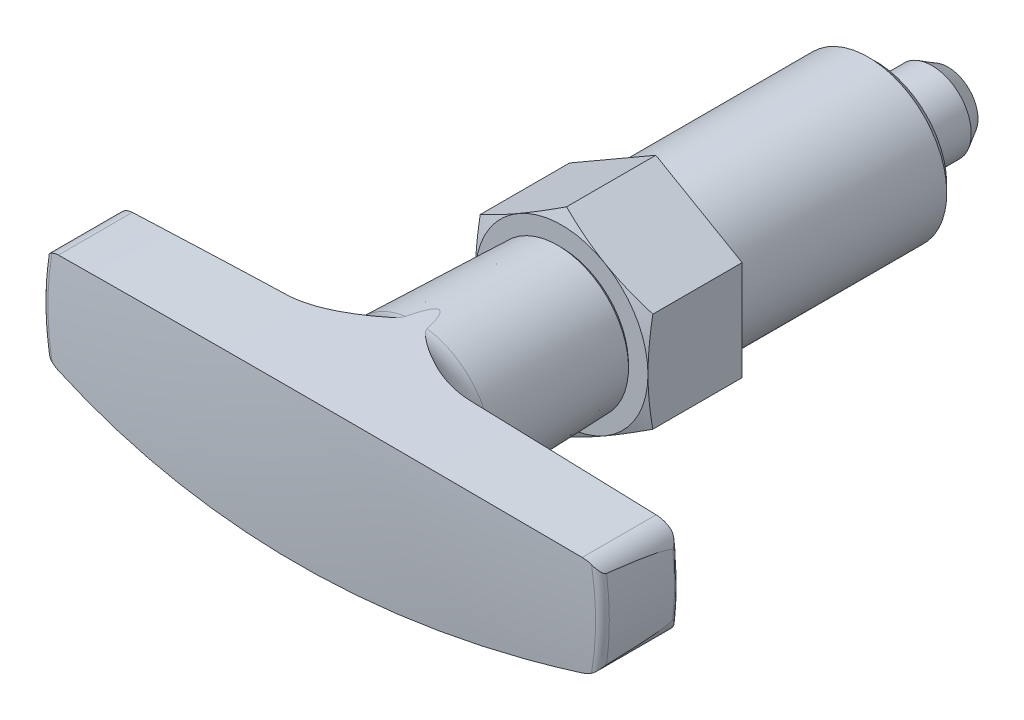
ISO-10303-21;
HEADER;
FILE_DESCRIPTION(('STEP AP214'),'2;1');
FILE_NAME('part.step','',(''),(''),'','','');
FILE_SCHEMA(('AUTOMOTIVE_DESIGN { 1 0 10303 214 1 1 1 1 }'));
ENDSEC;
DATA;
#1=APPLICATION_CONTEXT('core data for automotive mechanical design processes');
#2=APPLICATION_PROTOCOL_DEFINITION('international standard','automotive_design',2000,#1);
#3=PRODUCT_CONTEXT('',#1,'mechanical');
#4=PRODUCT('Part','Part','',(#3));
#5=PRODUCT_RELATED_PRODUCT_CATEGORY('part','',(#4));
#6=PRODUCT_DEFINITION_FORMATION('','',#4);
#7=PRODUCT_DEFINITION_CONTEXT('part definition',#1,'design');
#8=PRODUCT_DEFINITION('design','',#6,#7);
#9=PRODUCT_DEFINITION_SHAPE('','',#8);
#10=(LENGTH_UNIT() NAMED_UNIT(*) SI_UNIT(.MILLI.,.METRE.));
#11=(NAMED_UNIT(*) PLANE_ANGLE_UNIT() SI_UNIT($,.RADIAN.));
#12=(NAMED_UNIT(*) SI_UNIT($,.STERADIAN.) SOLID_ANGLE_UNIT());
#13=UNCERTAINTY_MEASURE_WITH_UNIT(LENGTH_MEASURE(1.E-05),#10,'distance_accuracy_value','');
#14=(GEOMETRIC_REPRESENTATION_CONTEXT(3) GLOBAL_UNCERTAINTY_ASSIGNED_CONTEXT((#13)) GLOBAL_UNIT_ASSIGNED_CONTEXT((#10,
#11,#12)) REPRESENTATION_CONTEXT('',''));
#15=CARTESIAN_POINT('',(0.,0.,0.));
#16=DIRECTION('',(0.,0.,1.));
#17=DIRECTION('',(1.,0.,0.));
#18=AXIS2_PLACEMENT_3D('',#15,#16,#17);
#19=CARTESIAN_POINT('',(0.,0.,-28.));
#20=DIRECTION('',(0.,0.,1.));
#21=DIRECTION('',(0.,-1.,0.));
#22=AXIS2_PLACEMENT_3D('',#19,#20,#21);
#23=CYLINDRICAL_SURFACE('',#22,10.);
#24=CARTESIAN_POINT('',(0.,0.,0.));
#25=DIRECTION('',(0.,0.,1.));
#26=DIRECTION('',(0.,-1.,0.));
#27=AXIS2_PLACEMENT_3D('',#24,#25,#26);
#28=CIRCLE('',#27,10.);
#29=CARTESIAN_POINT('',(0.,-10.,0.));
#30=VERTEX_POINT('',#29);
#31=EDGE_CURVE('E217',#30,#30,#28,.T.);
#32=ORIENTED_EDGE('',*,*,#31,.F.);
#33=EDGE_LOOP('',(#32));
#34=FACE_BOUND('',#33,.T.);
#35=CARTESIAN_POINT('',(0.,0.,-27.08));
#36=DIRECTION('',(0.,0.,1.));
#37=DIRECTION('',(0.,-1.,0.));
#38=AXIS2_PLACEMENT_3D('',#35,#36,#37);
#39=CIRCLE('',#38,10.);
#40=CARTESIAN_POINT('',(0.,-10.,-27.08));
#41=VERTEX_POINT('',#40);
#42=EDGE_CURVE('E221',#41,#41,#39,.T.);
#43=ORIENTED_EDGE('',*,*,#42,.T.);
#44=EDGE_LOOP('',(#43));
#45=FACE_BOUND('',#44,.T.);
#46=ADVANCED_FACE('F14',(#34,#45),#23,.T.);
#47=CARTESIAN_POINT('',(10.,0.,0.));
#48=DIRECTION('',(0.,0.,-1.));
#49=DIRECTION('',(0.,1.,0.));
#50=AXIS2_PLACEMENT_3D('',#47,#48,#49);
#51=PLANE('',#50);
#52=ORIENTED_EDGE('',*,*,#31,.T.);
#53=EDGE_LOOP('',(#52));
#54=FACE_BOUND('',#53,.T.);
#55=DIRECTION('',(-0.866025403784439,-0.5,0.));
#56=VECTOR('',#55,1.);
#57=CARTESIAN_POINT('',(0.,12.7017059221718,0.));
#58=LINE('',#57,#56);
#59=CARTESIAN_POINT('',(0.,12.7017059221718,0.));
#60=VERTEX_POINT('',#59);
#61=CARTESIAN_POINT('',(-11.,6.35085296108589,0.));
#62=VERTEX_POINT('',#61);
#63=EDGE_CURVE('E747',#60,#62,#58,.T.);
#64=ORIENTED_EDGE('',*,*,#63,.F.);
#65=DIRECTION('',(-0.866025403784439,0.5,0.));
#66=VECTOR('',#65,1.);
#67=CARTESIAN_POINT('',(11.,6.35085296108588,0.));
#68=LINE('',#67,#66);
#69=CARTESIAN_POINT('',(11.,6.35085296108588,0.));
#70=VERTEX_POINT('',#69);
#71=EDGE_CURVE('E751',#70,#60,#68,.T.);
#72=ORIENTED_EDGE('',*,*,#71,.F.);
#73=DIRECTION('',(0.,1.,0.));
#74=VECTOR('',#73,1.);
#75=CARTESIAN_POINT('',(11.,-6.35085296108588,0.));
#76=LINE('',#75,#74);
#77=CARTESIAN_POINT('',(11.,-6.35085296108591,0.));
#78=VERTEX_POINT('',#77);
#79=EDGE_CURVE('E220',#78,#70,#76,.T.);
#80=ORIENTED_EDGE('',*,*,#79,.F.);
#81=DIRECTION('',(0.866025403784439,0.5,0.));
#82=VECTOR('',#81,1.);
#83=CARTESIAN_POINT('',(0.,-12.7017059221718,0.));
#84=LINE('',#83,#82);
#85=CARTESIAN_POINT('',(0.,-12.7017059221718,0.));
#86=VERTEX_POINT('',#85);
#87=EDGE_CURVE('E736',#86,#78,#84,.T.);
#88=ORIENTED_EDGE('',*,*,#87,.F.);
#89=DIRECTION('',(0.866025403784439,-0.5,0.));
#90=VECTOR('',#89,1.);
#91=CARTESIAN_POINT('',(-11.,-6.35085296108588,0.));
#92=LINE('',#91,#90);
#93=CARTESIAN_POINT('',(-11.,-6.35085296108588,0.));
#94=VERTEX_POINT('',#93);
#95=EDGE_CURVE('E739',#94,#86,#92,.T.);
#96=ORIENTED_EDGE('',*,*,#95,.F.);
#97=DIRECTION('',(0.,-1.,0.));
#98=VECTOR('',#97,1.);
#99=CARTESIAN_POINT('',(-11.,6.35085296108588,0.));
#100=LINE('',#99,#98);
#101=EDGE_CURVE('E743',#62,#94,#100,.T.);
#102=ORIENTED_EDGE('',*,*,#101,.F.);
#103=EDGE_LOOP('',(#64,#72,#80,#88,#96,#102));
#104=FACE_BOUND('',#103,.T.);
#105=ADVANCED_FACE('F793',(#54,#104),#51,.T.);
#106=CARTESIAN_POINT('',(11.,-6.35085296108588,0.));
#107=DIRECTION('',(1.,0.,0.));
#108=DIRECTION('',(0.,1.,0.));
#109=AXIS2_PLACEMENT_3D('',#106,#107,#108);
#110=PLANE('',#109);
#111=CARTESIAN_POINT('',(11.,0.,12.));
#112=CARTESIAN_POINT('',(11.,0.2665956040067,12.0000223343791));
#113=CARTESIAN_POINT('',(11.,0.533186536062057,11.9964729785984));
#114=CARTESIAN_POINT('',(11.,1.06616776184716,11.9823955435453));
#115=CARTESIAN_POINT('',(11.,1.33255806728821,11.9718679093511));
#116=CARTESIAN_POINT('',(11.,1.86443302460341,11.9440272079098));
#117=CARTESIAN_POINT('',(11.,2.12991841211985,11.9267281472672));
#118=CARTESIAN_POINT('',(11.,2.66038186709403,11.8856513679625));
#119=CARTESIAN_POINT('',(11.,2.92535993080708,11.8618736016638));
#120=CARTESIAN_POINT('',(11.,3.71911571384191,11.781400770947));
#121=CARTESIAN_POINT('',(11.,4.24698880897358,11.7155511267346));
#122=CARTESIAN_POINT('',(11.,5.03701646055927,11.6010943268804));
#123=CARTESIAN_POINT('',(11.,5.30034808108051,11.5602752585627));
#124=CARTESIAN_POINT('',(11.,5.82619871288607,11.4738929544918));
#125=CARTESIAN_POINT('',(11.,6.08871782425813,11.4283303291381));
#126=CARTESIAN_POINT('',(11.,6.35085286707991,11.3806297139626));
#127=B_SPLINE_CURVE_WITH_KNOTS('',3,(#111,#112,#113,#114,#115,#116,#117,#118,#119,#120,#121,
#122,#123,#124,#125,#126),.UNSPECIFIED.,.F.,.F.,(4,2,2,2,2,2,2,4),(0.,0.799755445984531,
1.59945988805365,2.39751882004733,3.19558362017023,4.79089144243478,5.59029002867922,
6.38958587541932),.UNSPECIFIED.);
#128=CARTESIAN_POINT('',(11.,0.,12.));
#129=VERTEX_POINT('',#128);
#130=CARTESIAN_POINT('',(11.0000000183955,6.35085295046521,11.3806296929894));
#131=VERTEX_POINT('',#130);
#132=EDGE_CURVE('E1176',#129,#131,#127,.T.);
#133=ORIENTED_EDGE('',*,*,#132,.F.);
#134=CARTESIAN_POINT('',(10.9999999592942,-6.35085299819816,11.3806296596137));
#135=CARTESIAN_POINT('',(10.9999999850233,-6.08871795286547,11.4283302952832));
#136=CARTESIAN_POINT('',(10.9999999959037,-5.82619883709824,11.4738929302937));
#137=CARTESIAN_POINT('',(11.0000000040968,-5.30034819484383,11.5602752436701));
#138=CARTESIAN_POINT('',(11.0000000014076,-5.03701656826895,11.6010943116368));
#139=CARTESIAN_POINT('',(10.9999999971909,-4.24698889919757,11.7155511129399));
#140=CARTESIAN_POINT('',(10.9999999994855,-3.71911579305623,11.7814007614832));
#141=CARTESIAN_POINT('',(11.0000000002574,-2.92535999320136,11.8618735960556));
#142=CARTESIAN_POINT('',(11.0000000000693,-2.66038192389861,11.8856513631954));
#143=CARTESIAN_POINT('',(10.9999999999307,-2.12991845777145,11.9267281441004));
#144=CARTESIAN_POINT('',(10.9999999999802,-1.86443306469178,11.9440272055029));
#145=CARTESIAN_POINT('',(11.0000000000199,-1.33255809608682,11.9718679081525));
#146=CARTESIAN_POINT('',(11.0000000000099,-1.06616778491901,11.9823955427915));
#147=CARTESIAN_POINT('',(10.9999999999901,-0.53318654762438,11.9964729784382));
#148=CARTESIAN_POINT('',(10.9999999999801,-0.266595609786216,12.0000223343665));
#149=CARTESIAN_POINT('',(11.,0.,12.));
#150=B_SPLINE_CURVE_WITH_KNOTS('',3,(#134,#135,#136,#137,#138,#139,#140,#141,#142,#143,#144,
#145,#146,#147,#148,#149),.UNSPECIFIED.,.F.,.F.,(4,2,2,2,2,2,2,4),(0.,0.799295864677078,
1.59869446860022,3.19400232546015,3.99206714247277,4.7901260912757,5.58983055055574,
6.38958601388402),.UNSPECIFIED.);
#151=CARTESIAN_POINT('',(11.,-6.35085298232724,11.3806296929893));
#152=VERTEX_POINT('',#151);
#153=EDGE_CURVE('E143',#152,#129,#150,.T.);
#154=ORIENTED_EDGE('',*,*,#153,.F.);
#155=DIRECTION('',(0.,0.,1.));
#156=VECTOR('',#155,1.);
#157=CARTESIAN_POINT('',(11.,-6.35085296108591,0.));
#158=LINE('',#157,#156);
#159=EDGE_CURVE('E139',#78,#152,#158,.T.);
#160=ORIENTED_EDGE('',*,*,#159,.F.);
#161=ORIENTED_EDGE('',*,*,#79,.T.);
#162=DIRECTION('',(0.,0.,1.));
#163=VECTOR('',#162,1.);
#164=CARTESIAN_POINT('',(11.,6.35085296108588,0.));
#165=LINE('',#164,#163);
#166=EDGE_CURVE('E752',#131,#70,#165,.F.);
#167=ORIENTED_EDGE('',*,*,#166,.F.);
#168=EDGE_LOOP('',(#133,#154,#160,#161,#167));
#169=FACE_BOUND('',#168,.T.);
#170=ADVANCED_FACE('F801',(#169),#110,.T.);
#171=CARTESIAN_POINT('',(11.,6.35085296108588,0.));
#172=DIRECTION('',(0.5,0.866025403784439,0.));
#173=DIRECTION('',(-0.866025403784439,0.5,0.));
#174=AXIS2_PLACEMENT_3D('',#171,#172,#173);
#175=PLANE('',#174);
#176=CARTESIAN_POINT('',(5.5,9.52627944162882,12.));
#177=CARTESIAN_POINT('',(5.26912143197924,9.65957724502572,12.00002233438));
#178=CARTESIAN_POINT('',(5.03824690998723,9.79287271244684,11.9964729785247));
#179=CARTESIAN_POINT('',(4.57667162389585,10.059363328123,11.9823955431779));
#180=CARTESIAN_POINT('',(4.34597084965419,10.1925584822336,11.9718679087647));
#181=CARTESIAN_POINT('',(3.88535362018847,10.4584959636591,11.9440272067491));
#182=CARTESIAN_POINT('',(3.65543652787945,10.591238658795,11.9267281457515));
#183=CARTESIAN_POINT('',(3.19604169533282,10.8564703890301,11.8856513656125));
#184=CARTESIAN_POINT('',(2.96656395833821,10.988959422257,11.8618735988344));
#185=CARTESIAN_POINT('',(2.2791512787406,11.385837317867,11.7814007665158));
#186=CARTESIAN_POINT('',(1.82199976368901,11.6497738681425,11.7155511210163));
#187=CARTESIAN_POINT('',(1.13781574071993,12.0447876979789,11.6010943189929));
#188=CARTESIAN_POINT('',(0.909763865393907,12.1764535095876,11.5602752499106));
#189=CARTESIAN_POINT('',(0.454363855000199,12.4393788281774,11.4738929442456));
#190=CARTESIAN_POINT('',(0.227015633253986,12.5706383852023,11.4283303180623));
#191=CARTESIAN_POINT('',(2.46356676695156E-08,12.7017059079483,11.3806297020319));
#192=B_SPLINE_CURVE_WITH_KNOTS('',3,(#176,#177,#178,#179,#180,#181,#182,#183,#184,#185,#186,
#187,#188,#189,#190,#191),.UNSPECIFIED.,.F.,.F.,(4,2,2,2,2,2,2,4),(0.,0.799755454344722,
1.59945990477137,2.39751884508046,3.19558365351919,4.79089149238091,5.59029008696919,
6.3895859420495),.UNSPECIFIED.);
#193=CARTESIAN_POINT('',(5.5,9.52627944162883,12.));
#194=VERTEX_POINT('',#193);
#195=CARTESIAN_POINT('',(-1.11551231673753E-08,12.7017059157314,11.3806296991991));
#196=VERTEX_POINT('',#195);
#197=EDGE_CURVE('E1161',#194,#196,#192,.T.);
#198=ORIENTED_EDGE('',*,*,#197,.F.);
#199=CARTESIAN_POINT('',(11.0000000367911,6.35085293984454,11.3806296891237));
#200=CARTESIAN_POINT('',(10.7729844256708,6.48192046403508,11.4283303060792));
#201=CARTESIAN_POINT('',(10.5456362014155,6.61318002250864,11.4738929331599));
#202=CARTESIAN_POINT('',(10.0902361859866,6.8761053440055,11.5602752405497));
#203=CARTESIAN_POINT('',(9.8621843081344,7.00777115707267,11.6010943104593));
#204=CARTESIAN_POINT('',(9.17800027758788,7.40278499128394,11.7155511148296));
#205=CARTESIAN_POINT('',(8.7208487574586,7.66672154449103,11.7814007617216));
#206=CARTESIAN_POINT('',(8.03343607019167,8.06359944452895,11.8618735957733));
#207=CARTESIAN_POINT('',(7.80395833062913,8.19608847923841,11.88565136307));
#208=CARTESIAN_POINT('',(7.34456349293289,8.46132021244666,11.9267281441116));
#209=CARTESIAN_POINT('',(7.11464639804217,8.59406290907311,11.9440272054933));
#210=CARTESIAN_POINT('',(6.65402916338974,8.86000039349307,11.9718679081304));
#211=CARTESIAN_POINT('',(6.42332838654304,8.99319554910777,11.9823955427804));
#212=CARTESIAN_POINT('',(5.96175309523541,9.25968616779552,11.9964729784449));
#213=CARTESIAN_POINT('',(5.73087857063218,9.39298163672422,12.000022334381));
#214=CARTESIAN_POINT('',(5.5,9.52627944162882,12.));
#215=B_SPLINE_CURVE_WITH_KNOTS('',3,(#199,#200,#201,#202,#203,#204,#205,#206,#207,#208,#209,
#210,#211,#212,#213,#214),.UNSPECIFIED.,.F.,.F.,(4,2,2,2,2,2,2,4),(0.,0.799295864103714,
1.59869446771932,3.1940023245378,3.99206714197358,4.79012609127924,5.58983055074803,
6.38958601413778),.UNSPECIFIED.);
#216=EDGE_CURVE('E1171',#131,#194,#215,.T.);
#217=ORIENTED_EDGE('',*,*,#216,.F.);
#218=ORIENTED_EDGE('',*,*,#166,.T.);
#219=ORIENTED_EDGE('',*,*,#71,.T.);
#220=DIRECTION('',(0.,0.,1.));
#221=VECTOR('',#220,1.);
#222=CARTESIAN_POINT('',(0.,12.7017059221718,0.));
#223=LINE('',#222,#221);
#224=EDGE_CURVE('E748',#196,#60,#223,.F.);
#225=ORIENTED_EDGE('',*,*,#224,.F.);
#226=EDGE_LOOP('',(#198,#217,#218,#219,#225));
#227=FACE_BOUND('',#226,.T.);
#228=ADVANCED_FACE('F892',(#227),#175,.T.);
#229=CARTESIAN_POINT('',(0.,12.7017059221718,0.));
#230=DIRECTION('',(-0.5,0.866025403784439,0.));
#231=DIRECTION('',(-0.866025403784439,-0.5,0.));
#232=AXIS2_PLACEMENT_3D('',#229,#230,#231);
#233=PLANE('',#232);
#234=CARTESIAN_POINT('',(-5.5,9.52627944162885,12.));
#235=CARTESIAN_POINT('',(-5.73087856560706,9.3929816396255,12.0000223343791));
#236=CARTESIAN_POINT('',(-5.96175308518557,9.25968617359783,11.9964729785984));
#237=CARTESIAN_POINT('',(-6.42332836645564,8.99319556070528,11.9823955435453));
#238=CARTESIAN_POINT('',(-6.65402913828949,8.86000040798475,11.9718679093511));
#239=CARTESIAN_POINT('',(-7.11464636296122,8.59406292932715,11.9440272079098));
#240=CARTESIAN_POINT('',(-7.34456345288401,8.46132023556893,11.9267281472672));
#241=CARTESIAN_POINT('',(-7.80395828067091,8.19608850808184,11.8856513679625));
#242=CARTESIAN_POINT('',(-8.03343601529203,8.06359947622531,11.8618736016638));
#243=CARTESIAN_POINT('',(-8.72084868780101,7.6667215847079,11.781400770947));
#244=CARTESIAN_POINT('',(-9.17800019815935,7.40278503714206,11.7155511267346));
#245=CARTESIAN_POINT('',(-9.86218421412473,7.00777121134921,11.6010943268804));
#246=CARTESIAN_POINT('',(-10.0902360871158,6.87610540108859,11.5602752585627));
#247=CARTESIAN_POINT('',(-10.5456360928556,6.61318008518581,11.4738929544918));
#248=CARTESIAN_POINT('',(-10.7729843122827,6.48192052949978,11.4283303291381));
#249=CARTESIAN_POINT('',(-10.9999999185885,6.35085300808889,11.3806297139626));
#250=B_SPLINE_CURVE_WITH_KNOTS('',3,(#234,#235,#236,#237,#238,#239,#240,#241,#242,#243,#244,
#245,#246,#247,#248,#249),.UNSPECIFIED.,.F.,.F.,(4,2,2,2,2,2,2,4),(0.,0.799755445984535,
1.59945988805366,2.39751882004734,3.19558362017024,4.79089144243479,5.59029002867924,
6.38958587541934),.UNSPECIFIED.);
#251=CARTESIAN_POINT('',(-5.5,9.52627944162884,12.));
#252=VERTEX_POINT('',#251);
#253=CARTESIAN_POINT('',(-11.,6.35085298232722,11.3806296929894));
#254=VERTEX_POINT('',#253);
#255=EDGE_CURVE('E1148',#252,#254,#250,.T.);
#256=ORIENTED_EDGE('',*,*,#255,.F.);
#257=CARTESIAN_POINT('',(-1.44592529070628E-08,12.7017058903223,11.3806296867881));
#258=CARTESIAN_POINT('',(-0.227015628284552,12.5706383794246,11.4283303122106));
#259=CARTESIAN_POINT('',(-0.454363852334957,12.4393788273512,11.4738929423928));
#260=CARTESIAN_POINT('',(-0.909763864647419,12.1764535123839,11.5602752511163));
#261=CARTESIAN_POINT('',(-1.13781573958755,12.0447876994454,11.6010943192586));
#262=CARTESIAN_POINT('',(-1.82199976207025,11.6497738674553,11.7155511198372));
#263=CARTESIAN_POINT('',(-2.27915127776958,11.3858373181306,11.7814007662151));
#264=CARTESIAN_POINT('',(-2.96656395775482,10.9889594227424,11.8618735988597));
#265=CARTESIAN_POINT('',(-3.19604169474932,10.856470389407,11.8856513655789));
#266=CARTESIAN_POINT('',(-3.65543652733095,10.5912386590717,11.9267281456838));
#267=CARTESIAN_POINT('',(-3.88535361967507,10.4584959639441,11.9440272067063));
#268=CARTESIAN_POINT('',(-4.34597084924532,10.1925584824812,11.9718679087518));
#269=CARTESIAN_POINT('',(-4.57667162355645,10.0593633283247,11.9823955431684));
#270=CARTESIAN_POINT('',(-5.03824690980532,9.79287271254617,11.9964729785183));
#271=CARTESIAN_POINT('',(-5.26912143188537,9.65957724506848,12.0000223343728));
#272=CARTESIAN_POINT('',(-5.5,9.52627944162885,12.));
#273=B_SPLINE_CURVE_WITH_KNOTS('',3,(#257,#258,#259,#260,#261,#262,#263,#264,#265,#266,#267,
#268,#269,#270,#271,#272),.UNSPECIFIED.,.F.,.F.,(4,2,2,2,2,2,2,4),(0.,0.79929585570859,
1.59869445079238,3.19400229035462,3.99206709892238,4.79012603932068,5.58983048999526,
6.38958594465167),.UNSPECIFIED.);
#274=EDGE_CURVE('E1154',#196,#252,#273,.T.);
#275=ORIENTED_EDGE('',*,*,#274,.F.);
#276=ORIENTED_EDGE('',*,*,#224,.T.);
#277=ORIENTED_EDGE('',*,*,#63,.T.);
#278=DIRECTION('',(0.,0.,1.));
#279=VECTOR('',#278,1.);
#280=CARTESIAN_POINT('',(-11.,6.35085296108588,0.));
#281=LINE('',#280,#279);
#282=EDGE_CURVE('E744',#254,#62,#281,.F.);
#283=ORIENTED_EDGE('',*,*,#282,.F.);
#284=EDGE_LOOP('',(#256,#275,#276,#277,#283));
#285=FACE_BOUND('',#284,.T.);
#286=ADVANCED_FACE('F901',(#285),#233,.T.);
#287=CARTESIAN_POINT('',(-11.,6.35085296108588,0.));
#288=DIRECTION('',(-1.,0.,0.));
#289=DIRECTION('',(0.,-1.,0.));
#290=AXIS2_PLACEMENT_3D('',#287,#288,#289);
#291=PLANE('',#290);
#292=CARTESIAN_POINT('',(-11.,0.,12.));
#293=CARTESIAN_POINT('',(-11.,-0.2665956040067,12.0000223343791));
#294=CARTESIAN_POINT('',(-11.,-0.533186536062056,11.9964729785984));
#295=CARTESIAN_POINT('',(-11.,-1.06616776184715,11.9823955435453));
#296=CARTESIAN_POINT('',(-11.,-1.33255806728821,11.9718679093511));
#297=CARTESIAN_POINT('',(-11.,-1.8644330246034,11.9440272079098));
#298=CARTESIAN_POINT('',(-11.,-2.12991841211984,11.9267281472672));
#299=CARTESIAN_POINT('',(-11.,-2.66038186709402,11.8856513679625));
#300=CARTESIAN_POINT('',(-11.,-2.92535993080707,11.8618736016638));
#301=CARTESIAN_POINT('',(-11.,-3.7191157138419,11.781400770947));
#302=CARTESIAN_POINT('',(-11.,-4.24698880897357,11.7155511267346));
#303=CARTESIAN_POINT('',(-11.,-5.03701646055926,11.6010943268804));
#304=CARTESIAN_POINT('',(-11.,-5.30034808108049,11.5602752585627));
#305=CARTESIAN_POINT('',(-11.,-5.82619871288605,11.4738929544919));
#306=CARTESIAN_POINT('',(-11.,-6.08871782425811,11.4283303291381));
#307=CARTESIAN_POINT('',(-11.,-6.35085286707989,11.3806297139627));
#308=B_SPLINE_CURVE_WITH_KNOTS('',3,(#292,#293,#294,#295,#296,#297,#298,#299,#300,#301,#302,
#303,#304,#305,#306,#307),.UNSPECIFIED.,.F.,.F.,(4,2,2,2,2,2,2,4),(0.,0.799755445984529,
1.59945988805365,2.39751882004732,3.19558362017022,4.79089144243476,5.5902900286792,
6.38958587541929),.UNSPECIFIED.);
#309=CARTESIAN_POINT('',(-11.,0.,12.));
#310=VERTEX_POINT('',#309);
#311=CARTESIAN_POINT('',(-11.0000000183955,-6.35085295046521,11.3806296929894));
#312=VERTEX_POINT('',#311);
#313=EDGE_CURVE('E1131',#310,#312,#308,.T.);
#314=ORIENTED_EDGE('',*,*,#313,.F.);
#315=CARTESIAN_POINT('',(-11.,6.35085300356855,11.3806296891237));
#316=CARTESIAN_POINT('',(-11.,6.08871795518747,11.4283303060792));
#317=CARTESIAN_POINT('',(-11.,5.82619883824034,11.4738929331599));
#318=CARTESIAN_POINT('',(-11.,5.30034819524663,11.5602752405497));
#319=CARTESIAN_POINT('',(-11.,5.0370165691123,11.6010943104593));
#320=CARTESIAN_POINT('',(-11.,4.24698890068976,11.7155511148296));
#321=CARTESIAN_POINT('',(-11.,3.71911579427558,11.7814007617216));
#322=CARTESIAN_POINT('',(-11.,2.92535999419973,11.8618735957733));
#323=CARTESIAN_POINT('',(-11.,2.66038192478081,11.88565136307));
#324=CARTESIAN_POINT('',(-11.,2.12991845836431,11.9267281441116));
#325=CARTESIAN_POINT('',(-11.,1.86443306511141,11.9440272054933));
#326=CARTESIAN_POINT('',(-11.,1.33255809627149,11.9718679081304));
#327=CARTESIAN_POINT('',(-11.,1.06616778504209,11.9823955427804));
#328=CARTESIAN_POINT('',(-11.,0.533186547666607,11.9964729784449));
#329=CARTESIAN_POINT('',(-11.,0.266595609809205,12.000022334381));
#330=CARTESIAN_POINT('',(-11.,0.,12.));
#331=B_SPLINE_CURVE_WITH_KNOTS('',3,(#315,#316,#317,#318,#319,#320,#321,#322,#323,#324,#325,
#326,#327,#328,#329,#330),.UNSPECIFIED.,.F.,.F.,(4,2,2,2,2,2,2,4),(0.,0.799295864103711,
1.59869446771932,3.1940023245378,3.99206714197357,4.79012609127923,5.58983055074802,
6.38958601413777),.UNSPECIFIED.);
#332=EDGE_CURVE('E1137',#254,#310,#331,.T.);
#333=ORIENTED_EDGE('',*,*,#332,.F.);
#334=ORIENTED_EDGE('',*,*,#282,.T.);
#335=ORIENTED_EDGE('',*,*,#101,.T.);
#336=DIRECTION('',(0.,0.,1.));
#337=VECTOR('',#336,1.);
#338=CARTESIAN_POINT('',(-11.,-6.35085296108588,0.));
#339=LINE('',#338,#337);
#340=EDGE_CURVE('E740',#312,#94,#339,.F.);
#341=ORIENTED_EDGE('',*,*,#340,.F.);
#342=EDGE_LOOP('',(#314,#333,#334,#335,#341));
#343=FACE_BOUND('',#342,.T.);
#344=ADVANCED_FACE('F911',(#343),#291,.T.);
#345=CARTESIAN_POINT('',(-11.,-6.35085296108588,0.));
#346=DIRECTION('',(-0.5,-0.866025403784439,0.));
#347=DIRECTION('',(0.866025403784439,-0.5,0.));
#348=AXIS2_PLACEMENT_3D('',#345,#346,#347);
#349=PLANE('',#348);
#350=CARTESIAN_POINT('',(-5.5,-9.52627944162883,12.));
#351=CARTESIAN_POINT('',(-5.26912143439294,-9.65957724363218,12.0000223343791));
#352=CARTESIAN_POINT('',(-5.03824691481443,-9.79287270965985,11.9964729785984));
#353=CARTESIAN_POINT('',(-4.57667163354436,-10.0593633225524,11.9823955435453));
#354=CARTESIAN_POINT('',(-4.3459708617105,-10.1925584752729,11.9718679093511));
#355=CARTESIAN_POINT('',(-3.88535363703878,-10.4584959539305,11.9440272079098));
#356=CARTESIAN_POINT('',(-3.65543654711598,-10.5912386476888,11.9267281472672));
#357=CARTESIAN_POINT('',(-3.19604171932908,-10.8564703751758,11.8856513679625));
#358=CARTESIAN_POINT('',(-2.96656398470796,-10.9889594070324,11.8618736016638));
#359=CARTESIAN_POINT('',(-2.27915131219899,-11.3858372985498,11.781400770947));
#360=CARTESIAN_POINT('',(-1.82199980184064,-11.6497738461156,11.7155511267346));
#361=CARTESIAN_POINT('',(-1.13781578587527,-12.0447876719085,11.6010943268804));
#362=CARTESIAN_POINT('',(-0.909763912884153,-12.1764534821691,11.5602752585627));
#363=CARTESIAN_POINT('',(-0.454363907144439,-12.4393787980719,11.4738929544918));
#364=CARTESIAN_POINT('',(-0.22701568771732,-12.5706383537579,11.4283303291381));
#365=CARTESIAN_POINT('',(-8.14115356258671E-08,-12.7017058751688,11.3806297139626));
#366=B_SPLINE_CURVE_WITH_KNOTS('',3,(#350,#351,#352,#353,#354,#355,#356,#357,#358,#359,#360,
#361,#362,#363,#364,#365),.UNSPECIFIED.,.F.,.F.,(4,2,2,2,2,2,2,4),(0.,0.799755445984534,
1.59945988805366,2.39751882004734,3.19558362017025,4.7908914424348,5.59029002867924,
6.38958587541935),.UNSPECIFIED.);
#367=CARTESIAN_POINT('',(-5.5,-9.52627944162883,12.));
#368=VERTEX_POINT('',#367);
#369=CARTESIAN_POINT('',(-1.8395532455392E-08,-12.7017059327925,11.3806296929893));
#370=VERTEX_POINT('',#369);
#371=EDGE_CURVE('E159',#368,#370,#366,.T.);
#372=ORIENTED_EDGE('',*,*,#371,.F.);
#373=CARTESIAN_POINT('',(-11.0000000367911,-6.35085293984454,11.3806296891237));
#374=CARTESIAN_POINT('',(-10.7729844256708,-6.48192046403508,11.4283303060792));
#375=CARTESIAN_POINT('',(-10.5456362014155,-6.61318002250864,11.4738929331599));
#376=CARTESIAN_POINT('',(-10.0902361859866,-6.8761053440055,11.5602752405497));
#377=CARTESIAN_POINT('',(-9.8621843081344,-7.00777115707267,11.6010943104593));
#378=CARTESIAN_POINT('',(-9.17800027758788,-7.40278499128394,11.7155511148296));
#379=CARTESIAN_POINT('',(-8.7208487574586,-7.66672154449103,11.7814007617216));
#380=CARTESIAN_POINT('',(-8.03343607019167,-8.06359944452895,11.8618735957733));
#381=CARTESIAN_POINT('',(-7.80395833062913,-8.19608847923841,11.88565136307));
#382=CARTESIAN_POINT('',(-7.34456349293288,-8.46132021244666,11.9267281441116));
#383=CARTESIAN_POINT('',(-7.11464639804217,-8.59406290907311,11.9440272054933));
#384=CARTESIAN_POINT('',(-6.65402916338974,-8.86000039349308,11.9718679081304));
#385=CARTESIAN_POINT('',(-6.42332838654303,-8.99319554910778,11.9823955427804));
#386=CARTESIAN_POINT('',(-5.9617530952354,-9.25968616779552,11.9964729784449));
#387=CARTESIAN_POINT('',(-5.73087857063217,-9.39298163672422,12.000022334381));
#388=CARTESIAN_POINT('',(-5.5,-9.52627944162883,12.));
#389=B_SPLINE_CURVE_WITH_KNOTS('',3,(#373,#374,#375,#376,#377,#378,#379,#380,#381,#382,#383,
#384,#385,#386,#387,#388),.UNSPECIFIED.,.F.,.F.,(4,2,2,2,2,2,2,4),(0.,0.799295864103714,
1.59869446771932,3.19400232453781,3.99206714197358,4.79012609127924,5.58983055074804,
6.38958601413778),.UNSPECIFIED.);
#390=EDGE_CURVE('E1125',#312,#368,#389,.T.);
#391=ORIENTED_EDGE('',*,*,#390,.F.);
#392=ORIENTED_EDGE('',*,*,#340,.T.);
#393=ORIENTED_EDGE('',*,*,#95,.T.);
#394=DIRECTION('',(0.,0.,1.));
#395=VECTOR('',#394,1.);
#396=CARTESIAN_POINT('',(0.,-12.7017059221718,0.));
#397=LINE('',#396,#395);
#398=EDGE_CURVE('E737',#370,#86,#397,.F.);
#399=ORIENTED_EDGE('',*,*,#398,.F.);
#400=EDGE_LOOP('',(#372,#391,#392,#393,#399));
#401=FACE_BOUND('',#400,.T.);
#402=ADVANCED_FACE('F199',(#401),#349,.T.);
#403=CARTESIAN_POINT('',(0.,-12.7017059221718,0.));
#404=DIRECTION('',(0.5,-0.866025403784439,0.));
#405=DIRECTION('',(0.866025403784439,0.5,0.));
#406=AXIS2_PLACEMENT_3D('',#403,#404,#405);
#407=PLANE('',#406);
#408=CARTESIAN_POINT('',(5.5,-9.52627944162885,12.));
#409=CARTESIAN_POINT('',(5.73087856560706,-9.3929816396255,12.0000223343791));
#410=CARTESIAN_POINT('',(5.96175308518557,-9.25968617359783,11.9964729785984));
#411=CARTESIAN_POINT('',(6.42332836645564,-8.99319556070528,11.9823955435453));
#412=CARTESIAN_POINT('',(6.65402913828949,-8.86000040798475,11.9718679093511));
#413=CARTESIAN_POINT('',(7.11464636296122,-8.59406292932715,11.9440272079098));
#414=CARTESIAN_POINT('',(7.34456345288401,-8.46132023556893,11.9267281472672));
#415=CARTESIAN_POINT('',(7.80395828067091,-8.19608850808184,11.8856513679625));
#416=CARTESIAN_POINT('',(8.03343601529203,-8.06359947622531,11.8618736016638));
#417=CARTESIAN_POINT('',(8.72084868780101,-7.6667215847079,11.781400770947));
#418=CARTESIAN_POINT('',(9.17800019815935,-7.40278503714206,11.7155511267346));
#419=CARTESIAN_POINT('',(9.86218421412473,-7.00777121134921,11.6010943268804));
#420=CARTESIAN_POINT('',(10.0902360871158,-6.87610540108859,11.5602752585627));
#421=CARTESIAN_POINT('',(10.5456360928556,-6.61318008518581,11.4738929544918));
#422=CARTESIAN_POINT('',(10.7729843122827,-6.48192052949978,11.4283303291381));
#423=CARTESIAN_POINT('',(10.9999999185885,-6.35085300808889,11.3806297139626));
#424=B_SPLINE_CURVE_WITH_KNOTS('',3,(#408,#409,#410,#411,#412,#413,#414,#415,#416,#417,#418,
#419,#420,#421,#422,#423),.UNSPECIFIED.,.F.,.F.,(4,2,2,2,2,2,2,4),(0.,0.799755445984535,
1.59945988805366,2.39751882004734,3.19558362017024,4.79089144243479,5.59029002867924,
6.38958587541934),.UNSPECIFIED.);
#425=CARTESIAN_POINT('',(5.5,-9.52627944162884,12.));
#426=VERTEX_POINT('',#425);
#427=EDGE_CURVE('E130',#426,#152,#424,.T.);
#428=ORIENTED_EDGE('',*,*,#427,.F.);
#429=CARTESIAN_POINT('',(-5.24930534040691E-08,-12.7017059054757,11.3806296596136));
#430=CARTESIAN_POINT('',(0.227015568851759,-12.5706384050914,11.4283302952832));
#431=CARTESIAN_POINT('',(0.454363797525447,-12.4393788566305,11.4738929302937));
#432=CARTESIAN_POINT('',(0.909763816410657,-12.1764535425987,11.56027524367));
#433=CARTESIAN_POINT('',(1.1378156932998,-12.0447877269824,11.6010943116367));
#434=CARTESIAN_POINT('',(1.82199972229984,-11.6497738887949,11.7155511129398));
#435=CARTESIAN_POINT('',(2.27915124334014,-11.3858373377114,11.7814007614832));
#436=CARTESIAN_POINT('',(2.96656393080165,-10.9889594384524,11.8618735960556));
#437=CARTESIAN_POINT('',(3.19604167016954,-10.8564704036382,11.8856513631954));
#438=CARTESIAN_POINT('',(3.6554365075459,-10.5912386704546,11.9267281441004));
#439=CARTESIAN_POINT('',(3.88535360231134,-10.4584959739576,11.9440272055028));
#440=CARTESIAN_POINT('',(4.34597083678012,-10.1925584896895,11.9718679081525));
#441=CARTESIAN_POINT('',(4.57667161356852,-10.059363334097,11.9823955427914));
#442=CARTESIAN_POINT('',(5.0382469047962,-9.79287271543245,11.9964729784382));
#443=CARTESIAN_POINT('',(5.2691214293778,-9.65957724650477,12.0000223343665));
#444=CARTESIAN_POINT('',(5.5,-9.52627944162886,12.));
#445=B_SPLINE_CURVE_WITH_KNOTS('',3,(#429,#430,#431,#432,#433,#434,#435,#436,#437,#438,#439,
#440,#441,#442,#443,#444),.UNSPECIFIED.,.F.,.F.,(4,2,2,2,2,2,2,4),(0.,0.799295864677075,
1.59869446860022,3.19400232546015,3.99206714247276,4.7901260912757,5.58983055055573,
6.38958601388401),.UNSPECIFIED.);
#446=EDGE_CURVE('E135',#370,#426,#445,.T.);
#447=ORIENTED_EDGE('',*,*,#446,.F.);
#448=ORIENTED_EDGE('',*,*,#398,.T.);
#449=ORIENTED_EDGE('',*,*,#87,.T.);
#450=ORIENTED_EDGE('',*,*,#159,.T.);
#451=EDGE_LOOP('',(#428,#447,#448,#449,#450));
#452=FACE_BOUND('',#451,.T.);
#453=ADVANCED_FACE('F132',(#452),#407,.T.);
#454=CARTESIAN_POINT('',(0.,0.,11.3769134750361));
#455=DIRECTION('',(0.,0.,-1.));
#456=DIRECTION('',(0.,1.,0.));
#457=AXIS2_PLACEMENT_3D('',#454,#455,#456);
#458=CONICAL_SURFACE('',#457,12.7119161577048,1.22173047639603);
#459=ORIENTED_EDGE('',*,*,#153,.T.);
#460=CARTESIAN_POINT('',(0.,0.,12.));
#461=DIRECTION('',(0.,0.,-1.));
#462=DIRECTION('',(0.,1.,0.));
#463=AXIS2_PLACEMENT_3D('',#460,#461,#462);
#464=CIRCLE('',#463,11.);
#465=EDGE_CURVE('E146',#426,#129,#464,.F.);
#466=ORIENTED_EDGE('',*,*,#465,.F.);
#467=ORIENTED_EDGE('',*,*,#427,.T.);
#468=EDGE_LOOP('',(#459,#466,#467));
#469=FACE_BOUND('',#468,.T.);
#470=ADVANCED_FACE('F147',(#469),#458,.T.);
#471=CARTESIAN_POINT('',(0.,0.,11.3769134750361));
#472=DIRECTION('',(0.,0.,-1.));
#473=DIRECTION('',(0.,1.,0.));
#474=AXIS2_PLACEMENT_3D('',#471,#472,#473);
#475=CONICAL_SURFACE('',#474,12.7119161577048,1.22173047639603);
#476=ORIENTED_EDGE('',*,*,#216,.T.);
#477=CARTESIAN_POINT('',(0.,0.,12.));
#478=DIRECTION('',(0.,0.,-1.));
#479=DIRECTION('',(0.,1.,0.));
#480=AXIS2_PLACEMENT_3D('',#477,#478,#479);
#481=CIRCLE('',#480,11.);
#482=EDGE_CURVE('E152',#129,#194,#481,.F.);
#483=ORIENTED_EDGE('',*,*,#482,.F.);
#484=ORIENTED_EDGE('',*,*,#132,.T.);
#485=EDGE_LOOP('',(#476,#483,#484));
#486=FACE_BOUND('',#485,.T.);
#487=ADVANCED_FACE('F937',(#486),#475,.T.);
#488=CARTESIAN_POINT('',(0.,0.,11.3769134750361));
#489=DIRECTION('',(0.,0.,-1.));
#490=DIRECTION('',(0.,1.,0.));
#491=AXIS2_PLACEMENT_3D('',#488,#489,#490);
#492=CONICAL_SURFACE('',#491,12.7119161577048,1.22173047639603);
#493=ORIENTED_EDGE('',*,*,#197,.T.);
#494=ORIENTED_EDGE('',*,*,#274,.T.);
#495=CARTESIAN_POINT('',(0.,0.,12.));
#496=DIRECTION('',(0.,0.,-1.));
#497=DIRECTION('',(0.,1.,0.));
#498=AXIS2_PLACEMENT_3D('',#495,#496,#497);
#499=CIRCLE('',#498,11.);
#500=EDGE_CURVE('E177',#194,#252,#499,.F.);
#501=ORIENTED_EDGE('',*,*,#500,.F.);
#502=EDGE_LOOP('',(#493,#494,#501));
#503=FACE_BOUND('',#502,.T.);
#504=ADVANCED_FACE('F943',(#503),#492,.T.);
#505=CARTESIAN_POINT('',(0.,0.,11.3769134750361));
#506=DIRECTION('',(0.,0.,-1.));
#507=DIRECTION('',(0.,1.,0.));
#508=AXIS2_PLACEMENT_3D('',#505,#506,#507);
#509=CONICAL_SURFACE('',#508,12.7119161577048,1.22173047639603);
#510=ORIENTED_EDGE('',*,*,#255,.T.);
#511=ORIENTED_EDGE('',*,*,#332,.T.);
#512=CARTESIAN_POINT('',(0.,0.,12.));
#513=DIRECTION('',(0.,0.,-1.));
#514=DIRECTION('',(0.,1.,0.));
#515=AXIS2_PLACEMENT_3D('',#512,#513,#514);
#516=CIRCLE('',#515,11.);
#517=EDGE_CURVE('E171',#252,#310,#516,.F.);
#518=ORIENTED_EDGE('',*,*,#517,.F.);
#519=EDGE_LOOP('',(#510,#511,#518));
#520=FACE_BOUND('',#519,.T.);
#521=ADVANCED_FACE('F950',(#520),#509,.T.);
#522=CARTESIAN_POINT('',(0.,0.,11.3769134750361));
#523=DIRECTION('',(0.,0.,-1.));
#524=DIRECTION('',(0.,1.,0.));
#525=AXIS2_PLACEMENT_3D('',#522,#523,#524);
#526=CONICAL_SURFACE('',#525,12.7119161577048,1.22173047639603);
#527=ORIENTED_EDGE('',*,*,#313,.T.);
#528=ORIENTED_EDGE('',*,*,#390,.T.);
#529=CARTESIAN_POINT('',(0.,0.,12.));
#530=DIRECTION('',(0.,0.,-1.));
#531=DIRECTION('',(0.,1.,0.));
#532=AXIS2_PLACEMENT_3D('',#529,#530,#531);
#533=CIRCLE('',#532,11.);
#534=EDGE_CURVE('E165',#310,#368,#533,.F.);
#535=ORIENTED_EDGE('',*,*,#534,.F.);
#536=EDGE_LOOP('',(#527,#528,#535));
#537=FACE_BOUND('',#536,.T.);
#538=ADVANCED_FACE('F959',(#537),#526,.T.);
#539=CARTESIAN_POINT('',(0.,0.,11.3769134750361));
#540=DIRECTION('',(0.,0.,-1.));
#541=DIRECTION('',(0.,1.,0.));
#542=AXIS2_PLACEMENT_3D('',#539,#540,#541);
#543=CONICAL_SURFACE('',#542,12.7119161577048,1.22173047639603);
#544=ORIENTED_EDGE('',*,*,#446,.T.);
#545=CARTESIAN_POINT('',(0.,0.,12.));
#546=DIRECTION('',(0.,0.,-1.));
#547=DIRECTION('',(0.,1.,0.));
#548=AXIS2_PLACEMENT_3D('',#545,#546,#547);
#549=CIRCLE('',#548,11.);
#550=EDGE_CURVE('E157',#368,#426,#549,.F.);
#551=ORIENTED_EDGE('',*,*,#550,.F.);
#552=ORIENTED_EDGE('',*,*,#371,.T.);
#553=EDGE_LOOP('',(#544,#551,#552));
#554=FACE_BOUND('',#553,.T.);
#555=ADVANCED_FACE('F156',(#554),#543,.T.);
#556=CARTESIAN_POINT('',(11.,0.,12.));
#557=DIRECTION('',(0.,0.,1.));
#558=DIRECTION('',(0.,-1.,0.));
#559=AXIS2_PLACEMENT_3D('',#556,#557,#558);
#560=PLANE('',#559);
#561=ORIENTED_EDGE('',*,*,#534,.T.);
#562=ORIENTED_EDGE('',*,*,#550,.T.);
#563=ORIENTED_EDGE('',*,*,#465,.T.);
#564=ORIENTED_EDGE('',*,*,#482,.T.);
#565=ORIENTED_EDGE('',*,*,#500,.T.);
#566=ORIENTED_EDGE('',*,*,#517,.T.);
#567=EDGE_LOOP('',(#561,#562,#563,#564,#565,#566));
#568=FACE_BOUND('',#567,.T.);
#569=CARTESIAN_POINT('',(0.,0.,12.));
#570=DIRECTION('',(0.,0.,1.));
#571=DIRECTION('',(-1.,0.,0.));
#572=AXIS2_PLACEMENT_3D('',#569,#570,#571);
#573=CIRCLE('',#572,8.5);
#574=CARTESIAN_POINT('',(-8.5,0.,12.));
#575=VERTEX_POINT('',#574);
#576=EDGE_CURVE('E169',#575,#575,#573,.T.);
#577=ORIENTED_EDGE('',*,*,#576,.F.);
#578=EDGE_LOOP('',(#577));
#579=FACE_BOUND('',#578,.T.);
#580=ADVANCED_FACE('F161',(#568,#579),#560,.T.);
#581=CARTESIAN_POINT('',(0.,0.,33.5988367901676));
#582=DIRECTION('',(0.,0.,1.));
#583=DIRECTION('',(0.,-1.,0.));
#584=AXIS2_PLACEMENT_3D('',#581,#582,#583);
#585=TOROIDAL_SURFACE('',#584,35.5,0.499999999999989);
#586=CARTESIAN_POINT('',(0.,1.00613961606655E-13,33.1059663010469));
#587=DIRECTION('',(0.,0.,1.));
#588=DIRECTION('',(0.,-1.,0.));
#589=AXIS2_PLACEMENT_3D('',#586,#587,#588);
#590=CIRCLE('',#589,35.4158651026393);
#591=CARTESIAN_POINT('',(-34.9848525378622,5.50850196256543,33.1059663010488));
#592=VERTEX_POINT('',#591);
#593=CARTESIAN_POINT('',(-34.9848525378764,-5.50850196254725,33.1059663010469));
#594=VERTEX_POINT('',#593);
#595=EDGE_CURVE('E482',#592,#594,#590,.T.);
#596=ORIENTED_EDGE('',*,*,#595,.T.);
#597=CARTESIAN_POINT('',(-34.9848525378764,-5.50850196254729,33.1059663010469));
#598=CARTESIAN_POINT('',(-34.9962047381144,-5.49668239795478,33.1043668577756));
#599=CARTESIAN_POINT('',(-35.0074705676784,-5.48474302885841,33.103057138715));
#600=CARTESIAN_POINT('',(-35.0302578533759,-5.46017246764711,33.1009351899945));
#601=CARTESIAN_POINT('',(-35.0417719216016,-5.44753254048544,33.1001445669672));
#602=CARTESIAN_POINT('',(-35.0650250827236,-5.42155432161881,33.0990789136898));
#603=CARTESIAN_POINT('',(-35.0767559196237,-5.40820781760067,33.0988247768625));
#604=CARTESIAN_POINT('',(-35.1004105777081,-5.38080846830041,33.0988501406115));
#605=CARTESIAN_POINT('',(-35.1123253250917,-5.36674782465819,33.0991498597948));
#606=CARTESIAN_POINT('',(-35.1363135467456,-5.33791247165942,33.1002989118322));
#607=CARTESIAN_POINT('',(-35.1483771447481,-5.3231303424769,33.1011677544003));
#608=CARTESIAN_POINT('',(-35.1726268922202,-5.29284411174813,33.1034692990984));
#609=CARTESIAN_POINT('',(-35.1848023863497,-5.27733292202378,33.1049207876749));
#610=CARTESIAN_POINT('',(-35.2092378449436,-5.24558065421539,33.108399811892));
#611=CARTESIAN_POINT('',(-35.2214863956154,-5.22933278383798,33.1104453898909));
#612=CARTESIAN_POINT('',(-35.246028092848,-5.19609923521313,33.1151225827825));
#613=CARTESIAN_POINT('',(-35.2583090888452,-5.17910702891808,33.1177714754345));
#614=CARTESIAN_POINT('',(-35.2828741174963,-5.1443769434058,33.1236629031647));
#615=CARTESIAN_POINT('',(-35.2951452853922,-5.12663277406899,33.1269219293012));
#616=CARTESIAN_POINT('',(-35.3196475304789,-5.09039099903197,33.134038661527));
#617=CARTESIAN_POINT('',(-35.3318650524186,-5.07188731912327,33.1379120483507));
#618=CARTESIAN_POINT('',(-35.3562155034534,-5.03411891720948,33.1462598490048));
#619=CARTESIAN_POINT('',(-35.368334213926,-5.014848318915,33.1507491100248));
#620=CARTESIAN_POINT('',(-35.3924411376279,-4.97553868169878,33.160327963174));
#621=CARTESIAN_POINT('',(-35.4044144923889,-4.95549394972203,33.1654315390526));
#622=CARTESIAN_POINT('',(-35.428184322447,-4.9146289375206,33.1762358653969));
#623=CARTESIAN_POINT('',(-35.4399653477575,-4.89380313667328,33.1819497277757));
#624=CARTESIAN_POINT('',(-35.4633009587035,-4.85136913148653,33.1939659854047));
#625=CARTESIAN_POINT('',(-35.4748394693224,-4.8297555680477,33.2002805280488));
#626=CARTESIAN_POINT('',(-35.509521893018,-4.76282816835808,33.2203737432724));
#627=CARTESIAN_POINT('',(-35.5316953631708,-4.7172070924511,33.2348271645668));
#628=CARTESIAN_POINT('',(-35.5641289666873,-4.64574949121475,33.2582776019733));
#629=CARTESIAN_POINT('',(-35.5752899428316,-4.62016872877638,33.2668314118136));
#630=CARTESIAN_POINT('',(-35.598276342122,-4.56537516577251,33.2854512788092));
#631=CARTESIAN_POINT('',(-35.609991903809,-4.53613291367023,33.2955668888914));
#632=CARTESIAN_POINT('',(-35.6337960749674,-4.47397619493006,33.3174416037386));
#633=CARTESIAN_POINT('',(-35.6457659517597,-4.44103506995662,33.3292539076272));
#634=CARTESIAN_POINT('',(-35.6697276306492,-4.37142725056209,33.3546160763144));
#635=CARTESIAN_POINT('',(-35.6815883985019,-4.33473430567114,33.3682177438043));
#636=CARTESIAN_POINT('',(-35.7049332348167,-4.25757265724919,33.3972178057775));
#637=CARTESIAN_POINT('',(-35.7162730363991,-4.21707816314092,33.4126637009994));
#638=CARTESIAN_POINT('',(-35.7381279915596,-4.132263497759,33.4453550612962));
#639=CARTESIAN_POINT('',(-35.7484849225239,-4.08791774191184,33.4626399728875));
#640=CARTESIAN_POINT('',(-35.7678827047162,-3.99535525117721,33.4989403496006));
#641=CARTESIAN_POINT('',(-35.7767514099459,-3.94711327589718,33.5179834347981));
#642=CARTESIAN_POINT('',(-35.7926544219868,-3.84671977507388,33.5576406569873));
#643=CARTESIAN_POINT('',(-35.7995039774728,-3.79454356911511,33.5782665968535));
#644=CARTESIAN_POINT('',(-35.8049706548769,-3.74220207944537,33.5988367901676));
#645=B_SPLINE_CURVE_WITH_KNOTS('',3,(#597,#598,#599,#600,#601,#602,#603,#604,#605,#606,#607,
#608,#609,#610,#611,#612,#613,#614,#615,#616,#617,#618,#619,#620,#621,#622,#623,#624,#625,#626,
#627,#628,#629,#630,#631,#632,#633,#634,#635,#636,#637,#638,#639,#640,#641,#642,#643,#644),
.UNSPECIFIED.,.F.,.F.,(4,2,2,2,2,2,2,2,2,2,2,2,2,2,2,2,2,2,2,2,2,2,2,4),(0.,0.0493926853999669,
0.100729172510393,0.154030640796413,0.20931642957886,0.266604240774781,0.325910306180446,
0.387249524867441,0.450635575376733,0.516081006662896,0.583597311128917,0.653194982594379,
0.724883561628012,0.798671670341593,0.874567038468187,1.03268940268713,1.12025207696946,
1.2194911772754,1.33042491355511,1.45306745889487,1.58742788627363,1.73350872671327,
1.89130427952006,2.06079879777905),.UNSPECIFIED.);
#646=CARTESIAN_POINT('',(-35.8049706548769,-3.7422020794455,33.5988367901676));
#647=VERTEX_POINT('',#646);
#648=EDGE_CURVE('E555',#647,#594,#645,.F.);
#649=ORIENTED_EDGE('',*,*,#648,.F.);
#650=CARTESIAN_POINT('',(-35.7998187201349,-3.78807824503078,33.6168781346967));
#651=CARTESIAN_POINT('',(-35.8000480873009,-3.78616842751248,33.616126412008));
#652=CARTESIAN_POINT('',(-35.8002756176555,-3.78425838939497,33.6153746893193));
#653=CARTESIAN_POINT('',(-35.8007270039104,-3.78043787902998,33.6138712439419));
#654=CARTESIAN_POINT('',(-35.8009508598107,-3.77852740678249,33.6131195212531));
#655=CARTESIAN_POINT('',(-35.8013948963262,-3.77470603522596,33.6116160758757));
#656=CARTESIAN_POINT('',(-35.8016150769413,-3.77279513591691,33.610864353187));
#657=CARTESIAN_POINT('',(-35.8020517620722,-3.76897291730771,33.6093609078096));
#658=CARTESIAN_POINT('',(-35.8022682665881,-3.76706159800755,33.6086091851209));
#659=CARTESIAN_POINT('',(-35.8026975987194,-3.76323854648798,33.6071057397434));
#660=CARTESIAN_POINT('',(-35.8029104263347,-3.76132681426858,33.6063540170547));
#661=CARTESIAN_POINT('',(-35.8033324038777,-3.757502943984,33.6048505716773));
#662=CARTESIAN_POINT('',(-35.8035415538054,-3.75559080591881,33.6040988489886));
#663=CARTESIAN_POINT('',(-35.8039561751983,-3.7517661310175,33.6025954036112));
#664=CARTESIAN_POINT('',(-35.8041616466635,-3.74985359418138,33.6018436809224));
#665=CARTESIAN_POINT('',(-35.8045689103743,-3.74602812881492,33.600340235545));
#666=CARTESIAN_POINT('',(-35.8047707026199,-3.74411520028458,33.5995885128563));
#667=CARTESIAN_POINT('',(-35.8049706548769,-3.74220207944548,33.5988367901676));
#668=B_SPLINE_CURVE_WITH_KNOTS('',3,(#650,#651,#652,#653,#654,#655,#656,#657,#658,#659,#660,
#661,#662,#663,#664,#665,#666,#667),.UNSPECIFIED.,.F.,.F.,(4,2,2,2,2,2,2,2,4),(0.,
0.00619563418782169,0.0123912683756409,0.0185869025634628,0.0247825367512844,0.0309781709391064,
0.0371738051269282,0.0433694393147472,0.0495650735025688),.UNSPECIFIED.);
#669=CARTESIAN_POINT('',(-35.7998187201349,-3.78807824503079,33.6168781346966));
#670=VERTEX_POINT('',#669);
#671=EDGE_CURVE('E503',#670,#647,#668,.T.);
#672=ORIENTED_EDGE('',*,*,#671,.F.);
#673=CARTESIAN_POINT('',(0.,0.,33.6168781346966));
#674=DIRECTION('',(0.,0.,-1.));
#675=DIRECTION('',(0.,1.,0.));
#676=AXIS2_PLACEMENT_3D('',#673,#674,#675);
#677=CIRCLE('',#676,35.9996744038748);
#678=CARTESIAN_POINT('',(-35.7998187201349,3.78807824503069,33.6168781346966));
#679=VERTEX_POINT('',#678);
#680=EDGE_CURVE('E718',#679,#670,#677,.F.);
#681=ORIENTED_EDGE('',*,*,#680,.F.);
#682=CARTESIAN_POINT('',(-35.7998187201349,3.78807824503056,33.6168781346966));
#683=CARTESIAN_POINT('',(-35.8000480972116,3.78616831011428,33.6161267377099));
#684=CARTESIAN_POINT('',(-35.8002756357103,3.78425817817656,33.615375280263));
#685=CARTESIAN_POINT('',(-35.8007270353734,3.78043751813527,33.613872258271));
#686=CARTESIAN_POINT('',(-35.8009508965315,3.77852699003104,33.6131206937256));
#687=CARTESIAN_POINT('',(-35.8013949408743,3.77470553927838,33.6116174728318));
#688=CARTESIAN_POINT('',(-35.8016151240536,3.77279461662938,33.6108658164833));
#689=CARTESIAN_POINT('',(-35.8020518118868,3.76897237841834,33.609362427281));
#690=CARTESIAN_POINT('',(-35.8022683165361,3.76706106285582,33.6086106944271));
#691=CARTESIAN_POINT('',(-35.802697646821,3.76323804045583,33.6071071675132));
#692=CARTESIAN_POINT('',(-35.802910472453,3.76132633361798,33.6063553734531));
#693=CARTESIAN_POINT('',(-35.803332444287,3.75750253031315,33.6048517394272));
#694=CARTESIAN_POINT('',(-35.8035415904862,3.75559043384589,33.6040998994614));
#695=CARTESIAN_POINT('',(-35.8039562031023,3.75176585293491,33.6025961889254));
#696=CARTESIAN_POINT('',(-35.8041616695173,3.74985336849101,33.6018443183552));
#697=CARTESIAN_POINT('',(-35.8045689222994,3.74602801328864,33.6003405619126));
#698=CARTESIAN_POINT('',(-35.8047707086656,3.74411514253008,33.5995886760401));
#699=CARTESIAN_POINT('',(-35.8049706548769,3.74220207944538,33.5988367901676));
#700=B_SPLINE_CURVE_WITH_KNOTS('',3,(#682,#683,#684,#685,#686,#687,#688,#689,#690,#691,#692,
#693,#694,#695,#696,#697,#698,#699),.UNSPECIFIED.,.F.,.F.,(4,2,2,2,2,2,2,2,4),(0.,
0.00619560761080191,0.0123912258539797,0.0185868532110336,0.0247824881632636,0.0309781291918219,
0.0371737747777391,0.0433694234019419,0.0495650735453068),.UNSPECIFIED.);
#701=CARTESIAN_POINT('',(-35.8049706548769,3.74220207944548,33.5988367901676));
#702=VERTEX_POINT('',#701);
#703=EDGE_CURVE('E166',#679,#702,#700,.T.);
#704=ORIENTED_EDGE('',*,*,#703,.T.);
#705=CARTESIAN_POINT('',(-35.8049706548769,3.74220207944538,33.5988367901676));
#706=CARTESIAN_POINT('',(-35.7994987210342,3.79459401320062,33.578246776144));
#707=CARTESIAN_POINT('',(-35.7926412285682,3.84682031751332,33.5576008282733));
#708=CARTESIAN_POINT('',(-35.7767175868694,3.94731034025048,33.5179052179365));
#709=CARTESIAN_POINT('',(-35.7678365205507,3.99559878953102,33.4988437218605));
#710=CARTESIAN_POINT('',(-35.7484102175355,4.08825059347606,33.4625087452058));
#711=CARTESIAN_POINT('',(-35.7380374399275,4.13263924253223,33.4452075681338));
#712=CARTESIAN_POINT('',(-35.7161479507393,4.21753613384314,33.412486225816));
#713=CARTESIAN_POINT('',(-35.7047897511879,4.25807001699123,33.3970265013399));
#714=CARTESIAN_POINT('',(-35.6814061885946,4.33530695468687,33.3680014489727));
#715=CARTESIAN_POINT('',(-35.6695253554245,4.37203585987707,33.3543884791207));
#716=CARTESIAN_POINT('',(-35.6455223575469,4.44171226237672,33.3290062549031));
#717=CARTESIAN_POINT('',(-35.6335314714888,4.47468606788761,33.3171850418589));
#718=CARTESIAN_POINT('',(-35.6096849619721,4.536904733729,33.2952949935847));
#719=CARTESIAN_POINT('',(-35.5979482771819,4.56617633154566,33.2851727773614));
#720=CARTESIAN_POINT('',(-35.5749193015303,4.62102581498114,33.2665414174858));
#721=CARTESIAN_POINT('',(-35.563737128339,4.64663317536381,33.2579825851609));
#722=CARTESIAN_POINT('',(-35.5312917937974,4.71805602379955,33.2345566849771));
#723=CARTESIAN_POINT('',(-35.5091332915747,4.76361513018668,33.2201328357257));
#724=CARTESIAN_POINT('',(-35.4635384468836,4.85153600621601,33.1937493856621));
#725=CARTESIAN_POINT('',(-35.4402336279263,4.89393855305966,33.1816992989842));
#726=CARTESIAN_POINT('',(-35.4040925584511,4.95604466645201,33.165292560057));
#727=CARTESIAN_POINT('',(-35.392127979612,4.97606474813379,33.1601984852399));
#728=CARTESIAN_POINT('',(-35.3680392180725,5.01532745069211,33.1506378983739));
#729=CARTESIAN_POINT('',(-35.3559298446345,5.03457572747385,33.1461574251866));
#730=CARTESIAN_POINT('',(-35.3315984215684,5.07230080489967,33.1378259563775));
#731=CARTESIAN_POINT('',(-35.3193905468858,5.09078347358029,33.1339601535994));
#732=CARTESIAN_POINT('',(-35.2949078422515,5.12698478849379,33.1268574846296));
#733=CARTESIAN_POINT('',(-35.2826465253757,5.14470949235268,33.1236049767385));
#734=CARTESIAN_POINT('',(-35.2581013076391,5.17940212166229,33.1177254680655));
#735=CARTESIAN_POINT('',(-35.2458302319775,5.19637632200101,33.1150820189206));
#736=CARTESIAN_POINT('',(-35.2213083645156,5.22957533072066,33.1104146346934));
#737=CARTESIAN_POINT('',(-35.2090696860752,5.2458066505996,33.1083734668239));
#738=CARTESIAN_POINT('',(-35.1846538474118,5.27752726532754,33.1049022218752));
#739=CARTESIAN_POINT('',(-35.1724880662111,5.29302333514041,33.1034541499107));
#740=CARTESIAN_POINT('',(-35.1482575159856,5.32328075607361,33.1011584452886));
#741=CARTESIAN_POINT('',(-35.1362033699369,5.33804917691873,33.1002920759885));
#742=CARTESIAN_POINT('',(-35.1122337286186,5.36685852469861,33.0991470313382));
#743=CARTESIAN_POINT('',(-35.1003280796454,5.38090685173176,33.0988488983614));
#744=CARTESIAN_POINT('',(-35.0766912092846,5.40828296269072,33.0988258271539));
#745=CARTESIAN_POINT('',(-35.0649690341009,5.42161852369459,33.0990807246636));
#746=CARTESIAN_POINT('',(-35.0417327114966,5.44757623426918,33.1001470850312));
#747=CARTESIAN_POINT('',(-35.0302267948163,5.46020657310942,33.100937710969));
#748=CARTESIAN_POINT('',(-35.0074552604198,5.48475932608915,33.1030589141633));
#749=CARTESIAN_POINT('',(-34.9961970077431,5.49669044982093,33.104367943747));
#750=CARTESIAN_POINT('',(-34.9848525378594,5.50850196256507,33.1059663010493));
#751=B_SPLINE_CURVE_WITH_KNOTS('',3,(#705,#706,#707,#708,#709,#710,#711,#712,#713,#714,#715,
#716,#717,#718,#719,#720,#721,#722,#723,#724,#725,#726,#727,#728,#729,#730,#731,#732,#733,#734,
#735,#736,#737,#738,#739,#740,#741,#742,#743,#744,#745,#746,#747,#748,#749,#750),.UNSPECIFIED.,
.F.,.F.,(4,2,2,2,2,2,2,2,2,2,2,2,2,2,2,2,2,2,2,2,2,2,4),(0.,0.169657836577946,0.327607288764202,
0.473832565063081,0.608327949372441,0.731095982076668,0.842145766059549,0.941491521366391,
1.02915151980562,1.18708349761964,1.3365775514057,1.40818615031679,1.47770817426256,
1.54515314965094,1.61053155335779,1.6738548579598,1.73513558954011,1.79438740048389,
1.85162516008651,1.90686506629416,1.96012478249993,2.01142360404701,2.06078265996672),.UNSPECIFIED.);
#752=EDGE_CURVE('E522',#592,#702,#751,.F.);
#753=ORIENTED_EDGE('',*,*,#752,.F.);
#754=EDGE_LOOP('',(#596,#649,#672,#681,#704,#753));
#755=FACE_BOUND('',#754,.T.);
#756=ADVANCED_FACE('F578',(#755),#585,.T.);
#757=CARTESIAN_POINT('',(0.,0.,33.5988367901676));
#758=DIRECTION('',(0.,0.,1.));
#759=DIRECTION('',(0.,-1.,0.));
#760=AXIS2_PLACEMENT_3D('',#757,#758,#759);
#761=TOROIDAL_SURFACE('',#760,35.5,0.499999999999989);
#762=CARTESIAN_POINT('',(0.,1.21430643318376E-13,33.1059663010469));
#763=DIRECTION('',(0.,0.,1.));
#764=DIRECTION('',(-1.,0.,0.));
#765=AXIS2_PLACEMENT_3D('',#762,#763,#764);
#766=CIRCLE('',#765,35.4158651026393);
#767=CARTESIAN_POINT('',(34.9848525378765,-5.5085019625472,33.1059663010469));
#768=VERTEX_POINT('',#767);
#769=CARTESIAN_POINT('',(34.9848525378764,5.50850196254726,33.1059663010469));
#770=VERTEX_POINT('',#769);
#771=EDGE_CURVE('E602',#768,#770,#766,.T.);
#772=ORIENTED_EDGE('',*,*,#771,.T.);
#773=CARTESIAN_POINT('',(34.9848525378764,5.50850196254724,33.1059663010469));
#774=CARTESIAN_POINT('',(34.9962047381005,5.49668239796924,33.1043668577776));
#775=CARTESIAN_POINT('',(35.0074705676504,5.48474302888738,33.1030571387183));
#776=CARTESIAN_POINT('',(35.0302578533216,5.46017246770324,33.1009351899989));
#777=CARTESIAN_POINT('',(35.041771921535,5.44753254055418,33.1001445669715));
#778=CARTESIAN_POINT('',(35.0650250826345,5.42155432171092,33.0990789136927));
#779=CARTESIAN_POINT('',(35.0767559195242,5.4082078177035,33.0988247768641));
#780=CARTESIAN_POINT('',(35.1004105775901,5.38080846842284,33.0988501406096));
#781=CARTESIAN_POINT('',(35.1123253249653,5.36674782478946,33.0991498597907));
#782=CARTESIAN_POINT('',(35.1363135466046,5.33791247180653,33.100298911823));
#783=CARTESIAN_POINT('',(35.1483771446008,5.32313034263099,33.1011677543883));
#784=CARTESIAN_POINT('',(35.1726268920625,5.29284411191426,33.1034692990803));
#785=CARTESIAN_POINT('',(35.1848023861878,5.27733292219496,33.1049207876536));
#786=CARTESIAN_POINT('',(35.2092378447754,5.24558065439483,33.1083998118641));
#787=CARTESIAN_POINT('',(35.2214863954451,5.22933278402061,33.1104453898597));
#788=CARTESIAN_POINT('',(35.2460280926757,5.1960992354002,33.1151225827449));
#789=CARTESIAN_POINT('',(35.2583090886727,5.17910702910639,33.1177714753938));
#790=CARTESIAN_POINT('',(35.2828741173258,5.14437694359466,33.1236629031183));
#791=CARTESIAN_POINT('',(35.2951452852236,5.12663277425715,33.1269219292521));
#792=CARTESIAN_POINT('',(35.3196475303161,5.09039099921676,33.1340386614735));
#793=CARTESIAN_POINT('',(35.3318650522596,5.07188731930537,33.1379120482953));
#794=CARTESIAN_POINT('',(35.3562155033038,5.03411891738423,33.1462598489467));
#795=CARTESIAN_POINT('',(35.368334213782,5.01484831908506,33.1507491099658));
#796=CARTESIAN_POINT('',(35.3924411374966,4.97553868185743,33.1603279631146));
#797=CARTESIAN_POINT('',(35.4044144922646,4.95549394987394,33.1654315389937));
#798=CARTESIAN_POINT('',(35.4281843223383,4.91462893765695,33.1762358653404));
#799=CARTESIAN_POINT('',(35.4399653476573,4.89380313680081,33.1819497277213));
#800=CARTESIAN_POINT('',(35.4633009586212,4.8513691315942,33.1939659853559));
#801=CARTESIAN_POINT('',(35.4748394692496,4.82975556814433,33.2002805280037));
#802=CARTESIAN_POINT('',(35.5095218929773,4.76282816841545,33.2203737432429));
#803=CARTESIAN_POINT('',(35.5316953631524,4.71720709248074,33.2348271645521));
#804=CARTESIAN_POINT('',(35.5641289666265,4.64574949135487,33.2582776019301));
#805=CARTESIAN_POINT('',(35.5752899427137,4.62016872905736,33.2668314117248));
#806=CARTESIAN_POINT('',(35.5982763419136,4.56537516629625,33.2854512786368));
#807=CARTESIAN_POINT('',(35.6099919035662,4.53613291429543,33.2955668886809));
#808=CARTESIAN_POINT('',(35.6337960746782,4.47397619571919,33.3174416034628));
#809=CARTESIAN_POINT('',(35.6457659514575,4.44103507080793,33.3292539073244));
#810=CARTESIAN_POINT('',(35.6697276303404,4.37142725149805,33.3546160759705));
#811=CARTESIAN_POINT('',(35.6815883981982,4.33473430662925,33.3682177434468));
#812=CARTESIAN_POINT('',(35.7049332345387,4.25757265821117,33.3972178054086));
#813=CARTESIAN_POINT('',(35.7162730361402,4.21707816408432,33.4126637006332));
#814=CARTESIAN_POINT('',(35.7381279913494,4.13226349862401,33.4453550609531));
#815=CARTESIAN_POINT('',(35.7484849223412,4.08791774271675,33.4626399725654));
#816=CARTESIAN_POINT('',(35.7678827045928,3.99535525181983,33.4989403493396));
#817=CARTESIAN_POINT('',(35.7767514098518,3.9471132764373,33.5179834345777));
#818=CARTESIAN_POINT('',(35.7926544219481,3.84671977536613,33.5576406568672));
#819=CARTESIAN_POINT('',(35.7995039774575,3.79454356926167,33.5782665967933));
#820=CARTESIAN_POINT('',(35.8049706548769,3.74220207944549,33.5988367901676));
#821=B_SPLINE_CURVE_WITH_KNOTS('',3,(#773,#774,#775,#776,#777,#778,#779,#780,#781,#782,#783,
#784,#785,#786,#787,#788,#789,#790,#791,#792,#793,#794,#795,#796,#797,#798,#799,#800,#801,#802,
#803,#804,#805,#806,#807,#808,#809,#810,#811,#812,#813,#814,#815,#816,#817,#818,#819,#820),
.UNSPECIFIED.,.F.,.F.,(4,2,2,2,2,2,2,2,2,2,2,2,2,2,2,2,2,2,2,2,2,2,2,4),(0.,0.0493926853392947,
0.100729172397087,0.154030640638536,0.209316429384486,0.266604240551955,0.325910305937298,
0.387249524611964,0.450635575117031,0.516081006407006,0.583597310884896,0.653194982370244,
0.72488356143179,0.798671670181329,0.874567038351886,1.03268940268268,1.1202520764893,
1.21949117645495,1.33042491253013,1.45306745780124,1.5874278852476,1.73350872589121,
1.8913042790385,2.06079879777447),.UNSPECIFIED.);
#822=CARTESIAN_POINT('',(35.8049706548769,3.74220207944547,33.5988367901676));
#823=VERTEX_POINT('',#822);
#824=EDGE_CURVE('E598',#823,#770,#821,.F.);
#825=ORIENTED_EDGE('',*,*,#824,.F.);
#826=CARTESIAN_POINT('',(35.7998187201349,3.78807824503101,33.6168781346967));
#827=CARTESIAN_POINT('',(35.8000480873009,3.7861684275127,33.616126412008));
#828=CARTESIAN_POINT('',(35.8002756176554,3.78425838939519,33.6153746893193));
#829=CARTESIAN_POINT('',(35.8007270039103,3.78043787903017,33.6138712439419));
#830=CARTESIAN_POINT('',(35.8009508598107,3.77852740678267,33.6131195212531));
#831=CARTESIAN_POINT('',(35.8013948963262,3.77470603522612,33.6116160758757));
#832=CARTESIAN_POINT('',(35.8016150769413,3.77279513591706,33.610864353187));
#833=CARTESIAN_POINT('',(35.8020517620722,3.76897291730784,33.6093609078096));
#834=CARTESIAN_POINT('',(35.8022682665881,3.76706159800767,33.6086091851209));
#835=CARTESIAN_POINT('',(35.8026975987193,3.76323854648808,33.6071057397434));
#836=CARTESIAN_POINT('',(35.8029104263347,3.76132681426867,33.6063540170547));
#837=CARTESIAN_POINT('',(35.8033324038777,3.75750294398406,33.6048505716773));
#838=CARTESIAN_POINT('',(35.8035415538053,3.75559080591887,33.6040988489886));
#839=CARTESIAN_POINT('',(35.8039561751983,3.75176613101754,33.6025954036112));
#840=CARTESIAN_POINT('',(35.8041616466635,3.74985359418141,33.6018436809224));
#841=CARTESIAN_POINT('',(35.8045689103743,3.74602812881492,33.600340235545));
#842=CARTESIAN_POINT('',(35.8047707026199,3.74411520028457,33.5995885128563));
#843=CARTESIAN_POINT('',(35.8049706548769,3.74220207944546,33.5988367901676));
#844=B_SPLINE_CURVE_WITH_KNOTS('',3,(#826,#827,#828,#829,#830,#831,#832,#833,#834,#835,#836,
#837,#838,#839,#840,#841,#842,#843),.UNSPECIFIED.,.F.,.F.,(4,2,2,2,2,2,2,2,4),(0.,
0.00619563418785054,0.0123912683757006,0.018586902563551,0.0247825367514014,0.0309781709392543,
0.0371738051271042,0.0433694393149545,0.0495650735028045),.UNSPECIFIED.);
#845=CARTESIAN_POINT('',(35.7998187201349,3.78807824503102,33.6168781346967));
#846=VERTEX_POINT('',#845);
#847=EDGE_CURVE('E600',#846,#823,#844,.T.);
#848=ORIENTED_EDGE('',*,*,#847,.F.);
#849=CARTESIAN_POINT('',(0.,0.,33.6168781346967));
#850=DIRECTION('',(0.,0.,-1.));
#851=DIRECTION('',(0.,1.,0.));
#852=AXIS2_PLACEMENT_3D('',#849,#850,#851);
#853=CIRCLE('',#852,35.9996744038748);
#854=CARTESIAN_POINT('',(35.799818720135,-3.78807824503,33.6168781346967));
#855=VERTEX_POINT('',#854);
#856=EDGE_CURVE('E483',#855,#846,#853,.F.);
#857=ORIENTED_EDGE('',*,*,#856,.F.);
#858=CARTESIAN_POINT('',(35.8049706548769,-3.74220207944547,33.5988367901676));
#859=CARTESIAN_POINT('',(35.8047707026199,-3.74411520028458,33.5995885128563));
#860=CARTESIAN_POINT('',(35.8045689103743,-3.74602812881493,33.600340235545));
#861=CARTESIAN_POINT('',(35.8041616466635,-3.74985359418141,33.6018436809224));
#862=CARTESIAN_POINT('',(35.8039561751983,-3.75176613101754,33.6025954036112));
#863=CARTESIAN_POINT('',(35.8035415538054,-3.75559080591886,33.6040988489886));
#864=CARTESIAN_POINT('',(35.8033324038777,-3.75750294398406,33.6048505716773));
#865=CARTESIAN_POINT('',(35.8029104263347,-3.76132681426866,33.6063540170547));
#866=CARTESIAN_POINT('',(35.8026975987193,-3.76323854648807,33.6071057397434));
#867=CARTESIAN_POINT('',(35.8022682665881,-3.76706159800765,33.6086091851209));
#868=CARTESIAN_POINT('',(35.8020517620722,-3.76897291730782,33.6093609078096));
#869=CARTESIAN_POINT('',(35.8016150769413,-3.77279513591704,33.610864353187));
#870=CARTESIAN_POINT('',(35.8013948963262,-3.7747060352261,33.6116160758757));
#871=CARTESIAN_POINT('',(35.8009508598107,-3.77852740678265,33.6131195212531));
#872=CARTESIAN_POINT('',(35.8007270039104,-3.78043787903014,33.6138712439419));
#873=CARTESIAN_POINT('',(35.8002756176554,-3.78425838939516,33.6153746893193));
#874=CARTESIAN_POINT('',(35.8000480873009,-3.78616842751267,33.616126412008));
#875=CARTESIAN_POINT('',(35.7998187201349,-3.78807824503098,33.6168781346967));
#876=B_SPLINE_CURVE_WITH_KNOTS('',3,(#858,#859,#860,#861,#862,#863,#864,#865,#866,#867,#868,
#869,#870,#871,#872,#873,#874,#875),.UNSPECIFIED.,.F.,.F.,(4,2,2,2,2,2,2,2,4),(0.,
0.00619563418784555,0.0123912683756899,0.0185869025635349,0.0247825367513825,0.0309781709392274,
0.0371738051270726,0.043369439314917,0.0495650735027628),.UNSPECIFIED.);
#877=CARTESIAN_POINT('',(35.8049706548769,-3.74220207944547,33.5988367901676));
#878=VERTEX_POINT('',#877);
#879=EDGE_CURVE('E496',#878,#855,#876,.T.);
#880=ORIENTED_EDGE('',*,*,#879,.F.);
#881=CARTESIAN_POINT('',(35.8049706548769,-3.74220207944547,33.5988367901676));
#882=CARTESIAN_POINT('',(35.7994987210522,-3.79459401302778,33.5782467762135));
#883=CARTESIAN_POINT('',(35.7926412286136,-3.84682031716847,33.557600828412));
#884=CARTESIAN_POINT('',(35.7767175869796,-3.94731033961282,33.5179052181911));
#885=CARTESIAN_POINT('',(35.7678365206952,-3.99559878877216,33.4988437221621));
#886=CARTESIAN_POINT('',(35.7484102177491,-4.08825059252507,33.4625087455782));
#887=CARTESIAN_POINT('',(35.7380374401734,-4.13263924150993,33.4452075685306));
#888=CARTESIAN_POINT('',(35.7161479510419,-4.21753613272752,33.4124862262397));
#889=CARTESIAN_POINT('',(35.7047897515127,-4.25807001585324,33.3970265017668));
#890=CARTESIAN_POINT('',(35.6814061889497,-4.33530695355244,33.3680014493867));
#891=CARTESIAN_POINT('',(35.6695253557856,-4.37203585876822,33.3543884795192));
#892=CARTESIAN_POINT('',(35.6455223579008,-4.44171226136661,33.3290062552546));
#893=CARTESIAN_POINT('',(35.6335314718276,-4.4746860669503,33.3171850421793));
#894=CARTESIAN_POINT('',(35.6096849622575,-4.53690473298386,33.2952949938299));
#895=CARTESIAN_POINT('',(35.5979482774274,-4.56617633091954,33.2851727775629));
#896=CARTESIAN_POINT('',(35.5749193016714,-4.62102581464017,33.2665414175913));
#897=CARTESIAN_POINT('',(35.5637371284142,-4.6466331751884,33.257982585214));
#898=CARTESIAN_POINT('',(35.5312917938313,-4.71805602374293,33.2345566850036));
#899=CARTESIAN_POINT('',(35.5091332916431,-4.76361513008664,33.2201328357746));
#900=CARTESIAN_POINT('',(35.4635384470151,-4.85153600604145,33.1937493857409));
#901=CARTESIAN_POINT('',(35.4402336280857,-4.8939385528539,33.1816992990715));
#902=CARTESIAN_POINT('',(35.4040925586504,-4.95604466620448,33.1652925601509));
#903=CARTESIAN_POINT('',(35.3921279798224,-4.97606474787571,33.1601984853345));
#904=CARTESIAN_POINT('',(35.368039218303,-5.01532745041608,33.1506378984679));
#905=CARTESIAN_POINT('',(35.3559298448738,-5.03457572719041,33.1461574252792));
#906=CARTESIAN_POINT('',(35.3315984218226,-5.07230080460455,33.1378259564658));
#907=CARTESIAN_POINT('',(35.3193905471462,-5.09078347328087,33.1339601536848));
#908=CARTESIAN_POINT('',(35.2949078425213,-5.12698478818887,33.1268574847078));
#909=CARTESIAN_POINT('',(35.2826465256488,-5.14470949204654,33.1236049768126));
#910=CARTESIAN_POINT('',(35.2581013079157,-5.17940212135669,33.1177254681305));
#911=CARTESIAN_POINT('',(35.2458302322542,-5.19637632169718,33.1150820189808));
#912=CARTESIAN_POINT('',(35.2213083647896,-5.22957533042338,33.1104146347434));
#913=CARTESIAN_POINT('',(35.2090696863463,-5.24580665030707,33.1083734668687));
#914=CARTESIAN_POINT('',(35.1846538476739,-5.27752726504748,33.1049022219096));
#915=CARTESIAN_POINT('',(35.172488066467,-5.29302333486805,33.1034541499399));
#916=CARTESIAN_POINT('',(35.148257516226,-5.32328075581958,33.1011584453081));
#917=CARTESIAN_POINT('',(35.1362033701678,-5.33804917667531,33.1002920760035));
#918=CARTESIAN_POINT('',(35.1122337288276,-5.36685852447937,33.0991470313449));
#919=CARTESIAN_POINT('',(35.1003280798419,-5.38090685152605,33.0988488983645));
#920=CARTESIAN_POINT('',(35.0766912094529,-5.40828296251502,33.0988258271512));
#921=CARTESIAN_POINT('',(35.0649690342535,-5.42161852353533,33.0990807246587));
#922=CARTESIAN_POINT('',(35.041732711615,-5.44757623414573,33.1001470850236));
#923=CARTESIAN_POINT('',(35.030226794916,-5.46020657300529,33.1009377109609));
#924=CARTESIAN_POINT('',(35.0074552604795,-5.4847593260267,33.1030589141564));
#925=CARTESIAN_POINT('',(34.9961970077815,-5.49669044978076,33.1043679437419));
#926=CARTESIAN_POINT('',(34.9848525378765,-5.5085019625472,33.1059663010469));
#927=B_SPLINE_CURVE_WITH_KNOTS('',3,(#881,#882,#883,#884,#885,#886,#887,#888,#889,#890,#891,
#892,#893,#894,#895,#896,#897,#898,#899,#900,#901,#902,#903,#904,#905,#906,#907,#908,#909,#910,
#911,#912,#913,#914,#915,#916,#917,#918,#919,#920,#921,#922,#923,#924,#925,#926),.UNSPECIFIED.,
.F.,.F.,(4,2,2,2,2,2,2,2,2,2,2,2,2,2,2,2,2,2,2,2,2,2,4),(0.,0.169657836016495,0.32760728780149,
0.473832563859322,0.608327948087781,0.731095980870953,0.84214576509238,0.94149152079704,
1.02915151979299,1.18708349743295,1.33657755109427,1.40818614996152,1.47770817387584,
1.54515314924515,1.61053155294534,1.67385485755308,1.73513558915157,1.79438740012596,
1.85162515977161,1.90686506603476,1.96012478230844,2.01142360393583,2.06078265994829),.UNSPECIFIED.);
#928=EDGE_CURVE('E544',#768,#878,#927,.F.);
#929=ORIENTED_EDGE('',*,*,#928,.F.);
#930=EDGE_LOOP('',(#772,#825,#848,#857,#880,#929));
#931=FACE_BOUND('',#930,.T.);
#932=ADVANCED_FACE('F574',(#931),#761,.T.);
#933=CARTESIAN_POINT('',(0.,0.,12.4997449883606));
#934=DIRECTION('',(0.,0.,1.));
#935=DIRECTION('',(-1.,0.,0.));
#936=AXIS2_PLACEMENT_3D('',#933,#934,#935);
#937=CONICAL_SURFACE('',#936,9.01596704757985,0.801367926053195);
#938=ORIENTED_EDGE('',*,*,#576,.T.);
#939=EDGE_LOOP('',(#938));
#940=FACE_BOUND('',#939,.T.);
#941=CARTESIAN_POINT('',(0.,0.,12.4997449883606));
#942=DIRECTION('',(0.,0.,1.));
#943=DIRECTION('',(0.,-1.,0.));
#944=AXIS2_PLACEMENT_3D('',#941,#942,#943);
#945=CIRCLE('',#944,9.01596704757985);
#946=CARTESIAN_POINT('',(0.,-9.01596704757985,12.4997449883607));
#947=VERTEX_POINT('',#946);
#948=EDGE_CURVE('E369',#947,#947,#945,.T.);
#949=ORIENTED_EDGE('',*,*,#948,.F.);
#950=EDGE_LOOP('',(#949));
#951=FACE_BOUND('',#950,.T.);
#952=ADVANCED_FACE('F513',(#940,#951),#937,.T.);
#953=CARTESIAN_POINT('',(0.,0.,33.6168781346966));
#954=DIRECTION('',(0.,0.,-1.));
#955=DIRECTION('',(0.,1.,0.));
#956=AXIS2_PLACEMENT_3D('',#953,#954,#955);
#957=CONICAL_SURFACE('',#956,35.9996744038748,0.0360905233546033);
#958=CARTESIAN_POINT('',(0.,0.,41.6383814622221));
#959=DIRECTION('',(0.,0.,1.));
#960=DIRECTION('',(0.,-1.,0.));
#961=AXIS2_PLACEMENT_3D('',#958,#959,#960);
#962=CIRCLE('',#961,35.7100483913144);
#963=CARTESIAN_POINT('',(-35.3525268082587,5.04047660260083,41.6383814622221));
#964=VERTEX_POINT('',#963);
#965=CARTESIAN_POINT('',(-35.3525268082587,-5.04047660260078,41.6383814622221));
#966=VERTEX_POINT('',#965);
#967=EDGE_CURVE('E337',#964,#966,#962,.T.);
#968=ORIENTED_EDGE('',*,*,#967,.F.);
#969=CARTESIAN_POINT('',(-35.799818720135,3.7880782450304,33.6168781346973));
#970=CARTESIAN_POINT('',(-35.7984849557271,3.79917285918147,33.6212767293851));
#971=CARTESIAN_POINT('',(-35.7971700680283,3.80961088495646,33.626931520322));
#972=CARTESIAN_POINT('',(-35.794614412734,3.82915077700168,33.6398959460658));
#973=CARTESIAN_POINT('',(-35.7933727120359,3.83827424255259,33.6471721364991));
#974=CARTESIAN_POINT('',(-35.7894873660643,3.86599302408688,33.6721279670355));
#975=CARTESIAN_POINT('',(-35.7869576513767,3.88275211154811,33.6917772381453));
#976=CARTESIAN_POINT('',(-35.7820792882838,3.91364504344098,33.7334335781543));
#977=CARTESIAN_POINT('',(-35.7797347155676,3.92772624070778,33.755476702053));
#978=CARTESIAN_POINT('',(-35.7733067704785,3.96496418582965,33.8195223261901));
#979=CARTESIAN_POINT('',(-35.7694056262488,3.98588502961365,33.8628262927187));
#980=CARTESIAN_POINT('',(-35.7618990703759,4.02431673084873,33.950972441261));
#981=CARTESIAN_POINT('',(-35.7582945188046,4.04181786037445,33.9958185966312));
#982=CARTESIAN_POINT('',(-35.7513008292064,4.07449770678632,34.0862071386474));
#983=CARTESIAN_POINT('',(-35.7479110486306,4.08968356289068,34.1317468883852));
#984=CARTESIAN_POINT('',(-35.7412836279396,4.11843713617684,34.2232617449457));
#985=CARTESIAN_POINT('',(-35.7380457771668,4.13200713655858,34.2692361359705));
#986=CARTESIAN_POINT('',(-35.7285613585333,4.17068444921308,34.4067473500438));
#987=CARTESIAN_POINT('',(-35.7224760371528,4.19406498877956,34.498779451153));
#988=CARTESIAN_POINT('',(-35.7105870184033,4.23786650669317,34.6835694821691));
#989=CARTESIAN_POINT('',(-35.7047834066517,4.2582865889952,34.7763276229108));
#990=CARTESIAN_POINT('',(-35.6876603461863,4.31646578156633,35.0555069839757));
#991=CARTESIAN_POINT('',(-35.676644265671,4.35108368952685,35.2425979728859));
#992=CARTESIAN_POINT('',(-35.6550869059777,4.4154103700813,35.6178545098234));
#993=CARTESIAN_POINT('',(-35.6445462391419,4.44511293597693,35.8060211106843));
#994=CARTESIAN_POINT('',(-35.6238181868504,4.50102707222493,36.1827546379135));
#995=CARTESIAN_POINT('',(-35.6136305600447,4.527241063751,36.3713211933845));
#996=CARTESIAN_POINT('',(-35.5809944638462,4.60821069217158,36.9835263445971));
#997=CARTESIAN_POINT('',(-35.5590551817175,4.65791637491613,37.4078533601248));
#998=CARTESIAN_POINT('',(-35.5159431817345,4.74982040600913,38.2575110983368));
#999=CARTESIAN_POINT('',(-35.4947707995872,4.79201549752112,38.6828421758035));
#1000=CARTESIAN_POINT('',(-35.4531829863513,4.87075703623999,39.5298229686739));
#1001=CARTESIAN_POINT('',(-35.4327621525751,4.90735504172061,39.9514676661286));
#1002=CARTESIAN_POINT('',(-35.3923533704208,4.97658193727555,40.7948371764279));
#1003=CARTESIAN_POINT('',(-35.3723651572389,5.00921331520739,41.216561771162));
#1004=CARTESIAN_POINT('',(-35.3525268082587,5.04047660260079,41.6383814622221));
#1005=B_SPLINE_CURVE_WITH_KNOTS('',3,(#969,#970,#971,#972,#973,#974,#975,#976,#977,#978,#979,
#980,#981,#982,#983,#984,#985,#986,#987,#988,#989,#990,#991,#992,#993,#994,#995,#996,#997,#998,
#999,#1000,#1001,#1002,#1003,#1004),.UNSPECIFIED.,.F.,.F.,(4,2,2,2,2,2,2,2,2,2,2,2,2,2,2,2,2,4),
(0.,0.0357311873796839,0.070784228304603,0.148082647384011,0.22677154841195,0.371145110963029,
0.515923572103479,0.660246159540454,0.804362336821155,1.0897191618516,1.37516217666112,
1.94677714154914,2.51910847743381,3.09104050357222,4.37427919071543,5.6580729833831,
6.92921794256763,8.19956148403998),.UNSPECIFIED.);
#1006=EDGE_CURVE('E517',#679,#964,#1005,.T.);
#1007=ORIENTED_EDGE('',*,*,#1006,.F.);
#1008=ORIENTED_EDGE('',*,*,#680,.T.);
#1009=CARTESIAN_POINT('',(-35.3525268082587,-5.04047660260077,41.6383814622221));
#1010=CARTESIAN_POINT('',(-35.3641878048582,-5.02214241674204,41.3903228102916));
#1011=CARTESIAN_POINT('',(-35.3759055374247,-5.00328459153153,41.1423063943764));
#1012=CARTESIAN_POINT('',(-35.399472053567,-4.96434943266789,40.6463685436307));
#1013=CARTESIAN_POINT('',(-35.4113208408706,-4.94427206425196,40.3984471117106));
#1014=CARTESIAN_POINT('',(-35.4471127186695,-4.88191283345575,39.6543723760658));
#1015=CARTESIAN_POINT('',(-35.4712783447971,-4.8375394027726,39.158399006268));
#1016=CARTESIAN_POINT('',(-35.5082545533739,-4.76474291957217,38.4130679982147));
#1017=CARTESIAN_POINT('',(-35.520752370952,-4.73932446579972,38.1634012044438));
#1018=CARTESIAN_POINT('',(-35.5460148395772,-4.68589520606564,37.6643600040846));
#1019=CARTESIAN_POINT('',(-35.5587794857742,-4.65788444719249,37.4149855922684));
#1020=CARTESIAN_POINT('',(-35.5846493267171,-4.59848008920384,36.9167540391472));
#1021=CARTESIAN_POINT('',(-35.5977543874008,-4.56708780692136,36.667896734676));
#1022=CARTESIAN_POINT('',(-35.6244348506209,-4.49962317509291,36.1708447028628));
#1023=CARTESIAN_POINT('',(-35.638010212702,-4.46355122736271,35.9226499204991));
#1024=CARTESIAN_POINT('',(-35.6595660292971,-4.40211771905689,35.5396887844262));
#1025=CARTESIAN_POINT('',(-35.667293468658,-4.37931228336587,35.404499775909));
#1026=CARTESIAN_POINT('',(-35.6830341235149,-4.33074006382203,35.1347769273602));
#1027=CARTESIAN_POINT('',(-35.6910470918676,-4.30497580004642,35.0002426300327));
#1028=CARTESIAN_POINT('',(-35.7045317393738,-4.25913063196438,34.7804603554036));
#1029=CARTESIAN_POINT('',(-35.709877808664,-4.24035070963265,34.6949343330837));
#1030=CARTESIAN_POINT('',(-35.7208045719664,-4.20032839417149,34.5244790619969));
#1031=CARTESIAN_POINT('',(-35.7263852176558,-4.17908650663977,34.4395496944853));
#1032=CARTESIAN_POINT('',(-35.7358232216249,-4.14122132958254,34.3010609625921));
#1033=CARTESIAN_POINT('',(-35.7395789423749,-4.12568256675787,34.2471992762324));
#1034=CARTESIAN_POINT('',(-35.7472698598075,-4.09257721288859,34.1403047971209));
#1035=CARTESIAN_POINT('',(-35.7512043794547,-4.07501793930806,34.0872697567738));
#1036=CARTESIAN_POINT('',(-35.7578836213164,-4.04368651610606,34.0012650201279));
#1037=CARTESIAN_POINT('',(-35.7605458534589,-4.0308315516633,33.9679551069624));
#1038=CARTESIAN_POINT('',(-35.7660537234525,-4.0032175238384,33.9017326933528));
#1039=CARTESIAN_POINT('',(-35.7689008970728,-3.98844110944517,33.8688272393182));
#1040=CARTESIAN_POINT('',(-35.7748730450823,-3.95592823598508,33.8038168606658));
#1041=CARTESIAN_POINT('',(-35.778002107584,-3.93814314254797,33.771737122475));
#1042=CARTESIAN_POINT('',(-35.7845733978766,-3.89830047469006,33.7109489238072));
#1043=CARTESIAN_POINT('',(-35.788006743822,-3.87635084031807,33.6821797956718));
#1044=CARTESIAN_POINT('',(-35.7929938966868,-3.8410296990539,33.6494656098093));
#1045=CARTESIAN_POINT('',(-35.794304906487,-3.83146342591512,33.6416079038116));
#1046=CARTESIAN_POINT('',(-35.797008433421,-3.81089234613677,33.6276309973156));
#1047=CARTESIAN_POINT('',(-35.7984020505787,-3.79986280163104,33.6215493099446));
#1048=CARTESIAN_POINT('',(-35.7998187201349,-3.78807824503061,33.6168781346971));
#1049=B_SPLINE_CURVE_WITH_KNOTS('',3,(#1009,#1010,#1011,#1012,#1013,#1014,#1015,#1016,#1017,
#1018,#1019,#1020,#1021,#1022,#1023,#1024,#1025,#1026,#1027,#1028,#1029,#1030,#1031,#1032,#1033,
#1034,#1035,#1036,#1037,#1038,#1039,#1040,#1041,#1042,#1043,#1044,#1045,#1046,#1047,#1048),
.UNSPECIFIED.,.F.,.F.,(4,2,2,2,2,2,2,2,2,2,2,2,2,2,2,2,2,2,2,4),(0.,0.747022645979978,
1.49406659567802,2.98963103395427,3.74342682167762,4.49720891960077,5.25069853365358,
6.00412349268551,6.41605355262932,6.82763533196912,7.09079391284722,7.35389854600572,
7.52242679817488,7.69036285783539,7.79774972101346,7.90618413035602,8.01657666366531,
8.12442443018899,8.16159469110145,8.19950110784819),.UNSPECIFIED.);
#1050=EDGE_CURVE('E497',#966,#670,#1049,.T.);
#1051=ORIENTED_EDGE('',*,*,#1050,.F.);
#1052=EDGE_LOOP('',(#968,#1007,#1008,#1051));
#1053=FACE_BOUND('',#1052,.T.);
#1054=ADVANCED_FACE('F509',(#1053),#957,.T.);
#1055=CARTESIAN_POINT('',(-32.8212231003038,-3.43035190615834,46.));
#1056=DIRECTION('',(0.,0.,1.));
#1057=DIRECTION('',(0.,-1.,0.));
#1058=AXIS2_PLACEMENT_3D('',#1055,#1056,#1057);
#1059=CYLINDRICAL_SURFACE('',#1058,3.);
#1060=ORIENTED_EDGE('',*,*,#648,.T.);
#1061=CARTESIAN_POINT('',(-34.9848525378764,-5.50850196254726,33.1059663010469));
#1062=CARTESIAN_POINT('',(-34.9253018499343,-5.57051504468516,33.114361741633));
#1063=CARTESIAN_POINT('',(-34.8631072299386,-5.62991977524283,33.1232137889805));
#1064=CARTESIAN_POINT('',(-34.733927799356,-5.7431256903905,33.1417554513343));
#1065=CARTESIAN_POINT('',(-34.6669430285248,-5.79692692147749,33.1514450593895));
#1066=CARTESIAN_POINT('',(-34.5304205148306,-5.89726086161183,33.171332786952));
#1067=CARTESIAN_POINT('',(-34.4609895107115,-5.94394246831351,33.1815119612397));
#1068=CARTESIAN_POINT('',(-34.3185766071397,-6.03129735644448,33.2025130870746));
#1069=CARTESIAN_POINT('',(-34.2455952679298,-6.07197158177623,33.2133349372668));
#1070=CARTESIAN_POINT('',(-34.0471242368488,-6.17195410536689,33.2429151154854));
#1071=CARTESIAN_POINT('',(-33.9188655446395,-6.22576662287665,33.262183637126));
#1072=CARTESIAN_POINT('',(-33.7206580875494,-6.29322630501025,33.2921725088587));
#1073=CARTESIAN_POINT('',(-33.6528576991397,-6.31364800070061,33.3024665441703));
#1074=CARTESIAN_POINT('',(-33.5160353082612,-6.34963800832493,33.3233089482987));
#1075=CARTESIAN_POINT('',(-33.4470135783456,-6.3652073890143,33.3338572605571));
#1076=CARTESIAN_POINT('',(-33.3775150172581,-6.37832397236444,33.3445114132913));
#1077=B_SPLINE_CURVE_WITH_KNOTS('',3,(#1061,#1062,#1063,#1064,#1065,#1066,#1067,#1068,#1069,
#1070,#1071,#1072,#1073,#1074,#1075,#1076),.UNSPECIFIED.,.F.,.F.,(4,2,2,2,2,2,2,4),(0.,
0.259066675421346,0.518131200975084,0.770673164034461,1.02317540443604,1.44287929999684,
1.65739436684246,1.87186215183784),.UNSPECIFIED.);
#1078=CARTESIAN_POINT('',(-33.3775150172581,-6.37832397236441,33.3445114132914));
#1079=VERTEX_POINT('',#1078);
#1080=EDGE_CURVE('E523',#594,#1079,#1077,.T.);
#1081=ORIENTED_EDGE('',*,*,#1080,.T.);
#1082=DIRECTION('',(0.,0.,1.));
#1083=VECTOR('',#1082,1.);
#1084=CARTESIAN_POINT('',(-33.3775150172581,-6.3783239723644,46.));
#1085=LINE('',#1084,#1083);
#1086=CARTESIAN_POINT('',(-33.3775150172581,-6.37832397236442,42.7632837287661));
#1087=VERTEX_POINT('',#1086);
#1088=EDGE_CURVE('E661',#1087,#1079,#1085,.F.);
#1089=ORIENTED_EDGE('',*,*,#1088,.F.);
#1090=CARTESIAN_POINT('',(-33.3775150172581,-6.37832397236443,42.7632837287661));
#1091=CARTESIAN_POINT('',(-33.4222625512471,-6.36988066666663,42.7551389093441));
#1092=CARTESIAN_POINT('',(-33.4668269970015,-6.36041541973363,42.7470473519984));
#1093=CARTESIAN_POINT('',(-33.5552347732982,-6.33952301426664,42.7310351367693));
#1094=CARTESIAN_POINT('',(-33.5990808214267,-6.32810791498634,42.7231137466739));
#1095=CARTESIAN_POINT('',(-33.6860596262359,-6.30334590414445,42.7074398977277));
#1096=CARTESIAN_POINT('',(-33.7291945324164,-6.29000689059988,42.699686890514));
#1097=CARTESIAN_POINT('',(-33.8147560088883,-6.26141579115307,42.6843485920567));
#1098=CARTESIAN_POINT('',(-33.8571838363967,-6.24616763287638,42.6767629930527));
#1099=CARTESIAN_POINT('',(-33.9413360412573,-6.21376347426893,42.6617585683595));
#1100=CARTESIAN_POINT('',(-33.9830603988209,-6.19660742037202,42.6543397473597));
#1101=CARTESIAN_POINT('',(-34.0658027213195,-6.16038219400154,42.6396695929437));
#1102=CARTESIAN_POINT('',(-34.1068191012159,-6.14130925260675,42.632418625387));
#1103=CARTESIAN_POINT('',(-34.1881377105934,-6.10123323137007,42.6180860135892));
#1104=CARTESIAN_POINT('',(-34.2284364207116,-6.08022272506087,42.6110051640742));
#1105=CARTESIAN_POINT('',(-34.3083071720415,-6.0362438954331,42.59701571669));
#1106=CARTESIAN_POINT('',(-34.3478733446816,-6.01326450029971,42.5901084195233));
#1107=CARTESIAN_POINT('',(-34.3869073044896,-5.9893815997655,42.5833172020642));
#1108=B_SPLINE_CURVE_WITH_KNOTS('',3,(#1090,#1091,#1092,#1093,#1094,#1095,#1096,#1097,#1098,
#1099,#1100,#1101,#1102,#1103,#1104,#1105,#1106,#1107),.UNSPECIFIED.,.F.,.F.,(4,2,2,2,2,2,2,2,
4),(0.,0.138767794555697,0.276706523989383,0.414094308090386,0.551203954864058,
0.688317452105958,0.825706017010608,0.963644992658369,1.10241818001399),.UNSPECIFIED.);
#1109=CARTESIAN_POINT('',(-34.3869073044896,-5.9893815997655,42.5833172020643));
#1110=VERTEX_POINT('',#1109);
#1111=EDGE_CURVE('E504',#1087,#1110,#1108,.T.);
#1112=ORIENTED_EDGE('',*,*,#1111,.T.);
#1113=CARTESIAN_POINT('',(-35.3525268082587,-5.0404766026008,41.6383814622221));
#1114=CARTESIAN_POINT('',(-35.351845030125,-5.04154693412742,41.6529551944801));
#1115=CARTESIAN_POINT('',(-35.3507450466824,-5.04327634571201,41.6674455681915));
#1116=CARTESIAN_POINT('',(-35.3477693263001,-5.04793433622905,41.6961167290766));
#1117=CARTESIAN_POINT('',(-35.3458954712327,-5.05086000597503,41.7102981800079));
#1118=CARTESIAN_POINT('',(-35.3392704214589,-5.06115029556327,41.751801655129));
#1119=CARTESIAN_POINT('',(-35.3334886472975,-5.07007229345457,41.7785776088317));
#1120=CARTESIAN_POINT('',(-35.31674511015,-5.0954899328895,41.841380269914));
#1121=CARTESIAN_POINT('',(-35.3046247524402,-5.11359242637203,41.8764167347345));
#1122=CARTESIAN_POINT('',(-35.27703620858,-5.15359896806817,41.9431277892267));
#1123=CARTESIAN_POINT('',(-35.2615387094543,-5.1755359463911,41.974769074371));
#1124=CARTESIAN_POINT('',(-35.2285825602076,-5.22070845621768,42.0339109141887));
#1125=CARTESIAN_POINT('',(-35.2112118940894,-5.24387133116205,42.0615178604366));
#1126=CARTESIAN_POINT('',(-35.1744453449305,-5.29133231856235,42.1143262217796));
#1127=CARTESIAN_POINT('',(-35.1550476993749,-5.31563140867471,42.1395255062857));
#1128=CARTESIAN_POINT('',(-35.114440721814,-5.36482112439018,42.1878111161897));
#1129=CARTESIAN_POINT('',(-35.0932306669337,-5.38971198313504,42.2108965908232));
#1130=CARTESIAN_POINT('',(-35.0491255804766,-5.43972079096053,42.2551376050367));
#1131=CARTESIAN_POINT('',(-35.0262301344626,-5.46483879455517,42.2762926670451));
#1132=CARTESIAN_POINT('',(-34.9698014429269,-5.52460167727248,42.3244892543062));
#1133=CARTESIAN_POINT('',(-34.9355388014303,-5.55923002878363,42.3507025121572));
#1134=CARTESIAN_POINT('',(-34.8640711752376,-5.62790295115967,42.3997119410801));
#1135=CARTESIAN_POINT('',(-34.8268647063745,-5.66194721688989,42.4225063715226));
#1136=CARTESIAN_POINT('',(-34.7497541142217,-5.72890955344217,42.4644637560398));
#1137=CARTESIAN_POINT('',(-34.7098593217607,-5.76183097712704,42.4836384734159));
#1138=CARTESIAN_POINT('',(-34.6273895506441,-5.82628578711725,42.5181659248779));
#1139=CARTESIAN_POINT('',(-34.5848155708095,-5.85781968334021,42.533520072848));
#1140=CARTESIAN_POINT('',(-34.5160865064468,-5.90590503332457,42.5542827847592));
#1141=CARTESIAN_POINT('',(-34.4907721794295,-5.92305090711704,42.5611242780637));
#1142=CARTESIAN_POINT('',(-34.4393933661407,-5.95670675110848,42.5733419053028));
#1143=CARTESIAN_POINT('',(-34.4133291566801,-5.97321695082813,42.5787185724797));
#1144=CARTESIAN_POINT('',(-34.3869073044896,-5.9893815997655,42.5833172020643));
#1145=B_SPLINE_CURVE_WITH_KNOTS('',3,(#1113,#1114,#1115,#1116,#1117,#1118,#1119,#1120,#1121,
#1122,#1123,#1124,#1125,#1126,#1127,#1128,#1129,#1130,#1131,#1132,#1133,#1134,#1135,#1136,#1137,
#1138,#1139,#1140,#1141,#1142,#1143,#1144),.UNSPECIFIED.,.F.,.F.,(4,2,2,2,2,2,2,2,2,2,2,2,2,2,2,
4),(0.,0.0438414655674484,0.0875769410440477,0.173580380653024,0.296672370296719,
0.420878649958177,0.540723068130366,0.66067257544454,0.780670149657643,0.900697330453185,
1.06645627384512,1.23229932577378,1.3975937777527,1.56282696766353,1.65677369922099,
1.75068618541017),.UNSPECIFIED.);
#1146=EDGE_CURVE('E338',#966,#1110,#1145,.T.);
#1147=ORIENTED_EDGE('',*,*,#1146,.F.);
#1148=ORIENTED_EDGE('',*,*,#1050,.T.);
#1149=ORIENTED_EDGE('',*,*,#671,.T.);
#1150=EDGE_LOOP('',(#1060,#1081,#1089,#1112,#1147,#1148,#1149));
#1151=FACE_BOUND('',#1150,.T.);
#1152=ADVANCED_FACE('F448',(#1151),#1059,.T.);
#1153=CARTESIAN_POINT('',(32.8212231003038,-3.43035190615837,46.));
#1154=DIRECTION('',(0.,0.,1.));
#1155=DIRECTION('',(0.,-1.,0.));
#1156=AXIS2_PLACEMENT_3D('',#1153,#1154,#1155);
#1157=CYLINDRICAL_SURFACE('',#1156,3.);
#1158=DIRECTION('',(0.,0.,1.));
#1159=VECTOR('',#1158,1.);
#1160=CARTESIAN_POINT('',(33.3775150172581,-6.37832397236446,46.));
#1161=LINE('',#1160,#1159);
#1162=CARTESIAN_POINT('',(33.3775150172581,-6.37832397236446,33.3445114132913));
#1163=VERTEX_POINT('',#1162);
#1164=CARTESIAN_POINT('',(33.3775150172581,-6.37832397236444,42.763283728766));
#1165=VERTEX_POINT('',#1164);
#1166=EDGE_CURVE('E365',#1163,#1165,#1161,.T.);
#1167=ORIENTED_EDGE('',*,*,#1166,.F.);
#1168=CARTESIAN_POINT('',(33.3775150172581,-6.37832397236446,33.3445114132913));
#1169=CARTESIAN_POINT('',(33.4617318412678,-6.36244041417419,33.3316008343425));
#1170=CARTESIAN_POINT('',(33.5452854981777,-6.34292801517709,33.3188402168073));
#1171=CARTESIAN_POINT('',(33.7104809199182,-6.29680667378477,33.2937109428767));
#1172=CARTESIAN_POINT('',(33.792122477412,-6.27019696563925,33.2813423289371));
#1173=CARTESIAN_POINT('',(33.9508550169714,-6.21080692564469,33.2573988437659));
#1174=CARTESIAN_POINT('',(34.0280088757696,-6.17819983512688,33.2458118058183));
#1175=CARTESIAN_POINT('',(34.1793557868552,-6.10663462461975,33.2231890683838));
#1176=CARTESIAN_POINT('',(34.2535494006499,-6.06767771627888,33.2121532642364));
#1177=CARTESIAN_POINT('',(34.4456810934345,-5.95626240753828,33.1837269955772));
#1178=CARTESIAN_POINT('',(34.5606966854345,-5.87849044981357,33.166870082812));
#1179=CARTESIAN_POINT('',(34.7255384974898,-5.74953500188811,33.1429741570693));
#1180=CARTESIAN_POINT('',(34.779739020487,-5.70394734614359,33.135165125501));
#1181=CARTESIAN_POINT('',(34.8848343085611,-5.60900234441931,33.1201239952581));
#1182=CARTESIAN_POINT('',(34.9357284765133,-5.55964432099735,33.1128920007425));
#1183=CARTESIAN_POINT('',(34.9848525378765,-5.5085019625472,33.1059663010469));
#1184=B_SPLINE_CURVE_WITH_KNOTS('',3,(#1168,#1169,#1170,#1171,#1172,#1173,#1174,#1175,#1176,
#1177,#1178,#1179,#1180,#1181,#1182,#1183),.UNSPECIFIED.,.F.,.F.,(4,2,2,2,2,2,2,4),(0.,
0.259924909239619,0.519877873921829,0.773250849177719,1.02657553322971,1.44460733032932,
1.6582157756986,1.87186269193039),.UNSPECIFIED.);
#1185=EDGE_CURVE('E549',#1163,#768,#1184,.T.);
#1186=ORIENTED_EDGE('',*,*,#1185,.T.);
#1187=ORIENTED_EDGE('',*,*,#928,.T.);
#1188=ORIENTED_EDGE('',*,*,#879,.T.);
#1189=CARTESIAN_POINT('',(35.3525268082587,-5.04047660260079,41.6383814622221));
#1190=CARTESIAN_POINT('',(35.3641878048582,-5.02214241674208,41.3903228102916));
#1191=CARTESIAN_POINT('',(35.3759055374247,-5.00328459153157,41.1423063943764));
#1192=CARTESIAN_POINT('',(35.399472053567,-4.96434943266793,40.6463685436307));
#1193=CARTESIAN_POINT('',(35.4113208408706,-4.94427206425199,40.3984471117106));
#1194=CARTESIAN_POINT('',(35.4471127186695,-4.88191283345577,39.6543723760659));
#1195=CARTESIAN_POINT('',(35.4712783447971,-4.83753940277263,39.158399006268));
#1196=CARTESIAN_POINT('',(35.508254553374,-4.76474291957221,38.4130679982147));
#1197=CARTESIAN_POINT('',(35.520752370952,-4.73932446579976,38.1634012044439));
#1198=CARTESIAN_POINT('',(35.5460148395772,-4.68589520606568,37.6643600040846));
#1199=CARTESIAN_POINT('',(35.5587794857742,-4.65788444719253,37.4149855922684));
#1200=CARTESIAN_POINT('',(35.5846493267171,-4.59848008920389,36.9167540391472));
#1201=CARTESIAN_POINT('',(35.5977543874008,-4.56708780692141,36.667896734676));
#1202=CARTESIAN_POINT('',(35.6244348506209,-4.4996231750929,36.1708447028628));
#1203=CARTESIAN_POINT('',(35.638010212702,-4.46355122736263,35.9226499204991));
#1204=CARTESIAN_POINT('',(35.6595660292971,-4.40211771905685,35.539688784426));
#1205=CARTESIAN_POINT('',(35.6672934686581,-4.37931228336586,35.4044997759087));
#1206=CARTESIAN_POINT('',(35.683034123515,-4.33074006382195,35.1347769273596));
#1207=CARTESIAN_POINT('',(35.6910470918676,-4.30497580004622,35.0002426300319));
#1208=CARTESIAN_POINT('',(35.7045317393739,-4.25913063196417,34.7804603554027));
#1209=CARTESIAN_POINT('',(35.709877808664,-4.24035070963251,34.6949343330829));
#1210=CARTESIAN_POINT('',(35.7208045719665,-4.20032839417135,34.5244790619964));
#1211=CARTESIAN_POINT('',(35.7263852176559,-4.17908650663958,34.4395496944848));
#1212=CARTESIAN_POINT('',(35.735823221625,-4.14122132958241,34.3010609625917));
#1213=CARTESIAN_POINT('',(35.7395789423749,-4.1256825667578,34.247199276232));
#1214=CARTESIAN_POINT('',(35.7472698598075,-4.0925772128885,34.1403047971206));
#1215=CARTESIAN_POINT('',(35.7512043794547,-4.0750179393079,34.0872697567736));
#1216=CARTESIAN_POINT('',(35.7578836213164,-4.04368651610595,34.0012650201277));
#1217=CARTESIAN_POINT('',(35.7605458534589,-4.03083155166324,33.9679551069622));
#1218=CARTESIAN_POINT('',(35.7660537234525,-4.00321752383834,33.9017326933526));
#1219=CARTESIAN_POINT('',(35.7689008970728,-3.98844110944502,33.8688272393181));
#1220=CARTESIAN_POINT('',(35.7748730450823,-3.95592823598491,33.8038168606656));
#1221=CARTESIAN_POINT('',(35.778002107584,-3.93814314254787,33.7717371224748));
#1222=CARTESIAN_POINT('',(35.7845733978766,-3.89830047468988,33.7109489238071));
#1223=CARTESIAN_POINT('',(35.788006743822,-3.87635084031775,33.6821797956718));
#1224=CARTESIAN_POINT('',(35.7929938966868,-3.8410296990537,33.6494656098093));
#1225=CARTESIAN_POINT('',(35.794304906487,-3.83146342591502,33.6416079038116));
#1226=CARTESIAN_POINT('',(35.797008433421,-3.81089234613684,33.6276309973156));
#1227=CARTESIAN_POINT('',(35.7984020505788,-3.79986280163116,33.6215493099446));
#1228=CARTESIAN_POINT('',(35.7998187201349,-3.78807824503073,33.6168781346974));
#1229=B_SPLINE_CURVE_WITH_KNOTS('',3,(#1189,#1190,#1191,#1192,#1193,#1194,#1195,#1196,#1197,
#1198,#1199,#1200,#1201,#1202,#1203,#1204,#1205,#1206,#1207,#1208,#1209,#1210,#1211,#1212,#1213,
#1214,#1215,#1216,#1217,#1218,#1219,#1220,#1221,#1222,#1223,#1224,#1225,#1226,#1227,#1228),
.UNSPECIFIED.,.F.,.F.,(4,2,2,2,2,2,2,2,2,2,2,2,2,2,2,2,2,2,2,4),(0.,0.747022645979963,
1.494066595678,2.98963103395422,3.74342682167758,4.49720891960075,5.25069853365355,
6.00412349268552,6.41605355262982,6.82763533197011,7.09079391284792,7.35389854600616,
7.52242679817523,7.69036285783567,7.7977497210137,7.90618413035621,8.01657666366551,
8.12442443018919,8.16159469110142,8.19950110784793),.UNSPECIFIED.);
#1230=CARTESIAN_POINT('',(35.3525268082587,-5.04047660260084,41.6383814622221));
#1231=VERTEX_POINT('',#1230);
#1232=EDGE_CURVE('E476',#1231,#855,#1229,.T.);
#1233=ORIENTED_EDGE('',*,*,#1232,.F.);
#1234=CARTESIAN_POINT('',(34.3869073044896,-5.98938159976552,42.5833172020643));
#1235=CARTESIAN_POINT('',(34.4225508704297,-5.96757557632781,42.5771101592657));
#1236=CARTESIAN_POINT('',(34.4575315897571,-5.94514768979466,42.5694951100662));
#1237=CARTESIAN_POINT('',(34.526055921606,-5.89920686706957,42.5516721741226));
#1238=CARTESIAN_POINT('',(34.5596005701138,-5.87569473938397,42.5414661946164));
#1239=CARTESIAN_POINT('',(34.6581543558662,-5.80360036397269,42.507222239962));
#1240=CARTESIAN_POINT('',(34.7209046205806,-5.75357032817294,42.4795913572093));
#1241=CARTESIAN_POINT('',(34.8153812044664,-5.67211212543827,42.4290343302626));
#1242=CARTESIAN_POINT('',(34.8492911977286,-5.64145387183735,42.4088132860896));
#1243=CARTESIAN_POINT('',(34.9147344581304,-5.57959199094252,42.3655589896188));
#1244=CARTESIAN_POINT('',(34.9462684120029,-5.54838852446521,42.3425265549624));
#1245=CARTESIAN_POINT('',(35.0068189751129,-5.48584767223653,42.2936828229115));
#1246=CARTESIAN_POINT('',(35.0358396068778,-5.45451058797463,42.2678761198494));
#1247=CARTESIAN_POINT('',(35.0912741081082,-5.39213819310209,42.2133048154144));
#1248=CARTESIAN_POINT('',(35.1176896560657,-5.36110269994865,42.1845421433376));
#1249=CARTESIAN_POINT('',(35.1652419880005,-5.30300875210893,42.1266555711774));
#1250=CARTESIAN_POINT('',(35.1866423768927,-5.27585823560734,42.0978422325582));
#1251=CARTESIAN_POINT('',(35.2268448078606,-5.2231374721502,42.0369651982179));
#1252=CARTESIAN_POINT('',(35.2456430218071,-5.1975695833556,42.0048968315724));
#1253=CARTESIAN_POINT('',(35.2774996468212,-5.15295076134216,41.9417395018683));
#1254=CARTESIAN_POINT('',(35.2909944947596,-5.13349085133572,41.9111673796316));
#1255=CARTESIAN_POINT('',(35.3147634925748,-5.09849404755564,41.8468685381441));
#1256=CARTESIAN_POINT('',(35.3250601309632,-5.08292991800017,41.8131661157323));
#1257=CARTESIAN_POINT('',(35.3383016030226,-5.06265324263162,41.7557813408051));
#1258=CARTESIAN_POINT('',(35.342555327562,-5.05606021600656,41.7330837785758));
#1259=CARTESIAN_POINT('',(35.3491207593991,-5.04582816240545,41.6864918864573));
#1260=CARTESIAN_POINT('',(35.3514091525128,-5.04222461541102,41.6625866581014));
#1261=CARTESIAN_POINT('',(35.3525268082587,-5.04047660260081,41.6383814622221));
#1262=B_SPLINE_CURVE_WITH_KNOTS('',3,(#1234,#1235,#1236,#1237,#1238,#1239,#1240,#1241,#1242,
#1243,#1244,#1245,#1246,#1247,#1248,#1249,#1250,#1251,#1252,#1253,#1254,#1255,#1256,#1257,#1258,
#1259,#1260,#1261),.UNSPECIFIED.,.F.,.F.,(4,2,2,2,2,2,2,2,2,2,2,2,2,4),(0.,0.126642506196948,
0.253192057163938,0.506923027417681,0.656775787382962,0.806585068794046,0.956149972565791,
1.10561787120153,1.24046473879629,1.3755079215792,1.49122131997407,1.60610161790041,
1.67787987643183,1.75049830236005),.UNSPECIFIED.);
#1263=CARTESIAN_POINT('',(34.3869073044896,-5.98938159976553,42.5833172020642));
#1264=VERTEX_POINT('',#1263);
#1265=EDGE_CURVE('E430',#1264,#1231,#1262,.T.);
#1266=ORIENTED_EDGE('',*,*,#1265,.F.);
#1267=CARTESIAN_POINT('',(34.3869073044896,-5.98938159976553,42.5833172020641));
#1268=CARTESIAN_POINT('',(34.3478733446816,-6.01326450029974,42.5901084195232));
#1269=CARTESIAN_POINT('',(34.3083071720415,-6.03624389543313,42.5970157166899));
#1270=CARTESIAN_POINT('',(34.2284364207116,-6.0802227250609,42.6110051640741));
#1271=CARTESIAN_POINT('',(34.1881377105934,-6.1012332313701,42.618086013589));
#1272=CARTESIAN_POINT('',(34.1068191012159,-6.14130925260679,42.6324186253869));
#1273=CARTESIAN_POINT('',(34.0658027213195,-6.16038219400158,42.6396695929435));
#1274=CARTESIAN_POINT('',(33.9830603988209,-6.19660742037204,42.6543397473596));
#1275=CARTESIAN_POINT('',(33.9413360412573,-6.21376347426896,42.6617585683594));
#1276=CARTESIAN_POINT('',(33.8571838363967,-6.24616763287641,42.6767629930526));
#1277=CARTESIAN_POINT('',(33.8147560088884,-6.2614157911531,42.6843485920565));
#1278=CARTESIAN_POINT('',(33.7291945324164,-6.2900068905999,42.6996868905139));
#1279=CARTESIAN_POINT('',(33.686059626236,-6.30334590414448,42.7074398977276));
#1280=CARTESIAN_POINT('',(33.5990808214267,-6.32810791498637,42.7231137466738));
#1281=CARTESIAN_POINT('',(33.5552347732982,-6.33952301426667,42.7310351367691));
#1282=CARTESIAN_POINT('',(33.4668269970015,-6.36041541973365,42.7470473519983));
#1283=CARTESIAN_POINT('',(33.4222625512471,-6.36988066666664,42.7551389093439));
#1284=CARTESIAN_POINT('',(33.3775150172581,-6.37832397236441,42.763283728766));
#1285=B_SPLINE_CURVE_WITH_KNOTS('',3,(#1267,#1268,#1269,#1270,#1271,#1272,#1273,#1274,#1275,
#1276,#1277,#1278,#1279,#1280,#1281,#1282,#1283,#1284),.UNSPECIFIED.,.F.,.F.,(4,2,2,2,2,2,2,2,
4),(0.,0.138773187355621,0.276712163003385,0.414100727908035,0.551214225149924,
0.688323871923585,0.825711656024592,0.96365038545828,1.10241818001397),.UNSPECIFIED.);
#1286=EDGE_CURVE('E490',#1264,#1165,#1285,.T.);
#1287=ORIENTED_EDGE('',*,*,#1286,.T.);
#1288=EDGE_LOOP('',(#1167,#1186,#1187,#1188,#1233,#1266,#1287));
#1289=FACE_BOUND('',#1288,.T.);
#1290=ADVANCED_FACE('F444',(#1289),#1157,.T.);
#1291=CARTESIAN_POINT('',(0.,0.,33.6168781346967));
#1292=DIRECTION('',(0.,0.,-1.));
#1293=DIRECTION('',(0.,1.,0.));
#1294=AXIS2_PLACEMENT_3D('',#1291,#1292,#1293);
#1295=CONICAL_SURFACE('',#1294,35.9996744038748,0.0360905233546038);
#1296=CARTESIAN_POINT('',(0.,0.,41.6383814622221));
#1297=DIRECTION('',(0.,0.,1.));
#1298=DIRECTION('',(0.,-1.,0.));
#1299=AXIS2_PLACEMENT_3D('',#1296,#1297,#1298);
#1300=CIRCLE('',#1299,35.7100483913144);
#1301=CARTESIAN_POINT('',(35.3525268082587,5.04047660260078,41.6383814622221));
#1302=VERTEX_POINT('',#1301);
#1303=EDGE_CURVE('E429',#1231,#1302,#1300,.T.);
#1304=ORIENTED_EDGE('',*,*,#1303,.F.);
#1305=ORIENTED_EDGE('',*,*,#1232,.T.);
#1306=ORIENTED_EDGE('',*,*,#856,.T.);
#1307=CARTESIAN_POINT('',(35.3525268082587,5.04047660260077,41.6383814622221));
#1308=CARTESIAN_POINT('',(35.3641878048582,5.02214241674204,41.3903228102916));
#1309=CARTESIAN_POINT('',(35.3759055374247,5.00328459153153,41.1423063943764));
#1310=CARTESIAN_POINT('',(35.399472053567,4.96434943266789,40.6463685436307));
#1311=CARTESIAN_POINT('',(35.4113208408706,4.94427206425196,40.3984471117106));
#1312=CARTESIAN_POINT('',(35.4471127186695,4.88191283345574,39.6543723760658));
#1313=CARTESIAN_POINT('',(35.4712783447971,4.83753940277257,39.158399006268));
#1314=CARTESIAN_POINT('',(35.508254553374,4.76474291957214,38.4130679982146));
#1315=CARTESIAN_POINT('',(35.520752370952,4.73932446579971,38.1634012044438));
#1316=CARTESIAN_POINT('',(35.5460148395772,4.68589520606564,37.6643600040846));
#1317=CARTESIAN_POINT('',(35.5587794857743,4.65788444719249,37.4149855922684));
#1318=CARTESIAN_POINT('',(35.5846493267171,4.59848008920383,36.9167540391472));
#1319=CARTESIAN_POINT('',(35.5977543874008,4.56708780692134,36.667896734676));
#1320=CARTESIAN_POINT('',(35.6244348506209,4.49962317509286,36.1708447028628));
#1321=CARTESIAN_POINT('',(35.638010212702,4.46355122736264,35.9226499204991));
#1322=CARTESIAN_POINT('',(35.6595660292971,4.40211771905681,35.5396887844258));
#1323=CARTESIAN_POINT('',(35.6672934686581,4.37931228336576,35.4044997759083));
#1324=CARTESIAN_POINT('',(35.683034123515,4.3307400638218,35.1347769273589));
#1325=CARTESIAN_POINT('',(35.6910470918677,4.30497580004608,35.000242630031));
#1326=CARTESIAN_POINT('',(35.704531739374,4.25913063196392,34.7804603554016));
#1327=CARTESIAN_POINT('',(35.7098778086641,4.2403507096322,34.6949343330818));
#1328=CARTESIAN_POINT('',(35.7208045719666,4.20032839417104,34.5244790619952));
#1329=CARTESIAN_POINT('',(35.726385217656,4.17908650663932,34.4395496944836));
#1330=CARTESIAN_POINT('',(35.7358232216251,4.14122132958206,34.3010609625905));
#1331=CARTESIAN_POINT('',(35.739578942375,4.12568256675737,34.2471992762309));
#1332=CARTESIAN_POINT('',(35.7472698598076,4.09257721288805,34.1403047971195));
#1333=CARTESIAN_POINT('',(35.7512043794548,4.0750179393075,34.0872697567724));
#1334=CARTESIAN_POINT('',(35.7578836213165,4.04368651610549,34.0012650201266));
#1335=CARTESIAN_POINT('',(35.760545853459,4.03083155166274,33.9679551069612));
#1336=CARTESIAN_POINT('',(35.7660537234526,4.00321752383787,33.9017326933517));
#1337=CARTESIAN_POINT('',(35.7689008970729,3.98844110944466,33.8688272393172));
#1338=CARTESIAN_POINT('',(35.7748730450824,3.9559282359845,33.8038168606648));
#1339=CARTESIAN_POINT('',(35.7780021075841,3.93814314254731,33.7717371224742));
#1340=CARTESIAN_POINT('',(35.7845733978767,3.89830047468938,33.7109489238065));
#1341=CARTESIAN_POINT('',(35.7880067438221,3.87635084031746,33.6821797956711));
#1342=CARTESIAN_POINT('',(35.7929938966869,3.84102969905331,33.649465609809));
#1343=CARTESIAN_POINT('',(35.794304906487,3.83146342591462,33.6416079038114));
#1344=CARTESIAN_POINT('',(35.797008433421,3.81089234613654,33.6276309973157));
#1345=CARTESIAN_POINT('',(35.7984020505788,3.79986280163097,33.6215493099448));
#1346=CARTESIAN_POINT('',(35.7998187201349,3.7880782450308,33.6168781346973));
#1347=B_SPLINE_CURVE_WITH_KNOTS('',3,(#1307,#1308,#1309,#1310,#1311,#1312,#1313,#1314,#1315,
#1316,#1317,#1318,#1319,#1320,#1321,#1322,#1323,#1324,#1325,#1326,#1327,#1328,#1329,#1330,#1331,
#1332,#1333,#1334,#1335,#1336,#1337,#1338,#1339,#1340,#1341,#1342,#1343,#1344,#1345,#1346),
.UNSPECIFIED.,.F.,.F.,(4,2,2,2,2,2,2,2,2,2,2,2,2,2,2,2,2,2,2,4),(0.,0.747022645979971,
1.49406659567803,2.98963103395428,3.74342682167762,4.49720891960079,5.25069853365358,
6.00412349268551,6.41605355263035,6.82763533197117,7.0907939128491,7.35389854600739,
7.52242679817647,7.6903628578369,7.79774972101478,7.90618413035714,8.0165766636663,
8.12442443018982,8.16159469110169,8.19950110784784),.UNSPECIFIED.);
#1348=EDGE_CURVE('E610',#1302,#846,#1347,.T.);
#1349=ORIENTED_EDGE('',*,*,#1348,.F.);
#1350=EDGE_LOOP('',(#1304,#1305,#1306,#1349));
#1351=FACE_BOUND('',#1350,.T.);
#1352=ADVANCED_FACE('F447',(#1351),#1295,.T.);
#1353=CARTESIAN_POINT('',(0.,0.,30.3465384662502));
#1354=DIRECTION('',(0.,0.,1.));
#1355=DIRECTION('',(0.,-1.,0.));
#1356=AXIS2_PLACEMENT_3D('',#1353,#1354,#1355);
#1357=TOROIDAL_SURFACE('',#1356,14.5887304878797,5.);
#1358=CARTESIAN_POINT('',(-11.6870180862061,-9.12019265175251,35.3409790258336));
#1359=CARTESIAN_POINT('',(-11.496103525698,-9.13261604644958,35.3477204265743));
#1360=CARTESIAN_POINT('',(-11.3050018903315,-9.14474299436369,35.3482601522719));
#1361=CARTESIAN_POINT('',(-10.9234414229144,-9.16834653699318,35.3377119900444));
#1362=CARTESIAN_POINT('',(-10.7329820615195,-9.17982433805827,35.3266464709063));
#1363=CARTESIAN_POINT('',(-10.353083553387,-9.2021143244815,35.2936922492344));
#1364=CARTESIAN_POINT('',(-10.1636439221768,-9.21292685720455,35.2718092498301));
#1365=CARTESIAN_POINT('',(-9.78785534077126,-9.23378363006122,35.2182078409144));
#1366=CARTESIAN_POINT('',(-9.60149388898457,-9.24383385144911,35.1865786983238));
#1367=CARTESIAN_POINT('',(-9.23045373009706,-9.26327004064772,35.1141111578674));
#1368=CARTESIAN_POINT('',(-9.04577584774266,-9.27265569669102,35.0732684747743));
#1369=CARTESIAN_POINT('',(-8.67845835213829,-9.29076224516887,34.9830547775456));
#1370=CARTESIAN_POINT('',(-8.49581915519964,-9.29948300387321,34.9336820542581));
#1371=CARTESIAN_POINT('',(-8.02705473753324,-9.32115854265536,34.7959919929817));
#1372=CARTESIAN_POINT('',(-7.74263671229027,-9.33361970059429,34.7017448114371));
#1373=CARTESIAN_POINT('',(-7.18002499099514,-9.35696144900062,34.4959026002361));
#1374=CARTESIAN_POINT('',(-6.90183380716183,-9.36784141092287,34.3843007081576));
#1375=CARTESIAN_POINT('',(-6.35189816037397,-9.3881016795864,34.14589075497));
#1376=CARTESIAN_POINT('',(-6.08015608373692,-9.39748143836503,34.0190771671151));
#1377=CARTESIAN_POINT('',(-5.54214146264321,-9.41486159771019,33.7516069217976));
#1378=CARTESIAN_POINT('',(-5.27589655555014,-9.42285606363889,33.6108945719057));
#1379=CARTESIAN_POINT('',(-4.75007964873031,-9.43750546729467,33.3176765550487));
#1380=CARTESIAN_POINT('',(-4.4905052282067,-9.44416089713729,33.1651752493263));
#1381=CARTESIAN_POINT('',(-4.10622797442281,-9.45320309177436,32.9282961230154));
#1382=CARTESIAN_POINT('',(-3.97900278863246,-9.45605995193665,32.847995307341));
#1383=CARTESIAN_POINT('',(-3.72629430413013,-9.46147004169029,32.6846904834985));
#1384=CARTESIAN_POINT('',(-3.60081094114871,-9.46402328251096,32.6016865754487));
#1385=CARTESIAN_POINT('',(-3.37854149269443,-9.46831669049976,32.451066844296));
#1386=CARTESIAN_POINT('',(-3.2813937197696,-9.47011355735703,32.383985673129));
#1387=CARTESIAN_POINT('',(-3.08838499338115,-9.47352914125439,32.2479956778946));
#1388=CARTESIAN_POINT('',(-2.99252399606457,-9.47514786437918,32.1790869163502));
#1389=CARTESIAN_POINT('',(-2.80252628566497,-9.47820660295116,32.039385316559));
#1390=CARTESIAN_POINT('',(-2.70838605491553,-9.47964702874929,31.9685972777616));
#1391=CARTESIAN_POINT('',(-2.52197481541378,-9.48235558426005,31.8246016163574));
#1392=CARTESIAN_POINT('',(-2.42970361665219,-9.48362373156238,31.7513942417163));
#1393=CARTESIAN_POINT('',(-2.28570618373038,-9.4854948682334,31.633046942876));
#1394=CARTESIAN_POINT('',(-2.23312935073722,-9.4861545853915,31.5889434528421));
#1395=CARTESIAN_POINT('',(-2.12909153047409,-9.48741531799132,31.4994392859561));
#1396=CARTESIAN_POINT('',(-2.0776304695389,-9.48801633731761,31.4540386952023));
#1397=CARTESIAN_POINT('',(-1.97600331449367,-9.48916079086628,31.3614504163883));
#1398=CARTESIAN_POINT('',(-1.9258424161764,-9.48970401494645,31.3142570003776));
#1399=CARTESIAN_POINT('',(-1.82759632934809,-9.49072836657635,31.2177606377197));
#1400=CARTESIAN_POINT('',(-1.77951043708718,-9.49120951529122,31.1684584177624));
#1401=CARTESIAN_POINT('',(-1.70563366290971,-9.49192083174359,31.0879331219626));
#1402=CARTESIAN_POINT('',(-1.67882921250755,-9.49217265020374,31.0576427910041));
#1403=CARTESIAN_POINT('',(-1.62662712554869,-9.49265197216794,30.9958777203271));
#1404=CARTESIAN_POINT('',(-1.60122912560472,-9.49287948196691,30.9644032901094));
#1405=CARTESIAN_POINT('',(-1.55248479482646,-9.49330648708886,30.9002589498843));
#1406=CARTESIAN_POINT('',(-1.5291245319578,-9.49350617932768,30.86759974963));
#1407=CARTESIAN_POINT('',(-1.48493667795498,-9.49387614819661,30.8006264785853));
#1408=CARTESIAN_POINT('',(-1.46410732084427,-9.49404644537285,30.7663135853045));
#1409=CARTESIAN_POINT('',(-1.4258929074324,-9.49435322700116,30.6956874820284));
#1410=CARTESIAN_POINT('',(-1.40851316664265,-9.49448965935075,30.6593712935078));
#1411=CARTESIAN_POINT('',(-1.37845161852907,-9.49472243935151,30.5844395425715));
#1412=CARTESIAN_POINT('',(-1.3658198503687,-9.49481836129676,30.545804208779));
#1413=CARTESIAN_POINT('',(-1.35636870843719,-9.49488954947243,30.5062089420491));
#1414=B_SPLINE_CURVE_WITH_KNOTS('',3,(#1358,#1359,#1360,#1361,#1362,#1363,#1364,#1365,#1366,
#1367,#1368,#1369,#1370,#1371,#1372,#1373,#1374,#1375,#1376,#1377,#1378,#1379,#1380,#1381,#1382,
#1383,#1384,#1385,#1386,#1387,#1388,#1389,#1390,#1391,#1392,#1393,#1394,#1395,#1396,#1397,#1398,
#1399,#1400,#1401,#1402,#1403,#1404,#1405,#1406,#1407,#1408,#1409,#1410,#1411,#1412,#1413),
.UNSPECIFIED.,.F.,.F.,(4,2,2,2,2,2,2,2,2,2,2,2,2,2,2,2,2,2,2,2,2,2,2,2,2,2,2,4),(0.,
0.574136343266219,1.14716808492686,1.71989803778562,2.28753078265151,2.85542808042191,
3.42343929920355,4.32240633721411,5.22172975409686,6.12138091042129,7.02479571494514,
7.92787789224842,8.37927537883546,8.83065616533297,9.18485165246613,9.53903503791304,
9.89238748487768,10.2457038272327,10.4515737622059,10.6574300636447,10.8640109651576,
11.0705212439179,11.1918340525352,11.3131153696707,11.4334890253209,11.5537782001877,
11.6742513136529,11.7959606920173),.UNSPECIFIED.);
#1415=CARTESIAN_POINT('',(-11.687018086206,-9.12019265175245,35.3409790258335));
#1416=VERTEX_POINT('',#1415);
#1417=CARTESIAN_POINT('',(-1.35636870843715,-9.49488954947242,30.5062089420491));
#1418=VERTEX_POINT('',#1417);
#1419=EDGE_CURVE('E666',#1416,#1418,#1414,.T.);
#1420=ORIENTED_EDGE('',*,*,#1419,.F.);
#1421=CARTESIAN_POINT('',(0.,0.,35.3409790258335));
#1422=DIRECTION('',(0.,0.,-1.));
#1423=DIRECTION('',(0.,1.,0.));
#1424=AXIS2_PLACEMENT_3D('',#1421,#1422,#1423);
#1425=CIRCLE('',#1424,14.8244495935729);
#1426=CARTESIAN_POINT('',(-11.687018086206,9.1201926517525,35.3409790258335));
#1427=VERTEX_POINT('',#1426);
#1428=EDGE_CURVE('E524',#1416,#1427,#1425,.T.);
#1429=ORIENTED_EDGE('',*,*,#1428,.T.);
#1430=CARTESIAN_POINT('',(-1.35636870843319,9.49488954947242,30.5062089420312));
#1431=CARTESIAN_POINT('',(-1.36149657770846,9.49485090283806,30.5277230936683));
#1432=CARTESIAN_POINT('',(-1.3675820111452,9.4948048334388,30.5489890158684));
#1433=CARTESIAN_POINT('',(-1.38138480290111,9.49469943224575,30.5908589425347));
#1434=CARTESIAN_POINT('',(-1.38909308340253,9.49464017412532,30.61146592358));
#1435=CARTESIAN_POINT('',(-1.40590763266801,9.49450962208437,30.6520591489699));
#1436=CARTESIAN_POINT('',(-1.41501188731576,9.49443834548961,30.6720462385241));
#1437=CARTESIAN_POINT('',(-1.43422947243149,9.49428623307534,30.7110803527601));
#1438=CARTESIAN_POINT('',(-1.44432174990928,9.49420559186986,30.7301378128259));
#1439=CARTESIAN_POINT('',(-1.46547690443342,9.49403459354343,30.7677339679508));
#1440=CARTESIAN_POINT('',(-1.47654096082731,9.49394422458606,30.7862719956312));
#1441=CARTESIAN_POINT('',(-1.49948207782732,9.49375457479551,30.8228490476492));
#1442=CARTESIAN_POINT('',(-1.51135958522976,9.49365528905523,30.8408877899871));
#1443=CARTESIAN_POINT('',(-1.55793634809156,9.49326100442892,30.9087945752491));
#1444=CARTESIAN_POINT('',(-1.59496488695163,9.49293757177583,30.9570671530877));
#1445=CARTESIAN_POINT('',(-1.67239740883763,9.49223482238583,31.0508533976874));
#1446=CARTESIAN_POINT('',(-1.71280607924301,9.49185542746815,31.0963630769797));
#1447=CARTESIAN_POINT('',(-1.79591950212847,9.49104533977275,31.1852970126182));
#1448=CARTESIAN_POINT('',(-1.83862626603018,9.49061460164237,31.2287193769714));
#1449=CARTESIAN_POINT('',(-1.92659972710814,9.48969468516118,31.3148565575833));
#1450=CARTESIAN_POINT('',(-1.97190212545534,9.48920442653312,31.357534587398));
#1451=CARTESIAN_POINT('',(-2.06368548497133,9.48817546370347,31.4414808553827));
#1452=CARTESIAN_POINT('',(-2.1101649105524,9.48763682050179,31.4827507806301));
#1453=CARTESIAN_POINT('',(-2.20405788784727,9.48651153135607,31.5641740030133));
#1454=CARTESIAN_POINT('',(-2.25147109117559,9.48592490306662,31.6043277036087));
#1455=CARTESIAN_POINT('',(-2.35662039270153,9.4845816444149,31.691658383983));
#1456=CARTESIAN_POINT('',(-2.41452396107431,9.48381448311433,31.7386332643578));
#1457=CARTESIAN_POINT('',(-2.53120987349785,9.48221129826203,31.8314788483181));
#1458=CARTESIAN_POINT('',(-2.5899922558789,9.48137527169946,31.8773495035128));
#1459=CARTESIAN_POINT('',(-2.76744949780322,9.47876322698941,32.0135550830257));
#1460=CARTESIAN_POINT('',(-2.88721535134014,9.47688348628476,32.1024679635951));
#1461=CARTESIAN_POINT('',(-3.12915971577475,9.47283971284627,32.2773418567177));
#1462=CARTESIAN_POINT('',(-3.25134178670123,9.47067522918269,32.3632979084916));
#1463=CARTESIAN_POINT('',(-3.49762297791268,9.46605737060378,32.5324179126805));
#1464=CARTESIAN_POINT('',(-3.62172219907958,9.46360398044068,32.6155817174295));
#1465=CARTESIAN_POINT('',(-3.99683044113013,9.45579438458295,32.8612198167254));
#1466=CARTESIAN_POINT('',(-4.25045901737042,9.44999191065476,33.0197037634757));
#1467=CARTESIAN_POINT('',(-4.76185795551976,9.43718228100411,33.3243024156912));
#1468=CARTESIAN_POINT('',(-5.01956905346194,9.43018665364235,33.4705171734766));
#1469=CARTESIAN_POINT('',(-5.54106562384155,9.41488139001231,33.7508381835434));
#1470=CARTESIAN_POINT('',(-5.80484304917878,9.40657341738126,33.8849594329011));
#1471=CARTESIAN_POINT('',(-6.33866499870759,9.38855608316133,34.1396359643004));
#1472=CARTESIAN_POINT('',(-6.60870597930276,9.37884749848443,34.2601987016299));
#1473=CARTESIAN_POINT('',(-7.18265990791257,9.35688742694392,34.4973212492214));
#1474=CARTESIAN_POINT('',(-7.48724470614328,9.34447829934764,34.6122544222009));
#1475=CARTESIAN_POINT('',(-8.10381932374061,9.31775035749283,34.8206523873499));
#1476=CARTESIAN_POINT('',(-8.4158126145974,9.30343063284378,34.9141068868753));
#1477=CARTESIAN_POINT('',(-9.04522034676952,9.27286492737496,35.0760314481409));
#1478=CARTESIAN_POINT('',(-9.36261644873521,9.25662465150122,35.1445731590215));
#1479=CARTESIAN_POINT('',(-10.0019466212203,9.22218376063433,35.2535493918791));
#1480=CARTESIAN_POINT('',(-10.3238762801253,9.20398495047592,35.294009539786));
#1481=CARTESIAN_POINT('',(-10.8198538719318,9.17459704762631,35.3318179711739));
#1482=CARTESIAN_POINT('',(-10.9931189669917,9.16407945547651,35.3404625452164));
#1483=CARTESIAN_POINT('',(-11.3399751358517,9.14252068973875,35.3481086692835));
#1484=CARTESIAN_POINT('',(-11.513566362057,9.13147906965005,35.3471018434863));
#1485=CARTESIAN_POINT('',(-11.6870180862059,9.12019265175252,35.3409790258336));
#1486=B_SPLINE_CURVE_WITH_KNOTS('',3,(#1430,#1431,#1432,#1433,#1434,#1435,#1436,#1437,#1438,
#1439,#1440,#1441,#1442,#1443,#1444,#1445,#1446,#1447,#1448,#1449,#1450,#1451,#1452,#1453,#1454,
#1455,#1456,#1457,#1458,#1459,#1460,#1461,#1462,#1463,#1464,#1465,#1466,#1467,#1468,#1469,#1470,
#1471,#1472,#1473,#1474,#1475,#1476,#1477,#1478,#1479,#1480,#1481,#1482,#1483,#1484,#1485),
.UNSPECIFIED.,.F.,.F.,(4,2,2,2,2,2,2,2,2,2,2,2,2,2,2,2,2,2,2,2,2,2,2,2,2,2,2,4),(0.,
0.0663004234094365,0.132239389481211,0.198084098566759,0.262746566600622,0.327488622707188,
0.392266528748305,0.574504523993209,0.756999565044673,0.939657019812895,1.12634714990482,
1.31280513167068,1.49919481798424,1.72287496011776,1.9465648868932,2.3940188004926,
2.8421900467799,3.29038495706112,4.18747952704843,5.07635218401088,5.96410694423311,
6.85137115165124,7.82801351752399,8.80512292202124,9.7793994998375,10.7527858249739,
11.2739423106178,11.79555111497),.UNSPECIFIED.);
#1487=CARTESIAN_POINT('',(-1.35636870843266,9.49488954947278,30.5062089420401));
#1488=VERTEX_POINT('',#1487);
#1489=EDGE_CURVE('E422',#1488,#1427,#1486,.T.);
#1490=ORIENTED_EDGE('',*,*,#1489,.F.);
#1491=CARTESIAN_POINT('',(0.,0.,30.5062089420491));
#1492=DIRECTION('',(0.,0.,1.));
#1493=DIRECTION('',(0.,-1.,0.));
#1494=AXIS2_PLACEMENT_3D('',#1491,#1492,#1493);
#1495=CIRCLE('',#1494,9.59128060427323);
#1496=EDGE_CURVE('E377',#1418,#1488,#1495,.F.);
#1497=ORIENTED_EDGE('',*,*,#1496,.F.);
#1498=EDGE_LOOP('',(#1420,#1429,#1490,#1497));
#1499=FACE_BOUND('',#1498,.T.);
#1500=ADVANCED_FACE('F267',(#1499),#1357,.F.);
#1501=CARTESIAN_POINT('',(0.,0.,-134.469999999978));
#1502=DIRECTION('',(0.,0.,1.));
#1503=DIRECTION('',(0.,-1.,0.));
#1504=AXIS2_PLACEMENT_3D('',#1501,#1502,#1503);
#1505=DEGENERATE_TOROIDAL_SURFACE('',#1504,6.81000000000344,169.999999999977,.T.);
#1506=CARTESIAN_POINT('',(-33.3775150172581,-6.37832397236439,33.3445114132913));
#1507=CARTESIAN_POINT('',(-32.4867905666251,-6.54640711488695,33.4810607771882));
#1508=CARTESIAN_POINT('',(-31.5938330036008,-6.70794205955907,33.6108490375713));
#1509=CARTESIAN_POINT('',(-29.8037693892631,-7.01777510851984,33.8569216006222));
#1510=CARTESIAN_POINT('',(-28.9066633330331,-7.16607319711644,33.9732058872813));
#1511=CARTESIAN_POINT('',(-26.2128411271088,-7.5903907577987,34.3014350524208));
#1512=CARTESIAN_POINT('',(-24.4104095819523,-7.84644000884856,34.4932479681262));
#1513=CARTESIAN_POINT('',(-21.698211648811,-8.18972695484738,34.7411340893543));
#1514=CARTESIAN_POINT('',(-20.7927241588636,-8.29735777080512,34.8171236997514));
#1515=CARTESIAN_POINT('',(-18.9792052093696,-8.4989441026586,34.9560447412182));
#1516=CARTESIAN_POINT('',(-18.0711737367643,-8.59289954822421,35.0189761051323));
#1517=CARTESIAN_POINT('',(-16.2514094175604,-8.76719907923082,35.1321895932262));
#1518=CARTESIAN_POINT('',(-15.3396728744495,-8.84751905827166,35.1824493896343));
#1519=CARTESIAN_POINT('',(-13.9708063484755,-8.95758866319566,35.2486418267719));
#1520=CARTESIAN_POINT('',(-13.5143074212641,-8.99254345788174,35.269173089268));
#1521=CARTESIAN_POINT('',(-12.6009337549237,-9.05897677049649,35.307272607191));
#1522=CARTESIAN_POINT('',(-12.1440590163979,-9.09045529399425,35.3248408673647));
#1523=CARTESIAN_POINT('',(-11.6870180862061,-9.1201926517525,35.3409790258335));
#1524=B_SPLINE_CURVE_WITH_KNOTS('',3,(#1506,#1507,#1508,#1509,#1510,#1511,#1512,#1513,#1514,
#1515,#1516,#1517,#1518,#1519,#1520,#1521,#1522,#1523),.UNSPECIFIED.,.F.,.F.,(4,2,2,2,2,2,2,2,
4),(0.,2.74988919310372,5.49978164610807,10.9896594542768,13.7345766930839,16.4795080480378,
19.2292427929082,20.6041089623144,21.9789729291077),.UNSPECIFIED.);
#1525=EDGE_CURVE('E282',#1079,#1416,#1524,.T.);
#1526=ORIENTED_EDGE('',*,*,#1525,.F.);
#1527=ORIENTED_EDGE('',*,*,#1080,.F.);
#1528=ORIENTED_EDGE('',*,*,#595,.F.);
#1529=CARTESIAN_POINT('',(-33.3775150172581,6.37832397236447,33.3445114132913));
#1530=CARTESIAN_POINT('',(-33.4617318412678,6.36244041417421,33.3316008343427));
#1531=CARTESIAN_POINT('',(-33.5452854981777,6.34292801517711,33.3188402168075));
#1532=CARTESIAN_POINT('',(-33.7104809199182,6.2968066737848,33.2937109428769));
#1533=CARTESIAN_POINT('',(-33.7921224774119,6.27019696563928,33.2813423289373));
#1534=CARTESIAN_POINT('',(-33.9508550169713,6.21080692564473,33.2573988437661));
#1535=CARTESIAN_POINT('',(-34.0280088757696,6.17819983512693,33.2458118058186));
#1536=CARTESIAN_POINT('',(-34.1793557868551,6.10663462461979,33.223189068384));
#1537=CARTESIAN_POINT('',(-34.2535494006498,6.06767771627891,33.2121532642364));
#1538=CARTESIAN_POINT('',(-34.4456810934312,5.95626240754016,33.1837269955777));
#1539=CARTESIAN_POINT('',(-34.5606966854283,5.87849044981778,33.1668700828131));
#1540=CARTESIAN_POINT('',(-34.7255384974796,5.74953500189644,33.142974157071));
#1541=CARTESIAN_POINT('',(-34.7797390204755,5.70394734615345,33.1351651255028));
#1542=CARTESIAN_POINT('',(-34.8848343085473,5.6090023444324,33.1201239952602));
#1543=CARTESIAN_POINT('',(-34.9357284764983,5.55964432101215,33.1128920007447));
#1544=CARTESIAN_POINT('',(-34.9848525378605,5.50850196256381,33.1059663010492));
#1545=B_SPLINE_CURVE_WITH_KNOTS('',3,(#1529,#1530,#1531,#1532,#1533,#1534,#1535,#1536,#1537,
#1538,#1539,#1540,#1541,#1542,#1543,#1544),.UNSPECIFIED.,.F.,.F.,(4,2,2,2,2,2,2,4),(0.,
0.259924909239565,0.519877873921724,0.773250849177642,1.02657553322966,1.44460733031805,
1.65821577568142,1.87186269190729),.UNSPECIFIED.);
#1546=CARTESIAN_POINT('',(-33.3775150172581,6.37832397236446,33.3445114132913));
#1547=VERTEX_POINT('',#1546);
#1548=EDGE_CURVE('E299',#1547,#592,#1545,.T.);
#1549=ORIENTED_EDGE('',*,*,#1548,.F.);
#1550=CARTESIAN_POINT('',(-11.6870180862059,9.1201926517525,35.3409790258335));
#1551=CARTESIAN_POINT('',(-12.3053317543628,9.07996250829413,35.3191554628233));
#1552=CARTESIAN_POINT('',(-12.9233467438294,9.03654454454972,35.294700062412));
#1553=CARTESIAN_POINT('',(-14.1586596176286,8.94335034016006,35.2403025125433));
#1554=CARTESIAN_POINT('',(-14.7759574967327,8.89357405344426,35.2103603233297));
#1555=CARTESIAN_POINT('',(-16.0097528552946,8.78767725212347,35.1447640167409));
#1556=CARTESIAN_POINT('',(-16.6262502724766,8.73155627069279,35.1091094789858));
#1557=CARTESIAN_POINT('',(-17.8582645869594,8.6129961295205,35.0319484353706));
#1558=CARTESIAN_POINT('',(-18.4737814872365,8.55055698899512,34.9904419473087));
#1559=CARTESIAN_POINT('',(-20.3157586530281,8.35410948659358,34.8571863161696));
#1560=CARTESIAN_POINT('',(-21.5405999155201,8.2107172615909,34.7565450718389));
#1561=CARTESIAN_POINT('',(-23.9848081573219,7.89912189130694,34.5309999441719));
#1562=CARTESIAN_POINT('',(-25.2041754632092,7.73092024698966,34.4060975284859));
#1563=CARTESIAN_POINT('',(-27.0029867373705,7.4640013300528,34.2032360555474));
#1564=CARTESIAN_POINT('',(-27.5849220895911,7.37472650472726,34.1347129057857));
#1565=CARTESIAN_POINT('',(-28.7472038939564,7.19058617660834,33.9920304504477));
#1566=CARTESIAN_POINT('',(-29.3275503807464,7.09572079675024,33.9178712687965));
#1567=CARTESIAN_POINT('',(-31.0673767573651,6.80257436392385,33.6867539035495));
#1568=CARTESIAN_POINT('',(-32.2243321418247,6.59593770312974,33.5213036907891));
#1569=CARTESIAN_POINT('',(-33.3775150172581,6.37832397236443,33.3445114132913));
#1570=B_SPLINE_CURVE_WITH_KNOTS('',3,(#1550,#1551,#1552,#1553,#1554,#1555,#1556,#1557,#1558,
#1559,#1560,#1561,#1562,#1563,#1564,#1565,#1566,#1567,#1568,#1569),.UNSPECIFIED.,.F.,.F.,(4,2,2,
2,2,2,2,2,2,4),(0.,1.86000407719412,3.72002163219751,5.58017613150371,7.44032497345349,
11.1517173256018,14.8628852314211,16.6409914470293,18.4190585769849,21.9791934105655),.UNSPECIFIED.);
#1571=EDGE_CURVE('E272',#1427,#1547,#1570,.T.);
#1572=ORIENTED_EDGE('',*,*,#1571,.F.);
#1573=ORIENTED_EDGE('',*,*,#1428,.F.);
#1574=EDGE_LOOP('',(#1526,#1527,#1528,#1549,#1572,#1573));
#1575=FACE_BOUND('',#1574,.T.);
#1576=ADVANCED_FACE('F263',(#1575),#1505,.F.);
#1577=CARTESIAN_POINT('',(-32.8212231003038,3.43035190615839,46.));
#1578=DIRECTION('',(0.,0.,1.));
#1579=DIRECTION('',(0.,-1.,0.));
#1580=AXIS2_PLACEMENT_3D('',#1577,#1578,#1579);
#1581=CYLINDRICAL_SURFACE('',#1580,3.);
#1582=DIRECTION('',(0.,0.,1.));
#1583=VECTOR('',#1582,1.);
#1584=CARTESIAN_POINT('',(-33.3775150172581,6.37832397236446,46.));
#1585=LINE('',#1584,#1583);
#1586=CARTESIAN_POINT('',(-33.3775150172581,6.37832397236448,42.7632837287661));
#1587=VERTEX_POINT('',#1586);
#1588=EDGE_CURVE('E653',#1547,#1587,#1585,.T.);
#1589=ORIENTED_EDGE('',*,*,#1588,.F.);
#1590=ORIENTED_EDGE('',*,*,#1548,.T.);
#1591=ORIENTED_EDGE('',*,*,#752,.T.);
#1592=ORIENTED_EDGE('',*,*,#703,.F.);
#1593=ORIENTED_EDGE('',*,*,#1006,.T.);
#1594=CARTESIAN_POINT('',(-34.3869073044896,5.98938159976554,42.5833172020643));
#1595=CARTESIAN_POINT('',(-34.4225508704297,5.96757557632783,42.5771101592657));
#1596=CARTESIAN_POINT('',(-34.4575315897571,5.94514768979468,42.5694951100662));
#1597=CARTESIAN_POINT('',(-34.526055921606,5.89920686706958,42.5516721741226));
#1598=CARTESIAN_POINT('',(-34.5596005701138,5.87569473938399,42.5414661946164));
#1599=CARTESIAN_POINT('',(-34.6581543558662,5.8036003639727,42.507222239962));
#1600=CARTESIAN_POINT('',(-34.7209046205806,5.75357032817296,42.4795913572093));
#1601=CARTESIAN_POINT('',(-34.8153812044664,5.6721121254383,42.4290343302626));
#1602=CARTESIAN_POINT('',(-34.8492911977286,5.64145387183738,42.4088132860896));
#1603=CARTESIAN_POINT('',(-34.9147344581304,5.57959199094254,42.3655589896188));
#1604=CARTESIAN_POINT('',(-34.9462684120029,5.54838852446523,42.3425265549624));
#1605=CARTESIAN_POINT('',(-35.0068189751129,5.48584767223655,42.2936828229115));
#1606=CARTESIAN_POINT('',(-35.0358396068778,5.45451058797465,42.2678761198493));
#1607=CARTESIAN_POINT('',(-35.0912741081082,5.3921381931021,42.2133048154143));
#1608=CARTESIAN_POINT('',(-35.1176896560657,5.36110269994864,42.1845421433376));
#1609=CARTESIAN_POINT('',(-35.1652419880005,5.30300875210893,42.1266555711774));
#1610=CARTESIAN_POINT('',(-35.1866423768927,5.27585823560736,42.0978422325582));
#1611=CARTESIAN_POINT('',(-35.2268448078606,5.22313747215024,42.0369651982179));
#1612=CARTESIAN_POINT('',(-35.2456430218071,5.19756958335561,42.0048968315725));
#1613=CARTESIAN_POINT('',(-35.2774996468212,5.15295076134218,41.9417395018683));
#1614=CARTESIAN_POINT('',(-35.2909944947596,5.13349085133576,41.9111673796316));
#1615=CARTESIAN_POINT('',(-35.3147634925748,5.09849404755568,41.8468685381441));
#1616=CARTESIAN_POINT('',(-35.3250601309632,5.08292991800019,41.8131661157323));
#1617=CARTESIAN_POINT('',(-35.3383016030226,5.06265324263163,41.7557813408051));
#1618=CARTESIAN_POINT('',(-35.342555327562,5.05606021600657,41.7330837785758));
#1619=CARTESIAN_POINT('',(-35.3491207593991,5.04582816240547,41.6864918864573));
#1620=CARTESIAN_POINT('',(-35.3514091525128,5.04222461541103,41.6625866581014));
#1621=CARTESIAN_POINT('',(-35.3525268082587,5.04047660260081,41.6383814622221));
#1622=B_SPLINE_CURVE_WITH_KNOTS('',3,(#1594,#1595,#1596,#1597,#1598,#1599,#1600,#1601,#1602,
#1603,#1604,#1605,#1606,#1607,#1608,#1609,#1610,#1611,#1612,#1613,#1614,#1615,#1616,#1617,#1618,
#1619,#1620,#1621),.UNSPECIFIED.,.F.,.F.,(4,2,2,2,2,2,2,2,2,2,2,2,2,4),(0.,0.126642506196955,
0.253192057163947,0.506923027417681,0.656775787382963,0.806585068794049,0.956149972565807,
1.10561787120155,1.24046473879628,1.37550792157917,1.49122131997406,1.60610161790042,
1.67787987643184,1.75049830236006),.UNSPECIFIED.);
#1623=CARTESIAN_POINT('',(-34.3869073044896,5.98938159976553,42.5833172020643));
#1624=VERTEX_POINT('',#1623);
#1625=EDGE_CURVE('E328',#1624,#964,#1622,.T.);
#1626=ORIENTED_EDGE('',*,*,#1625,.F.);
#1627=CARTESIAN_POINT('',(-34.3869073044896,5.98938159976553,42.5833172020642));
#1628=CARTESIAN_POINT('',(-34.3478733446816,6.01326450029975,42.5901084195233));
#1629=CARTESIAN_POINT('',(-34.3083071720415,6.03624389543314,42.59701571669));
#1630=CARTESIAN_POINT('',(-34.2284364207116,6.08022272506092,42.6110051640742));
#1631=CARTESIAN_POINT('',(-34.1881377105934,6.10123323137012,42.6180860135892));
#1632=CARTESIAN_POINT('',(-34.1068191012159,6.14130925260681,42.632418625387));
#1633=CARTESIAN_POINT('',(-34.0658027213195,6.1603821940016,42.6396695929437));
#1634=CARTESIAN_POINT('',(-33.9830603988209,6.19660742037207,42.6543397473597));
#1635=CARTESIAN_POINT('',(-33.9413360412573,6.21376347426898,42.6617585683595));
#1636=CARTESIAN_POINT('',(-33.8571838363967,6.24616763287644,42.6767629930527));
#1637=CARTESIAN_POINT('',(-33.8147560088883,6.26141579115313,42.6843485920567));
#1638=CARTESIAN_POINT('',(-33.7291945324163,6.29000689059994,42.699686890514));
#1639=CARTESIAN_POINT('',(-33.6860596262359,6.30334590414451,42.7074398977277));
#1640=CARTESIAN_POINT('',(-33.5990808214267,6.3281079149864,42.7231137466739));
#1641=CARTESIAN_POINT('',(-33.5552347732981,6.3395230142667,42.7310351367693));
#1642=CARTESIAN_POINT('',(-33.4668269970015,6.36041541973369,42.7470473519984));
#1643=CARTESIAN_POINT('',(-33.4222625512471,6.36988066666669,42.7551389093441));
#1644=CARTESIAN_POINT('',(-33.3775150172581,6.37832397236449,42.7632837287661));
#1645=B_SPLINE_CURVE_WITH_KNOTS('',3,(#1627,#1628,#1629,#1630,#1631,#1632,#1633,#1634,#1635,
#1636,#1637,#1638,#1639,#1640,#1641,#1642,#1643,#1644),.UNSPECIFIED.,.F.,.F.,(4,2,2,2,2,2,2,2,
4),(0.,0.138773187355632,0.276712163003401,0.414100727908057,0.551214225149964,
0.688323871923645,0.82571165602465,0.963650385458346,1.10241818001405),.UNSPECIFIED.);
#1646=EDGE_CURVE('E301',#1624,#1587,#1645,.T.);
#1647=ORIENTED_EDGE('',*,*,#1646,.T.);
#1648=EDGE_LOOP('',(#1589,#1590,#1591,#1592,#1593,#1626,#1647));
#1649=FACE_BOUND('',#1648,.T.);
#1650=ADVANCED_FACE('F266',(#1649),#1581,.T.);
#1651=CARTESIAN_POINT('',(32.8212231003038,3.43035190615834,46.));
#1652=DIRECTION('',(0.,0.,1.));
#1653=DIRECTION('',(0.,-1.,0.));
#1654=AXIS2_PLACEMENT_3D('',#1651,#1652,#1653);
#1655=CYLINDRICAL_SURFACE('',#1654,3.);
#1656=ORIENTED_EDGE('',*,*,#824,.T.);
#1657=CARTESIAN_POINT('',(34.9848525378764,5.50850196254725,33.1059663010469));
#1658=CARTESIAN_POINT('',(34.9253018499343,5.57051504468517,33.1143617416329));
#1659=CARTESIAN_POINT('',(34.8631072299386,5.62991977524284,33.1232137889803));
#1660=CARTESIAN_POINT('',(34.733927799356,5.74312569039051,33.1417554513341));
#1661=CARTESIAN_POINT('',(34.6669430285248,5.7969269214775,33.1514450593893));
#1662=CARTESIAN_POINT('',(34.5304205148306,5.89726086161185,33.1713327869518));
#1663=CARTESIAN_POINT('',(34.4609895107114,5.94394246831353,33.1815119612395));
#1664=CARTESIAN_POINT('',(34.3185766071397,6.03129735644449,33.2025130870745));
#1665=CARTESIAN_POINT('',(34.2455952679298,6.07197158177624,33.2133349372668));
#1666=CARTESIAN_POINT('',(34.0471242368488,6.17195410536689,33.2429151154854));
#1667=CARTESIAN_POINT('',(33.9188655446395,6.22576662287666,33.2621836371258));
#1668=CARTESIAN_POINT('',(33.7206580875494,6.29322630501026,33.2921725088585));
#1669=CARTESIAN_POINT('',(33.6528576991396,6.31364800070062,33.3024665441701));
#1670=CARTESIAN_POINT('',(33.5160353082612,6.34963800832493,33.3233089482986));
#1671=CARTESIAN_POINT('',(33.4470135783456,6.3652073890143,33.333857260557));
#1672=CARTESIAN_POINT('',(33.3775150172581,6.37832397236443,33.3445114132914));
#1673=B_SPLINE_CURVE_WITH_KNOTS('',3,(#1657,#1658,#1659,#1660,#1661,#1662,#1663,#1664,#1665,
#1666,#1667,#1668,#1669,#1670,#1671,#1672),.UNSPECIFIED.,.F.,.F.,(4,2,2,2,2,2,2,4),(0.,
0.259066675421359,0.518131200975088,0.770673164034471,1.02317540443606,1.44287929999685,
1.65739436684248,1.87186215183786),.UNSPECIFIED.);
#1674=CARTESIAN_POINT('',(33.3775150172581,6.37832397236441,33.3445114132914));
#1675=VERTEX_POINT('',#1674);
#1676=EDGE_CURVE('E626',#770,#1675,#1673,.T.);
#1677=ORIENTED_EDGE('',*,*,#1676,.T.);
#1678=DIRECTION('',(0.,0.,1.));
#1679=VECTOR('',#1678,1.);
#1680=CARTESIAN_POINT('',(33.3775150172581,6.37832397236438,46.));
#1681=LINE('',#1680,#1679);
#1682=CARTESIAN_POINT('',(33.3775150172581,6.3783239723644,42.763283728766));
#1683=VERTEX_POINT('',#1682);
#1684=EDGE_CURVE('E652',#1683,#1675,#1681,.F.);
#1685=ORIENTED_EDGE('',*,*,#1684,.F.);
#1686=CARTESIAN_POINT('',(33.3775150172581,6.37832397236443,42.763283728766));
#1687=CARTESIAN_POINT('',(33.4222625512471,6.36988066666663,42.7551389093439));
#1688=CARTESIAN_POINT('',(33.4668269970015,6.36041541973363,42.7470473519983));
#1689=CARTESIAN_POINT('',(33.5552347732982,6.33952301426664,42.7310351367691));
#1690=CARTESIAN_POINT('',(33.5990808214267,6.32810791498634,42.7231137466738));
#1691=CARTESIAN_POINT('',(33.6860596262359,6.30334590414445,42.7074398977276));
#1692=CARTESIAN_POINT('',(33.7291945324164,6.29000689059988,42.6996868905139));
#1693=CARTESIAN_POINT('',(33.8147560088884,6.26141579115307,42.6843485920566));
#1694=CARTESIAN_POINT('',(33.8571838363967,6.24616763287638,42.6767629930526));
#1695=CARTESIAN_POINT('',(33.9413360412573,6.21376347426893,42.6617585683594));
#1696=CARTESIAN_POINT('',(33.9830603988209,6.19660742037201,42.6543397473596));
#1697=CARTESIAN_POINT('',(34.0658027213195,6.16038219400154,42.6396695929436));
#1698=CARTESIAN_POINT('',(34.1068191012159,6.14130925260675,42.6324186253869));
#1699=CARTESIAN_POINT('',(34.1881377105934,6.10123323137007,42.618086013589));
#1700=CARTESIAN_POINT('',(34.2284364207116,6.08022272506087,42.6110051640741));
#1701=CARTESIAN_POINT('',(34.3083071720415,6.03624389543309,42.5970157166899));
#1702=CARTESIAN_POINT('',(34.3478733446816,6.01326450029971,42.5901084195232));
#1703=CARTESIAN_POINT('',(34.3869073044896,5.98938159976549,42.5833172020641));
#1704=B_SPLINE_CURVE_WITH_KNOTS('',3,(#1686,#1687,#1688,#1689,#1690,#1691,#1692,#1693,#1694,
#1695,#1696,#1697,#1698,#1699,#1700,#1701,#1702,#1703),.UNSPECIFIED.,.F.,.F.,(4,2,2,2,2,2,2,2,
4),(0.,0.138767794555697,0.276706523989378,0.414094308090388,0.551203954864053,
0.688317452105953,0.825706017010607,0.963644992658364,1.10241818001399),.UNSPECIFIED.);
#1705=CARTESIAN_POINT('',(34.3869073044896,5.9893815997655,42.5833172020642));
#1706=VERTEX_POINT('',#1705);
#1707=EDGE_CURVE('E33',#1683,#1706,#1704,.T.);
#1708=ORIENTED_EDGE('',*,*,#1707,.T.);
#1709=CARTESIAN_POINT('',(35.3525268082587,5.0404766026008,41.6383814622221));
#1710=CARTESIAN_POINT('',(35.351845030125,5.04154693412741,41.6529551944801));
#1711=CARTESIAN_POINT('',(35.3507450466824,5.043276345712,41.6674455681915));
#1712=CARTESIAN_POINT('',(35.3477693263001,5.04793433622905,41.6961167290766));
#1713=CARTESIAN_POINT('',(35.3458954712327,5.05086000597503,41.7102981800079));
#1714=CARTESIAN_POINT('',(35.3392704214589,5.06115029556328,41.751801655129));
#1715=CARTESIAN_POINT('',(35.3334886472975,5.07007229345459,41.7785776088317));
#1716=CARTESIAN_POINT('',(35.31674511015,5.09548993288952,41.841380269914));
#1717=CARTESIAN_POINT('',(35.3046247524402,5.11359242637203,41.8764167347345));
#1718=CARTESIAN_POINT('',(35.27703620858,5.15359896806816,41.9431277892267));
#1719=CARTESIAN_POINT('',(35.2615387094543,5.17553594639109,41.974769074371));
#1720=CARTESIAN_POINT('',(35.2285825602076,5.22070845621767,42.0339109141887));
#1721=CARTESIAN_POINT('',(35.2112118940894,5.24387133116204,42.0615178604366));
#1722=CARTESIAN_POINT('',(35.1744453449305,5.29133231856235,42.1143262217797));
#1723=CARTESIAN_POINT('',(35.1550476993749,5.31563140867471,42.1395255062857));
#1724=CARTESIAN_POINT('',(35.114440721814,5.36482112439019,42.1878111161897));
#1725=CARTESIAN_POINT('',(35.0932306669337,5.38971198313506,42.2108965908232));
#1726=CARTESIAN_POINT('',(35.0491255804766,5.43972079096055,42.2551376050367));
#1727=CARTESIAN_POINT('',(35.0262301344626,5.46483879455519,42.2762926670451));
#1728=CARTESIAN_POINT('',(34.9698014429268,5.52460167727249,42.3244892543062));
#1729=CARTESIAN_POINT('',(34.9355388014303,5.55923002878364,42.3507025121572));
#1730=CARTESIAN_POINT('',(34.8640711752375,5.62790295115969,42.3997119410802));
#1731=CARTESIAN_POINT('',(34.8268647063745,5.66194721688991,42.4225063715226));
#1732=CARTESIAN_POINT('',(34.7497541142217,5.72890955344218,42.4644637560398));
#1733=CARTESIAN_POINT('',(34.7098593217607,5.76183097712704,42.4836384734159));
#1734=CARTESIAN_POINT('',(34.6273895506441,5.82628578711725,42.5181659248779));
#1735=CARTESIAN_POINT('',(34.5848155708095,5.85781968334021,42.533520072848));
#1736=CARTESIAN_POINT('',(34.5160865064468,5.90590503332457,42.5542827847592));
#1737=CARTESIAN_POINT('',(34.4907721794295,5.92305090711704,42.5611242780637));
#1738=CARTESIAN_POINT('',(34.4393933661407,5.95670675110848,42.5733419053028));
#1739=CARTESIAN_POINT('',(34.4133291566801,5.97321695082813,42.5787185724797));
#1740=CARTESIAN_POINT('',(34.3869073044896,5.9893815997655,42.5833172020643));
#1741=B_SPLINE_CURVE_WITH_KNOTS('',3,(#1709,#1710,#1711,#1712,#1713,#1714,#1715,#1716,#1717,
#1718,#1719,#1720,#1721,#1722,#1723,#1724,#1725,#1726,#1727,#1728,#1729,#1730,#1731,#1732,#1733,
#1734,#1735,#1736,#1737,#1738,#1739,#1740),.UNSPECIFIED.,.F.,.F.,(4,2,2,2,2,2,2,2,2,2,2,2,2,2,2,
4),(0.,0.0438414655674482,0.0875769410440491,0.17358038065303,0.296672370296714,
0.420878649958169,0.540723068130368,0.66067257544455,0.780670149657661,0.900697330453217,
1.06645627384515,1.2322993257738,1.39759377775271,1.56282696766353,1.65677369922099,
1.75068618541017),.UNSPECIFIED.);
#1742=EDGE_CURVE('E438',#1302,#1706,#1741,.T.);
#1743=ORIENTED_EDGE('',*,*,#1742,.F.);
#1744=ORIENTED_EDGE('',*,*,#1348,.T.);
#1745=ORIENTED_EDGE('',*,*,#847,.T.);
#1746=EDGE_LOOP('',(#1656,#1677,#1685,#1708,#1743,#1744,#1745));
#1747=FACE_BOUND('',#1746,.T.);
#1748=ADVANCED_FACE('F311',(#1747),#1655,.T.);
#1749=CARTESIAN_POINT('',(0.,0.,-134.469999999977));
#1750=DIRECTION('',(0.,0.,1.));
#1751=DIRECTION('',(-1.,0.,0.));
#1752=AXIS2_PLACEMENT_3D('',#1749,#1750,#1751);
#1753=DEGENERATE_TOROIDAL_SURFACE('',#1752,6.81000000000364,169.999999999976,.T.);
#1754=CARTESIAN_POINT('',(33.3775150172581,6.3783239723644,33.3445114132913));
#1755=CARTESIAN_POINT('',(32.4867905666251,6.54640711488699,33.4810607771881));
#1756=CARTESIAN_POINT('',(31.5938330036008,6.70794205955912,33.6108490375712));
#1757=CARTESIAN_POINT('',(29.8037693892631,7.01777510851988,33.856921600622));
#1758=CARTESIAN_POINT('',(28.906663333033,7.16607319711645,33.9732058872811));
#1759=CARTESIAN_POINT('',(26.2128411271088,7.59039075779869,34.3014350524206));
#1760=CARTESIAN_POINT('',(24.4104095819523,7.84644000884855,34.493247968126));
#1761=CARTESIAN_POINT('',(21.698211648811,8.18972695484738,34.741134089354));
#1762=CARTESIAN_POINT('',(20.7927241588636,8.29735777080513,34.8171236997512));
#1763=CARTESIAN_POINT('',(18.9792052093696,8.49894410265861,34.956044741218));
#1764=CARTESIAN_POINT('',(18.0711737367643,8.59289954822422,35.0189761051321));
#1765=CARTESIAN_POINT('',(16.2514094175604,8.76719907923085,35.132189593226));
#1766=CARTESIAN_POINT('',(15.3396728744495,8.8475190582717,35.1824493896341));
#1767=CARTESIAN_POINT('',(13.9708063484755,8.95758866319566,35.2486418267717));
#1768=CARTESIAN_POINT('',(13.5143074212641,8.99254345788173,35.2691730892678));
#1769=CARTESIAN_POINT('',(12.6009337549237,9.05897677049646,35.3072726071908));
#1770=CARTESIAN_POINT('',(12.1440590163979,9.09045529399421,35.3248408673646));
#1771=CARTESIAN_POINT('',(11.6870180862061,9.12019265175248,35.3409790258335));
#1772=B_SPLINE_CURVE_WITH_KNOTS('',3,(#1754,#1755,#1756,#1757,#1758,#1759,#1760,#1761,#1762,
#1763,#1764,#1765,#1766,#1767,#1768,#1769,#1770,#1771),.UNSPECIFIED.,.F.,.F.,(4,2,2,2,2,2,2,2,
4),(0.,2.7498891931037,5.49978164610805,10.9896594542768,13.7345766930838,16.4795080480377,
19.2292427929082,20.6041089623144,21.9789729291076),.UNSPECIFIED.);
#1773=CARTESIAN_POINT('',(11.6870180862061,9.12019265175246,35.3409790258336));
#1774=VERTEX_POINT('',#1773);
#1775=EDGE_CURVE('E398',#1675,#1774,#1772,.T.);
#1776=ORIENTED_EDGE('',*,*,#1775,.F.);
#1777=ORIENTED_EDGE('',*,*,#1676,.F.);
#1778=ORIENTED_EDGE('',*,*,#771,.F.);
#1779=ORIENTED_EDGE('',*,*,#1185,.F.);
#1780=CARTESIAN_POINT('',(11.6870180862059,-9.12019265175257,35.3409790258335));
#1781=CARTESIAN_POINT('',(12.3053317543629,-9.07996250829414,35.3191554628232));
#1782=CARTESIAN_POINT('',(12.9233467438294,-9.03654454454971,35.2947000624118));
#1783=CARTESIAN_POINT('',(14.1586596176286,-8.94335034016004,35.2403025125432));
#1784=CARTESIAN_POINT('',(14.7759574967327,-8.89357405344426,35.2103603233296));
#1785=CARTESIAN_POINT('',(16.0097528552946,-8.78767725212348,35.1447640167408));
#1786=CARTESIAN_POINT('',(16.6262502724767,-8.7315562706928,35.1091094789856));
#1787=CARTESIAN_POINT('',(17.8582645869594,-8.61299612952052,35.0319484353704));
#1788=CARTESIAN_POINT('',(18.4737814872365,-8.55055698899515,34.9904419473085));
#1789=CARTESIAN_POINT('',(20.3157586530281,-8.35410948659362,34.8571863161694));
#1790=CARTESIAN_POINT('',(21.5405999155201,-8.21071726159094,34.7565450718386));
#1791=CARTESIAN_POINT('',(23.9848081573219,-7.89912189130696,34.5309999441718));
#1792=CARTESIAN_POINT('',(25.2041754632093,-7.73092024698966,34.406097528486));
#1793=CARTESIAN_POINT('',(27.0029867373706,-7.46400133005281,34.2032360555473));
#1794=CARTESIAN_POINT('',(27.5849220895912,-7.37472650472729,34.1347129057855));
#1795=CARTESIAN_POINT('',(28.7472038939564,-7.19058617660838,33.9920304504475));
#1796=CARTESIAN_POINT('',(29.3275503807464,-7.09572079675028,33.9178712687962));
#1797=CARTESIAN_POINT('',(31.0673767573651,-6.80257436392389,33.6867539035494));
#1798=CARTESIAN_POINT('',(32.2243321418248,-6.59593770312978,33.5213036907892));
#1799=CARTESIAN_POINT('',(33.3775150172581,-6.37832397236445,33.3445114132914));
#1800=B_SPLINE_CURVE_WITH_KNOTS('',3,(#1780,#1781,#1782,#1783,#1784,#1785,#1786,#1787,#1788,
#1789,#1790,#1791,#1792,#1793,#1794,#1795,#1796,#1797,#1798,#1799),.UNSPECIFIED.,.F.,.F.,(4,2,2,
2,2,2,2,2,2,4),(0.,1.86000407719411,3.72002163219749,5.5801761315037,7.44032497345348,
11.1517173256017,14.8628852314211,16.6409914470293,18.4190585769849,21.9791934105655),.UNSPECIFIED.);
#1801=CARTESIAN_POINT('',(11.6870180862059,-9.12019265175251,35.3409790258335));
#1802=VERTEX_POINT('',#1801);
#1803=EDGE_CURVE('E644',#1802,#1163,#1800,.T.);
#1804=ORIENTED_EDGE('',*,*,#1803,.F.);
#1805=CARTESIAN_POINT('',(0.,0.,35.3409790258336));
#1806=DIRECTION('',(0.,0.,1.));
#1807=DIRECTION('',(0.,-1.,0.));
#1808=AXIS2_PLACEMENT_3D('',#1805,#1806,#1807);
#1809=CIRCLE('',#1808,14.8244495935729);
#1810=EDGE_CURVE('E380',#1802,#1774,#1809,.T.);
#1811=ORIENTED_EDGE('',*,*,#1810,.T.);
#1812=EDGE_LOOP('',(#1776,#1777,#1778,#1779,#1804,#1811));
#1813=FACE_BOUND('',#1812,.T.);
#1814=ADVANCED_FACE('F16',(#1813),#1753,.F.);
#1815=CARTESIAN_POINT('',(0.,0.,30.3465384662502));
#1816=DIRECTION('',(0.,0.,1.));
#1817=DIRECTION('',(0.,-1.,0.));
#1818=AXIS2_PLACEMENT_3D('',#1815,#1816,#1817);
#1819=TOROIDAL_SURFACE('',#1818,14.5887304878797,5.);
#1820=CARTESIAN_POINT('',(11.6870180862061,9.12019265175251,35.3409790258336));
#1821=CARTESIAN_POINT('',(11.496103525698,9.13261604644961,35.3477204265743));
#1822=CARTESIAN_POINT('',(11.3050018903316,9.14474299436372,35.3482601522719));
#1823=CARTESIAN_POINT('',(10.9234414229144,9.1683465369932,35.3377119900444));
#1824=CARTESIAN_POINT('',(10.7329820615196,9.17982433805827,35.3266464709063));
#1825=CARTESIAN_POINT('',(10.3530835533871,9.2021143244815,35.2936922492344));
#1826=CARTESIAN_POINT('',(10.1636439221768,9.21292685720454,35.2718092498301));
#1827=CARTESIAN_POINT('',(9.78785534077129,9.23378363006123,35.2182078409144));
#1828=CARTESIAN_POINT('',(9.60149388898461,9.24383385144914,35.1865786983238));
#1829=CARTESIAN_POINT('',(9.2304537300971,9.26327004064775,35.1141111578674));
#1830=CARTESIAN_POINT('',(9.0457758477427,9.27265569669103,35.0732684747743));
#1831=CARTESIAN_POINT('',(8.67845835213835,9.29076224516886,34.9830547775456));
#1832=CARTESIAN_POINT('',(8.4958191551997,9.29948300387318,34.9336820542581));
#1833=CARTESIAN_POINT('',(8.02705473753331,9.32115854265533,34.7959919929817));
#1834=CARTESIAN_POINT('',(7.74263671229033,9.33361970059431,34.7017448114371));
#1835=CARTESIAN_POINT('',(7.18002499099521,9.35696144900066,34.4959026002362));
#1836=CARTESIAN_POINT('',(6.90183380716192,9.36784141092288,34.3843007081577));
#1837=CARTESIAN_POINT('',(6.35189816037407,9.38810167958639,34.14589075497));
#1838=CARTESIAN_POINT('',(6.08015608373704,9.39748143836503,34.0190771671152));
#1839=CARTESIAN_POINT('',(5.54214146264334,9.41486159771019,33.7516069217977));
#1840=CARTESIAN_POINT('',(5.27589655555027,9.42285606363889,33.6108945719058));
#1841=CARTESIAN_POINT('',(4.75007964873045,9.43750546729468,33.3176765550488));
#1842=CARTESIAN_POINT('',(4.49050522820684,9.4441608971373,33.1651752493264));
#1843=CARTESIAN_POINT('',(4.10622797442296,9.45320309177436,32.9282961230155));
#1844=CARTESIAN_POINT('',(3.97900278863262,9.45605995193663,32.8479953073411));
#1845=CARTESIAN_POINT('',(3.72629430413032,9.46147004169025,32.6846904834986));
#1846=CARTESIAN_POINT('',(3.60081094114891,9.46402328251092,32.6016865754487));
#1847=CARTESIAN_POINT('',(3.3785414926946,9.46831669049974,32.4510668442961));
#1848=CARTESIAN_POINT('',(3.28139371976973,9.47011355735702,32.3839856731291));
#1849=CARTESIAN_POINT('',(3.08838499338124,9.4735291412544,32.2479956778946));
#1850=CARTESIAN_POINT('',(2.99252399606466,9.47514786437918,32.1790869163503));
#1851=CARTESIAN_POINT('',(2.80252628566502,9.47820660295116,32.0393853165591));
#1852=CARTESIAN_POINT('',(2.70838605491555,9.47964702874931,31.9685972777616));
#1853=CARTESIAN_POINT('',(2.52197481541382,9.48235558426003,31.8246016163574));
#1854=CARTESIAN_POINT('',(2.42970361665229,9.48362373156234,31.7513942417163));
#1855=CARTESIAN_POINT('',(2.2857061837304,9.4854948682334,31.633046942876));
#1856=CARTESIAN_POINT('',(2.23312935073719,9.48615458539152,31.5889434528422));
#1857=CARTESIAN_POINT('',(2.12909153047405,9.48741531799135,31.4994392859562));
#1858=CARTESIAN_POINT('',(2.07763046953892,9.48801633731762,31.4540386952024));
#1859=CARTESIAN_POINT('',(1.97600331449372,9.48916079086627,31.3614504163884));
#1860=CARTESIAN_POINT('',(1.92584241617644,9.48970401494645,31.3142570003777));
#1861=CARTESIAN_POINT('',(1.82759632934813,9.49072836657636,31.2177606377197));
#1862=CARTESIAN_POINT('',(1.77951043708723,9.49120951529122,31.1684584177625));
#1863=CARTESIAN_POINT('',(1.70563366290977,9.49192083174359,31.0879331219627));
#1864=CARTESIAN_POINT('',(1.67882921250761,9.49217265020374,31.0576427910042));
#1865=CARTESIAN_POINT('',(1.62662712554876,9.49265197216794,30.9958777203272));
#1866=CARTESIAN_POINT('',(1.6012291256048,9.49287948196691,30.9644032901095));
#1867=CARTESIAN_POINT('',(1.55248479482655,9.49330648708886,30.9002589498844));
#1868=CARTESIAN_POINT('',(1.5291245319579,9.49350617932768,30.8675997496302));
#1869=CARTESIAN_POINT('',(1.48493667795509,9.49387614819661,30.8006264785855));
#1870=CARTESIAN_POINT('',(1.46410732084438,9.49404644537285,30.7663135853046));
#1871=CARTESIAN_POINT('',(1.42589290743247,9.49435322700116,30.6956874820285));
#1872=CARTESIAN_POINT('',(1.40851316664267,9.49448965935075,30.6593712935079));
#1873=CARTESIAN_POINT('',(1.37845161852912,9.49472243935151,30.5844395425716));
#1874=CARTESIAN_POINT('',(1.36581985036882,9.49481836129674,30.5458042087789));
#1875=CARTESIAN_POINT('',(1.35636870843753,9.49488954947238,30.506208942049));
#1876=B_SPLINE_CURVE_WITH_KNOTS('',3,(#1820,#1821,#1822,#1823,#1824,#1825,#1826,#1827,#1828,
#1829,#1830,#1831,#1832,#1833,#1834,#1835,#1836,#1837,#1838,#1839,#1840,#1841,#1842,#1843,#1844,
#1845,#1846,#1847,#1848,#1849,#1850,#1851,#1852,#1853,#1854,#1855,#1856,#1857,#1858,#1859,#1860,
#1861,#1862,#1863,#1864,#1865,#1866,#1867,#1868,#1869,#1870,#1871,#1872,#1873,#1874,#1875),
.UNSPECIFIED.,.F.,.F.,(4,2,2,2,2,2,2,2,2,2,2,2,2,2,2,2,2,2,2,2,2,2,2,2,2,2,2,4),(0.,
0.574136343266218,1.14716808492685,1.71989803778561,2.28753078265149,2.85542808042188,
3.42343929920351,4.32240633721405,5.22172975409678,6.12138091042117,7.024795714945,
7.92787789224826,8.3792753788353,8.8306561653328,9.18485165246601,9.53903503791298,
9.89238748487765,10.2457038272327,10.4515737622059,10.6574300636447,10.8640109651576,
11.0705212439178,11.1918340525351,11.3131153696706,11.4334890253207,11.5537782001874,
11.6742513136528,11.7959606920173),.UNSPECIFIED.);
#1877=CARTESIAN_POINT('',(1.35636870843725,9.4948895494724,30.506208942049));
#1878=VERTEX_POINT('',#1877);
#1879=EDGE_CURVE('E390',#1774,#1878,#1876,.T.);
#1880=ORIENTED_EDGE('',*,*,#1879,.F.);
#1881=ORIENTED_EDGE('',*,*,#1810,.F.);
#1882=CARTESIAN_POINT('',(1.35636870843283,-9.49488954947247,30.5062089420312));
#1883=CARTESIAN_POINT('',(1.36149657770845,-9.49485090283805,30.5277230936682));
#1884=CARTESIAN_POINT('',(1.36758201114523,-9.49480483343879,30.5489890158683));
#1885=CARTESIAN_POINT('',(1.38138480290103,-9.49469943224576,30.5908589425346));
#1886=CARTESIAN_POINT('',(1.38909308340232,-9.49464017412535,30.61146592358));
#1887=CARTESIAN_POINT('',(1.40590763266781,-9.4945096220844,30.6520591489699));
#1888=CARTESIAN_POINT('',(1.4150118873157,-9.49443834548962,30.6720462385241));
#1889=CARTESIAN_POINT('',(1.43422947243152,-9.49428623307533,30.7110803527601));
#1890=CARTESIAN_POINT('',(1.44432174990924,-9.49420559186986,30.7301378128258));
#1891=CARTESIAN_POINT('',(1.46547690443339,-9.49403459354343,30.7677339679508));
#1892=CARTESIAN_POINT('',(1.47654096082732,-9.49394422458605,30.7862719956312));
#1893=CARTESIAN_POINT('',(1.49948207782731,-9.49375457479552,30.8228490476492));
#1894=CARTESIAN_POINT('',(1.51135958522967,-9.49365528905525,30.8408877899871));
#1895=CARTESIAN_POINT('',(1.55793634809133,-9.49326100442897,30.9087945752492));
#1896=CARTESIAN_POINT('',(1.59496488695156,-9.49293757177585,30.9570671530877));
#1897=CARTESIAN_POINT('',(1.6723974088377,-9.49223482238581,31.0508533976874));
#1898=CARTESIAN_POINT('',(1.71280607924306,-9.49185542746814,31.0963630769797));
#1899=CARTESIAN_POINT('',(1.79591950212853,-9.49104533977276,31.1852970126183));
#1900=CARTESIAN_POINT('',(1.83862626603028,-9.49061460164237,31.2287193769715));
#1901=CARTESIAN_POINT('',(1.9265997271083,-9.48969468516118,31.3148565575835));
#1902=CARTESIAN_POINT('',(1.97190212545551,-9.48920442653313,31.3575345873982));
#1903=CARTESIAN_POINT('',(2.06368548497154,-9.48817546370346,31.4414808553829));
#1904=CARTESIAN_POINT('',(2.11016491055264,-9.48763682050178,31.4827507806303));
#1905=CARTESIAN_POINT('',(2.2040578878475,-9.48651153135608,31.5641740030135));
#1906=CARTESIAN_POINT('',(2.25147109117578,-9.48592490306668,31.604327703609));
#1907=CARTESIAN_POINT('',(2.35662039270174,-9.48458164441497,31.6916583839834));
#1908=CARTESIAN_POINT('',(2.41452396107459,-9.48381448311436,31.7386332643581));
#1909=CARTESIAN_POINT('',(2.53120987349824,-9.48221129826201,31.8314788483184));
#1910=CARTESIAN_POINT('',(2.58999225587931,-9.48137527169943,31.8773495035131));
#1911=CARTESIAN_POINT('',(2.76744949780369,-9.47876322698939,32.013555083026));
#1912=CARTESIAN_POINT('',(2.88721535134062,-9.47688348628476,32.1024679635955));
#1913=CARTESIAN_POINT('',(3.12915971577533,-9.47283971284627,32.2773418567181));
#1914=CARTESIAN_POINT('',(3.25134178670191,-9.47067522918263,32.363297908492));
#1915=CARTESIAN_POINT('',(3.49762297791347,-9.46605737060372,32.532417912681));
#1916=CARTESIAN_POINT('',(3.62172219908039,-9.46360398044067,32.6155817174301));
#1917=CARTESIAN_POINT('',(3.99683044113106,-9.45579438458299,32.8612198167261));
#1918=CARTESIAN_POINT('',(4.25045901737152,-9.44999191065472,33.0197037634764));
#1919=CARTESIAN_POINT('',(4.76185795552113,-9.43718228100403,33.3243024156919));
#1920=CARTESIAN_POINT('',(5.01956905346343,-9.43018665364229,33.4705171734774));
#1921=CARTESIAN_POINT('',(5.54106562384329,-9.41488139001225,33.7508381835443));
#1922=CARTESIAN_POINT('',(5.80484304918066,-9.40657341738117,33.884959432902));
#1923=CARTESIAN_POINT('',(6.33866499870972,-9.38855608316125,34.1396359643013));
#1924=CARTESIAN_POINT('',(6.60870597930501,-9.37884749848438,34.2601987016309));
#1925=CARTESIAN_POINT('',(7.18265990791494,-9.35688742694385,34.4973212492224));
#1926=CARTESIAN_POINT('',(7.48724470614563,-9.34447829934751,34.6122544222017));
#1927=CARTESIAN_POINT('',(8.10381932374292,-9.31775035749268,34.8206523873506));
#1928=CARTESIAN_POINT('',(8.41581261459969,-9.30343063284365,34.914106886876));
#1929=CARTESIAN_POINT('',(9.04522034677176,-9.27286492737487,35.0760314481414));
#1930=CARTESIAN_POINT('',(9.36261644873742,-9.25662465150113,35.1445731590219));
#1931=CARTESIAN_POINT('',(10.0019466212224,-9.22218376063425,35.2535493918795));
#1932=CARTESIAN_POINT('',(10.3238762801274,-9.20398495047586,35.2940095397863));
#1933=CARTESIAN_POINT('',(10.8198538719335,-9.17459704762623,35.331817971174));
#1934=CARTESIAN_POINT('',(10.9931189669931,-9.16407945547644,35.3404625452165));
#1935=CARTESIAN_POINT('',(11.3399751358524,-9.14252068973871,35.3481086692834));
#1936=CARTESIAN_POINT('',(11.5135663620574,-9.13147906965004,35.3471018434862));
#1937=CARTESIAN_POINT('',(11.6870180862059,-9.12019265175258,35.3409790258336));
#1938=B_SPLINE_CURVE_WITH_KNOTS('',3,(#1882,#1883,#1884,#1885,#1886,#1887,#1888,#1889,#1890,
#1891,#1892,#1893,#1894,#1895,#1896,#1897,#1898,#1899,#1900,#1901,#1902,#1903,#1904,#1905,#1906,
#1907,#1908,#1909,#1910,#1911,#1912,#1913,#1914,#1915,#1916,#1917,#1918,#1919,#1920,#1921,#1922,
#1923,#1924,#1925,#1926,#1927,#1928,#1929,#1930,#1931,#1932,#1933,#1934,#1935,#1936,#1937),
.UNSPECIFIED.,.F.,.F.,(4,2,2,2,2,2,2,2,2,2,2,2,2,2,2,2,2,2,2,2,2,2,2,2,2,2,2,4),(0.,
0.0663004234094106,0.13223938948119,0.198084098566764,0.262746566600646,0.32748862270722,
0.392266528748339,0.574504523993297,0.756999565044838,0.939657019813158,1.12634714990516,
1.31280513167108,1.49919481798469,1.72287496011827,1.94656488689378,2.39401880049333,
2.84219004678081,3.29038495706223,4.18747952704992,5.07635218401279,5.9641069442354,
6.85137115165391,7.82801351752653,8.80512292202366,9.77939949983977,10.752785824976,
11.2739423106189,11.7955511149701),.UNSPECIFIED.);
#1939=CARTESIAN_POINT('',(1.35636870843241,-9.49488954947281,30.5062089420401));
#1940=VERTEX_POINT('',#1939);
#1941=EDGE_CURVE('E339',#1940,#1802,#1938,.T.);
#1942=ORIENTED_EDGE('',*,*,#1941,.F.);
#1943=CARTESIAN_POINT('',(0.,0.,30.5062089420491));
#1944=DIRECTION('',(0.,0.,1.));
#1945=DIRECTION('',(0.,-1.,0.));
#1946=AXIS2_PLACEMENT_3D('',#1943,#1944,#1945);
#1947=CIRCLE('',#1946,9.59128060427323);
#1948=EDGE_CURVE('E372',#1878,#1940,#1947,.F.);
#1949=ORIENTED_EDGE('',*,*,#1948,.F.);
#1950=EDGE_LOOP('',(#1880,#1881,#1942,#1949));
#1951=FACE_BOUND('',#1950,.T.);
#1952=ADVANCED_FACE('F384',(#1951),#1819,.F.);
#1953=CARTESIAN_POINT('',(0.,0.,30.5062089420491));
#1954=DIRECTION('',(0.,0.,1.));
#1955=DIRECTION('',(0.,-1.,0.));
#1956=AXIS2_PLACEMENT_3D('',#1953,#1954,#1955);
#1957=CONICAL_SURFACE('',#1956,9.59128060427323,0.0319395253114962);
#1958=ORIENTED_EDGE('',*,*,#948,.T.);
#1959=EDGE_LOOP('',(#1958));
#1960=FACE_BOUND('',#1959,.T.);
#1961=ORIENTED_EDGE('',*,*,#1948,.T.);
#1962=CARTESIAN_POINT('',(-1.35636870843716,-9.49488954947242,30.5062089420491));
#1963=CARTESIAN_POINT('',(-1.32620071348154,-9.49511663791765,30.3798616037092));
#1964=CARTESIAN_POINT('',(-1.29515626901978,-9.49534322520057,30.2537130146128));
#1965=CARTESIAN_POINT('',(-1.23076031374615,-9.49579520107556,30.0019251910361));
#1966=CARTESIAN_POINT('',(-1.19740739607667,-9.4960205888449,29.8762863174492));
#1967=CARTESIAN_POINT('',(-1.12764742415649,-9.49647116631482,29.6249617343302));
#1968=CARTESIAN_POINT('',(-1.09122172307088,-9.49669634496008,29.4992811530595));
#1969=CARTESIAN_POINT('',(-1.01464403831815,-9.49714433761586,29.2490834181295));
#1970=CARTESIAN_POINT('',(-0.974492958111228,-9.49736715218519,29.1245659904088));
#1971=CARTESIAN_POINT('',(-0.902203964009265,-9.49774139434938,28.9152956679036));
#1972=CARTESIAN_POINT('',(-0.871399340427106,-9.49789370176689,28.8300908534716));
#1973=CARTESIAN_POINT('',(-0.806600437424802,-9.49819560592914,28.6611265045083));
#1974=CARTESIAN_POINT('',(-0.772612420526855,-9.49834520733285,28.5773645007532));
#1975=CARTESIAN_POINT('',(-0.679838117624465,-9.49872550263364,28.3643475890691));
#1976=CARTESIAN_POINT('',(-0.617936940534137,-9.49895395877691,28.2362949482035));
#1977=CARTESIAN_POINT('',(-0.509610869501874,-9.49928214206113,28.0522339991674));
#1978=CARTESIAN_POINT('',(-0.470633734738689,-9.49938973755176,27.9918696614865));
#1979=CARTESIAN_POINT('',(-0.38463610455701,-9.49959430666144,27.8770675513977));
#1980=CARTESIAN_POINT('',(-0.337665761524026,-9.49969134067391,27.8225960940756));
#1981=CARTESIAN_POINT('',(-0.263327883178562,-9.49980854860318,27.756785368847));
#1982=CARTESIAN_POINT('',(-0.241447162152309,-9.49983953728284,27.7393838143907));
#1983=CARTESIAN_POINT('',(-0.195361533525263,-9.49989546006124,27.7079783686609));
#1984=CARTESIAN_POINT('',(-0.171162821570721,-9.49992040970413,27.6939657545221));
#1985=CARTESIAN_POINT('',(-0.127960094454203,-9.49995539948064,27.6743132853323));
#1986=CARTESIAN_POINT('',(-0.109532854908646,-9.49996766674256,27.667422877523));
#1987=CARTESIAN_POINT('',(-0.0717962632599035,-9.49998666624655,27.6567508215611));
#1988=CARTESIAN_POINT('',(-0.0524880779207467,-9.49999340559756,27.6529651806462));
#1989=CARTESIAN_POINT('',(-0.0133800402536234,-9.50000056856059,27.6489415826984));
#1990=CARTESIAN_POINT('',(0.00642200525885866,-9.50000095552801,27.6487242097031));
#1991=CARTESIAN_POINT('',(0.0457339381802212,-9.49999526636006,27.6519199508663));
#1992=CARTESIAN_POINT('',(0.0652435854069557,-9.49998918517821,27.6553358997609));
#1993=CARTESIAN_POINT('',(0.106687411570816,-9.49996977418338,27.6662391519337));
#1994=CARTESIAN_POINT('',(0.128460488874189,-9.49995537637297,27.6743263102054));
#1995=CARTESIAN_POINT('',(0.170415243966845,-9.49992055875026,27.6938819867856));
#1996=CARTESIAN_POINT('',(0.1905939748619,-9.49990012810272,27.7053565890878));
#1997=CARTESIAN_POINT('',(0.242729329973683,-9.49983933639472,27.739496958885));
#1998=CARTESIAN_POINT('',(0.273187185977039,-9.49979495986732,27.7644162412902));
#1999=CARTESIAN_POINT('',(0.330350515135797,-9.49969912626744,27.8182228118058));
#2000=CARTESIAN_POINT('',(0.357042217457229,-9.49964764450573,27.8471239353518));
#2001=CARTESIAN_POINT('',(0.421293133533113,-9.49951122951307,27.9236930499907));
#2002=CARTESIAN_POINT('',(0.456858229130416,-9.49942334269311,27.9730124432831));
#2003=CARTESIAN_POINT('',(0.52339220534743,-9.49924208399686,28.0747021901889));
#2004=CARTESIAN_POINT('',(0.554349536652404,-9.49914869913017,28.1270797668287));
#2005=CARTESIAN_POINT('',(0.642863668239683,-9.49886188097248,28.2879055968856));
#2006=CARTESIAN_POINT('',(0.695376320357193,-9.49866347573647,28.3990973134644));
#2007=CARTESIAN_POINT('',(0.81537491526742,-9.49816722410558,28.6770486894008));
#2008=CARTESIAN_POINT('',(0.878470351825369,-9.49786603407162,28.8456070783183));
#2009=CARTESIAN_POINT('',(0.995412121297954,-9.49725693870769,29.1861868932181));
#2010=CARTESIAN_POINT('',(1.04923941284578,-9.49694902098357,29.3582146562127));
#2011=CARTESIAN_POINT('',(1.14731323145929,-9.49634975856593,29.6927188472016));
#2012=CARTESIAN_POINT('',(1.1919567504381,-9.49605865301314,29.8550808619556));
#2013=CARTESIAN_POINT('',(1.27697099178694,-9.49547513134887,30.1802698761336));
#2014=CARTESIAN_POINT('',(1.31735723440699,-9.49518272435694,30.3430927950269));
#2015=CARTESIAN_POINT('',(1.35636870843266,-9.49488954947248,30.5062089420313));
#2016=B_SPLINE_CURVE_WITH_KNOTS('',3,(#1962,#1963,#1964,#1965,#1966,#1967,#1968,#1969,#1970,
#1971,#1972,#1973,#1974,#1975,#1976,#1977,#1978,#1979,#1980,#1981,#1982,#1983,#1984,#1985,#1986,
#1987,#1988,#1989,#1990,#1991,#1992,#1993,#1994,#1995,#1996,#1997,#1998,#1999,#2000,#2001,#2002,
#2003,#2004,#2005,#2006,#2007,#2008,#2009,#2010,#2011,#2012,#2013,#2014,#2015),.UNSPECIFIED.,
.F.,.F.,(4,2,2,2,2,2,2,2,2,2,2,2,2,2,2,2,2,2,2,2,2,2,2,2,2,2,4),(0.,0.389709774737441,
0.779659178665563,1.17217365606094,1.56459319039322,1.83632481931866,2.1075326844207,
2.53288815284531,2.74823978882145,2.96228694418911,3.04595367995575,3.12940271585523,
3.18820382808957,3.2469292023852,3.30599322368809,3.36510336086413,3.43439349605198,
3.50380884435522,3.62120024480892,3.73901033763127,3.92095453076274,4.10334735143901,
4.47161905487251,5.01112120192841,5.55171886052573,6.05682495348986,6.56002085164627),.UNSPECIFIED.);
#2017=EDGE_CURVE('E676',#1418,#1940,#2016,.T.);
#2018=ORIENTED_EDGE('',*,*,#2017,.F.);
#2019=ORIENTED_EDGE('',*,*,#1496,.T.);
#2020=CARTESIAN_POINT('',(1.35636870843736,9.49488954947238,30.506208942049));
#2021=CARTESIAN_POINT('',(1.32620071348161,9.49511663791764,30.379861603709));
#2022=CARTESIAN_POINT('',(1.29515626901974,9.49534322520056,30.2537130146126));
#2023=CARTESIAN_POINT('',(1.23076031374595,9.49579520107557,30.0019251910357));
#2024=CARTESIAN_POINT('',(1.19740739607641,9.49602058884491,29.8762863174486));
#2025=CARTESIAN_POINT('',(1.12764742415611,9.49647116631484,29.6249617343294));
#2026=CARTESIAN_POINT('',(1.09122172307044,9.49669634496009,29.4992811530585));
#2027=CARTESIAN_POINT('',(1.01464403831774,9.49714433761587,29.2490834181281));
#2028=CARTESIAN_POINT('',(0.974492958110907,9.49736715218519,29.1245659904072));
#2029=CARTESIAN_POINT('',(0.902203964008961,9.49774139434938,28.9152956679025));
#2030=CARTESIAN_POINT('',(0.871399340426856,9.49789370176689,28.8300908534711));
#2031=CARTESIAN_POINT('',(0.806600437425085,9.49819560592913,28.6611265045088));
#2032=CARTESIAN_POINT('',(0.772612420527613,9.49834520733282,28.5773645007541));
#2033=CARTESIAN_POINT('',(0.679838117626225,9.49872550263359,28.3643475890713));
#2034=CARTESIAN_POINT('',(0.617936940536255,9.49895395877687,28.2362949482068));
#2035=CARTESIAN_POINT('',(0.509610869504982,9.49928214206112,28.0522339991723));
#2036=CARTESIAN_POINT('',(0.470633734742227,9.49938973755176,27.9918696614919));
#2037=CARTESIAN_POINT('',(0.384636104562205,9.4995943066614,27.8770675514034));
#2038=CARTESIAN_POINT('',(0.337665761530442,9.49969134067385,27.8225960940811));
#2039=CARTESIAN_POINT('',(0.263327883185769,9.49980854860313,27.7567853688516));
#2040=CARTESIAN_POINT('',(0.241447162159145,9.49983953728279,27.7393838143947));
#2041=CARTESIAN_POINT('',(0.195361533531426,9.49989546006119,27.7079783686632));
#2042=CARTESIAN_POINT('',(0.171162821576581,9.49992040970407,27.6939657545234));
#2043=CARTESIAN_POINT('',(0.127960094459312,9.49995539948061,27.6743132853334));
#2044=CARTESIAN_POINT('',(0.109532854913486,9.49996766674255,27.6674228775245));
#2045=CARTESIAN_POINT('',(0.0717962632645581,9.49998666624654,27.6567508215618));
#2046=CARTESIAN_POINT('',(0.052488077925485,9.49999340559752,27.6529651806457));
#2047=CARTESIAN_POINT('',(0.0133800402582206,9.50000056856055,27.6489415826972));
#2048=CARTESIAN_POINT('',(-0.0064220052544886,9.500000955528,27.6487242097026));
#2049=CARTESIAN_POINT('',(-0.0457339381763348,9.49999526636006,27.6519199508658));
#2050=CARTESIAN_POINT('',(-0.0652435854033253,9.4999891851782,27.6553358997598));
#2051=CARTESIAN_POINT('',(-0.106687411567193,9.49996977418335,27.6662391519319));
#2052=CARTESIAN_POINT('',(-0.128460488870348,9.49995537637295,27.6743263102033));
#2053=CARTESIAN_POINT('',(-0.170415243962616,9.49992055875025,27.6938819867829));
#2054=CARTESIAN_POINT('',(-0.190593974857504,9.49990012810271,27.7053565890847));
#2055=CARTESIAN_POINT('',(-0.242729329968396,9.49983933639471,27.7394969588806));
#2056=CARTESIAN_POINT('',(-0.273187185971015,9.49979495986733,27.7644162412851));
#2057=CARTESIAN_POINT('',(-0.330350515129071,9.49969912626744,27.8182228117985));
#2058=CARTESIAN_POINT('',(-0.357042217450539,9.4996476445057,27.8471239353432));
#2059=CARTESIAN_POINT('',(-0.421293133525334,9.49951122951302,27.9236930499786));
#2060=CARTESIAN_POINT('',(-0.456858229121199,9.49942334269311,27.9730124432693));
#2061=CARTESIAN_POINT('',(-0.523392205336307,9.4992420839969,28.0747021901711));
#2062=CARTESIAN_POINT('',(-0.554349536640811,9.4991486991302,28.1270797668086));
#2063=CARTESIAN_POINT('',(-0.64286366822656,9.49886188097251,28.2879055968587));
#2064=CARTESIAN_POINT('',(-0.695376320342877,9.49866347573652,28.3990973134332));
#2065=CARTESIAN_POINT('',(-0.815374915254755,9.49816722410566,28.6770486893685));
#2066=CARTESIAN_POINT('',(-0.878470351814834,9.49786603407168,28.8456070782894));
#2067=CARTESIAN_POINT('',(-0.995412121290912,9.49725693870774,29.1861868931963));
#2068=CARTESIAN_POINT('',(-1.04923941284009,9.49694902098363,29.3582146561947));
#2069=CARTESIAN_POINT('',(-1.14731323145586,9.49634975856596,29.6927188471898));
#2070=CARTESIAN_POINT('',(-1.19195675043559,9.49605865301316,29.8550808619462));
#2071=CARTESIAN_POINT('',(-1.27697099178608,9.49547513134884,30.1802698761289));
#2072=CARTESIAN_POINT('',(-1.31735723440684,9.49518272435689,30.3430927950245));
#2073=CARTESIAN_POINT('',(-1.35636870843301,9.49488954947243,30.5062089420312));
#2074=B_SPLINE_CURVE_WITH_KNOTS('',3,(#2020,#2021,#2022,#2023,#2024,#2025,#2026,#2027,#2028,
#2029,#2030,#2031,#2032,#2033,#2034,#2035,#2036,#2037,#2038,#2039,#2040,#2041,#2042,#2043,#2044,
#2045,#2046,#2047,#2048,#2049,#2050,#2051,#2052,#2053,#2054,#2055,#2056,#2057,#2058,#2059,#2060,
#2061,#2062,#2063,#2064,#2065,#2066,#2067,#2068,#2069,#2070,#2071,#2072,#2073),.UNSPECIFIED.,
.F.,.F.,(4,2,2,2,2,2,2,2,2,2,2,2,2,2,2,2,2,2,2,2,2,2,2,2,2,2,4),(0.,0.389709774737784,
0.779659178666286,1.17217365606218,1.56459319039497,1.83632481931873,2.10753268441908,
2.53288815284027,2.74823978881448,2.96228694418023,3.04595367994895,3.12940271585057,
3.18820382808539,3.24692920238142,3.30599322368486,3.36510336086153,3.43439349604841,
3.50380884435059,3.62120024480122,3.73901033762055,3.92095453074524,4.10334735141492,
4.47161905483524,5.01112120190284,5.5517188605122,6.05682495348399,6.56002085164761),.UNSPECIFIED.);
#2075=EDGE_CURVE('E397',#1878,#1488,#2074,.T.);
#2076=ORIENTED_EDGE('',*,*,#2075,.F.);
#2077=EDGE_LOOP('',(#1961,#2018,#2019,#2076));
#2078=FACE_BOUND('',#2077,.T.);
#2079=ADVANCED_FACE('F356',(#1960,#2078),#1957,.T.);
#2080=CARTESIAN_POINT('',(0.,0.,41.6022987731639));
#2081=DIRECTION('',(0.,0.,1.));
#2082=DIRECTION('',(0.,-1.,0.));
#2083=AXIS2_PLACEMENT_3D('',#2080,#2081,#2082);
#2084=TOROIDAL_SURFACE('',#2083,34.7106995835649,1.);
#2085=ORIENTED_EDGE('',*,*,#1625,.T.);
#2086=ORIENTED_EDGE('',*,*,#967,.T.);
#2087=ORIENTED_EDGE('',*,*,#1146,.T.);
#2088=CARTESIAN_POINT('',(0.,0.,42.5833172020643));
#2089=DIRECTION('',(0.,0.,1.));
#2090=DIRECTION('',(0.,-1.,0.));
#2091=AXIS2_PLACEMENT_3D('',#2088,#2089,#2090);
#2092=CIRCLE('',#2091,34.9046141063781);
#2093=EDGE_CURVE('E683',#1624,#1110,#2092,.T.);
#2094=ORIENTED_EDGE('',*,*,#2093,.F.);
#2095=EDGE_LOOP('',(#2085,#2086,#2087,#2094));
#2096=FACE_BOUND('',#2095,.T.);
#2097=ADVANCED_FACE('F350',(#2096),#2084,.T.);
#2098=CARTESIAN_POINT('',(2.28983498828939E-13,170.5,46.));
#2099=DIRECTION('',(0.,0.,1.));
#2100=DIRECTION('',(0.,-1.,0.));
#2101=AXIS2_PLACEMENT_3D('',#2098,#2099,#2100);
#2102=CYLINDRICAL_SURFACE('',#2101,180.);
#2103=ORIENTED_EDGE('',*,*,#1419,.T.);
#2104=ORIENTED_EDGE('',*,*,#2017,.T.);
#2105=ORIENTED_EDGE('',*,*,#1941,.T.);
#2106=ORIENTED_EDGE('',*,*,#1803,.T.);
#2107=ORIENTED_EDGE('',*,*,#1166,.T.);
#2108=CARTESIAN_POINT('',(-33.3775150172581,-6.37832397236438,42.7632837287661));
#2109=CARTESIAN_POINT('',(-32.4734370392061,-6.54892746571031,42.9278410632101));
#2110=CARTESIAN_POINT('',(-31.5668993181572,-6.71281424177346,43.0856923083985));
#2111=CARTESIAN_POINT('',(-29.7492322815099,-7.02699464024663,43.3879310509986));
#2112=CARTESIAN_POINT('',(-28.8381029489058,-7.17728821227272,43.532318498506));
#2113=CARTESIAN_POINT('',(-26.097859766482,-7.60761147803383,43.9452768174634));
#2114=CARTESIAN_POINT('',(-24.2623560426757,-7.86699581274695,44.193558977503));
#2115=CARTESIAN_POINT('',(-20.5774704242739,-8.32957466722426,44.635617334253));
#2116=CARTESIAN_POINT('',(-18.7280860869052,-8.53275904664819,44.829383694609));
#2117=CARTESIAN_POINT('',(-15.018851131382,-8.88200659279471,45.1620549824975));
#2118=CARTESIAN_POINT('',(-13.1589997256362,-9.02806540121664,45.3009557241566));
#2119=CARTESIAN_POINT('',(-9.47188048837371,-9.25990381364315,45.5212774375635));
#2120=CARTESIAN_POINT('',(-7.64475770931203,-9.34689561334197,45.6038544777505));
#2121=CARTESIAN_POINT('',(-3.98734117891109,-9.46513069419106,45.7160613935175));
#2122=CARTESIAN_POINT('',(-2.15704791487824,-9.49638189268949,45.7456987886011));
#2123=CARTESIAN_POINT('',(1.5033123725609,-9.50302453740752,45.7519996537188));
#2124=CARTESIAN_POINT('',(3.33337935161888,-9.47842878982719,45.7286752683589));
#2125=CARTESIAN_POINT('',(6.9898834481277,-9.37352722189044,45.6291324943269));
#2126=CARTESIAN_POINT('',(8.81632153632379,-9.29323915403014,45.5529309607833));
#2127=CARTESIAN_POINT('',(12.5473697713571,-9.07231264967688,45.3430238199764));
#2128=CARTESIAN_POINT('',(14.451685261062,-8.92905285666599,45.2068198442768));
#2129=CARTESIAN_POINT('',(18.2494705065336,-8.58264069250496,44.8769343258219));
#2130=CARTESIAN_POINT('',(20.142942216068,-8.37949948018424,44.683263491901));
#2131=CARTESIAN_POINT('',(23.9373444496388,-7.91159862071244,44.2362357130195));
#2132=CARTESIAN_POINT('',(25.8381159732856,-7.64616619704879,43.9822266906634));
#2133=CARTESIAN_POINT('',(28.6758841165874,-7.20371647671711,43.5577011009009));
#2134=CARTESIAN_POINT('',(29.6196838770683,-7.04882921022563,43.40892080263));
#2135=CARTESIAN_POINT('',(31.5023729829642,-6.72447046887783,43.0969188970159));
#2136=CARTESIAN_POINT('',(32.4412623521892,-6.55499906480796,42.9336973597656));
#2137=CARTESIAN_POINT('',(33.3775150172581,-6.37832397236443,42.763283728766));
#2138=B_SPLINE_CURVE_WITH_KNOTS('',3,(#2108,#2109,#2110,#2111,#2112,#2113,#2114,#2115,#2116,
#2117,#2118,#2119,#2120,#2121,#2122,#2123,#2124,#2125,#2126,#2127,#2128,#2129,#2130,#2131,#2132,
#2133,#2134,#2135,#2136,#2137),.UNSPECIFIED.,.F.,.F.,(4,2,2,2,2,2,2,2,2,2,2,2,2,2,4),(0.,
2.80379642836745,5.60760324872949,11.2166588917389,16.8267259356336,22.4372209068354,
27.9287815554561,33.4195621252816,38.9090837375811,44.3968563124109,50.1386346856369,
55.8793437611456,61.685167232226,64.5887518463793,67.4923223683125),.UNSPECIFIED.);
#2139=EDGE_CURVE('E685',#1087,#1165,#2138,.T.);
#2140=ORIENTED_EDGE('',*,*,#2139,.F.);
#2141=ORIENTED_EDGE('',*,*,#1088,.T.);
#2142=ORIENTED_EDGE('',*,*,#1525,.T.);
#2143=EDGE_LOOP('',(#2103,#2104,#2105,#2106,#2107,#2140,#2141,#2142));
#2144=FACE_BOUND('',#2143,.T.);
#2145=ADVANCED_FACE('F355',(#2144),#2102,.T.);
#2146=CARTESIAN_POINT('',(0.,0.,41.6022987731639));
#2147=DIRECTION('',(0.,0.,1.));
#2148=DIRECTION('',(0.,-1.,0.));
#2149=AXIS2_PLACEMENT_3D('',#2146,#2147,#2148);
#2150=TOROIDAL_SURFACE('',#2149,34.7106995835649,1.);
#2151=ORIENTED_EDGE('',*,*,#1265,.T.);
#2152=ORIENTED_EDGE('',*,*,#1303,.T.);
#2153=ORIENTED_EDGE('',*,*,#1742,.T.);
#2154=CARTESIAN_POINT('',(0.,0.,42.5833172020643));
#2155=DIRECTION('',(0.,0.,1.));
#2156=DIRECTION('',(0.,-1.,0.));
#2157=AXIS2_PLACEMENT_3D('',#2154,#2155,#2156);
#2158=CIRCLE('',#2157,34.9046141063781);
#2159=EDGE_CURVE('E25',#1264,#1706,#2158,.T.);
#2160=ORIENTED_EDGE('',*,*,#2159,.F.);
#2161=EDGE_LOOP('',(#2151,#2152,#2153,#2160));
#2162=FACE_BOUND('',#2161,.T.);
#2163=ADVANCED_FACE('F411',(#2162),#2150,.T.);
#2164=CARTESIAN_POINT('',(-1.07552855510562E-13,-170.5,46.));
#2165=DIRECTION('',(0.,0.,1.));
#2166=DIRECTION('',(0.,-1.,0.));
#2167=AXIS2_PLACEMENT_3D('',#2164,#2165,#2166);
#2168=CYLINDRICAL_SURFACE('',#2167,180.);
#2169=ORIENTED_EDGE('',*,*,#1879,.T.);
#2170=ORIENTED_EDGE('',*,*,#2075,.T.);
#2171=ORIENTED_EDGE('',*,*,#1489,.T.);
#2172=ORIENTED_EDGE('',*,*,#1571,.T.);
#2173=ORIENTED_EDGE('',*,*,#1588,.T.);
#2174=CARTESIAN_POINT('',(33.3775150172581,6.3783239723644,42.763283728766));
#2175=CARTESIAN_POINT('',(32.4734370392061,6.54892746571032,42.92784106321));
#2176=CARTESIAN_POINT('',(31.5668993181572,6.71281424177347,43.0856923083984));
#2177=CARTESIAN_POINT('',(29.7492322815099,7.02699464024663,43.3879310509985));
#2178=CARTESIAN_POINT('',(28.8381029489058,7.17728821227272,43.532318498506));
#2179=CARTESIAN_POINT('',(26.0978597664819,7.60761147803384,43.9452768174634));
#2180=CARTESIAN_POINT('',(24.2623560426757,7.86699581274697,44.1935589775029));
#2181=CARTESIAN_POINT('',(20.5774704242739,8.3295746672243,44.6356173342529));
#2182=CARTESIAN_POINT('',(18.7280860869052,8.53275904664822,44.829383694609));
#2183=CARTESIAN_POINT('',(15.018851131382,8.88200659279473,45.1620549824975));
#2184=CARTESIAN_POINT('',(13.1589997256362,9.02806540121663,45.3009557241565));
#2185=CARTESIAN_POINT('',(9.47188048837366,9.25990381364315,45.5212774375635));
#2186=CARTESIAN_POINT('',(7.64475770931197,9.34689561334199,45.6038544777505));
#2187=CARTESIAN_POINT('',(3.98734117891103,9.46513069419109,45.7160613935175));
#2188=CARTESIAN_POINT('',(2.15704791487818,9.4963818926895,45.7456987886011));
#2189=CARTESIAN_POINT('',(-1.50331237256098,9.50302453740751,45.7519996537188));
#2190=CARTESIAN_POINT('',(-3.33337935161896,9.47842878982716,45.7286752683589));
#2191=CARTESIAN_POINT('',(-6.98988344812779,9.37352722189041,45.6291324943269));
#2192=CARTESIAN_POINT('',(-8.81632153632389,9.29323915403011,45.5529309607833));
#2193=CARTESIAN_POINT('',(-12.5473697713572,9.07231264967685,45.3430238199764));
#2194=CARTESIAN_POINT('',(-14.451685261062,8.92905285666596,45.2068198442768));
#2195=CARTESIAN_POINT('',(-18.2494705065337,8.58264069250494,44.8769343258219));
#2196=CARTESIAN_POINT('',(-20.142942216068,8.37949948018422,44.6832634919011));
#2197=CARTESIAN_POINT('',(-23.9373444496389,7.91159862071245,44.2362357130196));
#2198=CARTESIAN_POINT('',(-25.8381159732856,7.64616619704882,43.9822266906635));
#2199=CARTESIAN_POINT('',(-28.6758841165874,7.20371647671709,43.557701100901));
#2200=CARTESIAN_POINT('',(-29.6196838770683,7.04882921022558,43.4089208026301));
#2201=CARTESIAN_POINT('',(-31.5023729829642,6.72447046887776,43.096918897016));
#2202=CARTESIAN_POINT('',(-32.4412623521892,6.5549990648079,42.9336973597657));
#2203=CARTESIAN_POINT('',(-33.3775150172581,6.37832397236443,42.7632837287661));
#2204=B_SPLINE_CURVE_WITH_KNOTS('',3,(#2174,#2175,#2176,#2177,#2178,#2179,#2180,#2181,#2182,
#2183,#2184,#2185,#2186,#2187,#2188,#2189,#2190,#2191,#2192,#2193,#2194,#2195,#2196,#2197,#2198,
#2199,#2200,#2201,#2202,#2203),.UNSPECIFIED.,.F.,.F.,(4,2,2,2,2,2,2,2,2,2,2,2,2,2,4),(0.,
2.80379642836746,5.6076032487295,11.2166588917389,16.8267259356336,22.4372209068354,
27.9287815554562,33.4195621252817,38.9090837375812,44.396856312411,50.138634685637,
55.8793437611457,61.685167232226,64.5887518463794,67.4923223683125),.UNSPECIFIED.);
#2205=EDGE_CURVE('E9',#1683,#1587,#2204,.T.);
#2206=ORIENTED_EDGE('',*,*,#2205,.F.);
#2207=ORIENTED_EDGE('',*,*,#1684,.T.);
#2208=ORIENTED_EDGE('',*,*,#1775,.T.);
#2209=EDGE_LOOP('',(#2169,#2170,#2171,#2172,#2173,#2206,#2207,#2208));
#2210=FACE_BOUND('',#2209,.T.);
#2211=ADVANCED_FACE('F408',(#2210),#2168,.T.);
#2212=CARTESIAN_POINT('',(-2.91433543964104E-13,0.,-133.999999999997));
#2213=DIRECTION('',(1.,0.,0.));
#2214=DIRECTION('',(0.,1.,0.));
#2215=AXIS2_PLACEMENT_3D('',#2212,#2213,#2214);
#2216=SPHERICAL_SURFACE('',#2215,179.999999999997);
#2217=ORIENTED_EDGE('',*,*,#1707,.F.);
#2218=ORIENTED_EDGE('',*,*,#2205,.T.);
#2219=ORIENTED_EDGE('',*,*,#1646,.F.);
#2220=ORIENTED_EDGE('',*,*,#2093,.T.);
#2221=ORIENTED_EDGE('',*,*,#1111,.F.);
#2222=ORIENTED_EDGE('',*,*,#2139,.T.);
#2223=ORIENTED_EDGE('',*,*,#1286,.F.);
#2224=ORIENTED_EDGE('',*,*,#2159,.T.);
#2225=EDGE_LOOP('',(#2217,#2218,#2219,#2220,#2221,#2222,#2223,#2224));
#2226=FACE_BOUND('',#2225,.T.);
#2227=ADVANCED_FACE('F260',(#2226),#2216,.T.);
#2228=CARTESIAN_POINT('',(0.,0.,-28.));
#2229=DIRECTION('',(-1.,0.,0.));
#2230=DIRECTION('',(0.,-1.,0.));
#2231=AXIS2_PLACEMENT_3D('',#2228,#2229,#2230);
#2232=SPHERICAL_SURFACE('',#2231,10.0000000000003);
#2233=CARTESIAN_POINT('',(0.,0.,-37.2409344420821));
#2234=DIRECTION('',(0.,0.,1.));
#2235=DIRECTION('',(0.,-1.,0.));
#2236=AXIS2_PLACEMENT_3D('',#2233,#2234,#2235);
#2237=CIRCLE('',#2236,3.82166595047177);
#2238=CARTESIAN_POINT('',(0.,-3.82166595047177,-37.2409344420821));
#2239=VERTEX_POINT('',#2238);
#2240=EDGE_CURVE('E19',#2239,#2239,#2237,.T.);
#2241=ORIENTED_EDGE('',*,*,#2240,.F.);
#2242=EDGE_LOOP('',(#2241));
#2243=FACE_BOUND('',#2242,.T.);
#2244=ADVANCED_FACE('F256',(#2243),#2232,.T.);
#2245=CARTESIAN_POINT('',(0.,0.,-35.2000000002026));
#2246=DIRECTION('',(0.,0.,1.));
#2247=DIRECTION('',(0.,-1.,0.));
#2248=AXIS2_PLACEMENT_3D('',#2245,#2246,#2247);
#2249=CONICAL_SURFACE('',#2248,4.99999999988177,0.523598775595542);
#2250=ORIENTED_EDGE('',*,*,#2240,.T.);
#2251=EDGE_LOOP('',(#2250));
#2252=FACE_BOUND('',#2251,.T.);
#2253=CARTESIAN_POINT('',(0.,0.,-35.2));
#2254=DIRECTION('',(0.,0.,-1.));
#2255=DIRECTION('',(0.,1.,0.));
#2256=AXIS2_PLACEMENT_3D('',#2253,#2254,#2255);
#2257=CIRCLE('',#2256,5.);
#2258=CARTESIAN_POINT('',(0.,5.,-35.2));
#2259=VERTEX_POINT('',#2258);
#2260=EDGE_CURVE('E233',#2259,#2259,#2257,.F.);
#2261=ORIENTED_EDGE('',*,*,#2260,.F.);
#2262=EDGE_LOOP('',(#2261));
#2263=FACE_BOUND('',#2262,.T.);
#2264=ADVANCED_FACE('F259',(#2252,#2263),#2249,.T.);
#2265=CARTESIAN_POINT('',(0.,0.,46.));
#2266=DIRECTION('',(0.,0.,-1.));
#2267=DIRECTION('',(0.,1.,0.));
#2268=AXIS2_PLACEMENT_3D('',#2265,#2266,#2267);
#2269=CYLINDRICAL_SURFACE('',#2268,5.);
#2270=ORIENTED_EDGE('',*,*,#2260,.T.);
#2271=EDGE_LOOP('',(#2270));
#2272=FACE_BOUND('',#2271,.T.);
#2273=CARTESIAN_POINT('',(0.,0.,-28.));
#2274=DIRECTION('',(0.,0.,-1.));
#2275=DIRECTION('',(0.,1.,0.));
#2276=AXIS2_PLACEMENT_3D('',#2273,#2274,#2275);
#2277=CIRCLE('',#2276,5.);
#2278=CARTESIAN_POINT('',(0.,5.,-28.));
#2279=VERTEX_POINT('',#2278);
#2280=EDGE_CURVE('E231',#2279,#2279,#2277,.T.);
#2281=ORIENTED_EDGE('',*,*,#2280,.T.);
#2282=EDGE_LOOP('',(#2281));
#2283=FACE_BOUND('',#2282,.T.);
#2284=ADVANCED_FACE('F831',(#2272,#2283),#2269,.T.);
#2285=CARTESIAN_POINT('',(-5.,0.,-28.));
#2286=DIRECTION('',(0.,0.,1.));
#2287=DIRECTION('',(0.,-1.,0.));
#2288=AXIS2_PLACEMENT_3D('',#2285,#2286,#2287);
#2289=PLANE('',#2288);
#2290=ORIENTED_EDGE('',*,*,#2280,.F.);
#2291=EDGE_LOOP('',(#2290));
#2292=FACE_BOUND('',#2291,.T.);
#2293=CARTESIAN_POINT('',(0.,0.,-28.0000000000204));
#2294=DIRECTION('',(0.,0.,1.));
#2295=DIRECTION('',(0.,-1.,0.));
#2296=AXIS2_PLACEMENT_3D('',#2293,#2294,#2295);
#2297=CIRCLE('',#2296,5.20000000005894);
#2298=CARTESIAN_POINT('',(0.,-5.20000000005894,-28.0000000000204));
#2299=VERTEX_POINT('',#2298);
#2300=EDGE_CURVE('E229',#2299,#2299,#2297,.T.);
#2301=ORIENTED_EDGE('',*,*,#2300,.F.);
#2302=EDGE_LOOP('',(#2301));
#2303=FACE_BOUND('',#2302,.T.);
#2304=ADVANCED_FACE('F839',(#2292,#2303),#2289,.F.);
#2305=CARTESIAN_POINT('',(0.,0.,-27.700000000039));
#2306=DIRECTION('',(0.,0.,1.));
#2307=DIRECTION('',(0.,-1.,0.));
#2308=AXIS2_PLACEMENT_3D('',#2305,#2306,#2307);
#2309=CONICAL_SURFACE('',#2308,5.50000000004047,0.785398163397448);
#2310=ORIENTED_EDGE('',*,*,#2300,.T.);
#2311=EDGE_LOOP('',(#2310));
#2312=FACE_BOUND('',#2311,.T.);
#2313=CARTESIAN_POINT('',(0.,0.,-27.7));
#2314=DIRECTION('',(0.,0.,1.));
#2315=DIRECTION('',(0.,-1.,0.));
#2316=AXIS2_PLACEMENT_3D('',#2313,#2314,#2315);
#2317=CIRCLE('',#2316,5.5);
#2318=CARTESIAN_POINT('',(0.,-5.5,-27.7));
#2319=VERTEX_POINT('',#2318);
#2320=EDGE_CURVE('E228',#2319,#2319,#2317,.F.);
#2321=ORIENTED_EDGE('',*,*,#2320,.T.);
#2322=EDGE_LOOP('',(#2321));
#2323=FACE_BOUND('',#2322,.T.);
#2324=ADVANCED_FACE('F772',(#2312,#2323),#2309,.T.);
#2325=CARTESIAN_POINT('',(0.,0.,-28.));
#2326=DIRECTION('',(0.,0.,1.));
#2327=DIRECTION('',(0.,-1.,0.));
#2328=AXIS2_PLACEMENT_3D('',#2325,#2326,#2327);
#2329=CYLINDRICAL_SURFACE('',#2328,5.5);
#2330=ORIENTED_EDGE('',*,*,#2320,.F.);
#2331=EDGE_LOOP('',(#2330));
#2332=FACE_BOUND('',#2331,.T.);
#2333=CARTESIAN_POINT('',(0.,0.,-28.));
#2334=DIRECTION('',(0.,0.,1.));
#2335=DIRECTION('',(0.,-1.,0.));
#2336=AXIS2_PLACEMENT_3D('',#2333,#2334,#2335);
#2337=CIRCLE('',#2336,5.5);
#2338=CARTESIAN_POINT('',(0.,-5.5,-28.));
#2339=VERTEX_POINT('',#2338);
#2340=EDGE_CURVE('E225',#2339,#2339,#2337,.T.);
#2341=ORIENTED_EDGE('',*,*,#2340,.F.);
#2342=EDGE_LOOP('',(#2341));
#2343=FACE_BOUND('',#2342,.T.);
#2344=ADVANCED_FACE('F774',(#2332,#2343),#2329,.F.);
#2345=CARTESIAN_POINT('',(5.5,0.,-28.));
#2346=DIRECTION('',(0.,0.,-1.));
#2347=DIRECTION('',(0.,1.,0.));
#2348=AXIS2_PLACEMENT_3D('',#2345,#2346,#2347);
#2349=PLANE('',#2348);
#2350=ORIENTED_EDGE('',*,*,#2340,.T.);
#2351=EDGE_LOOP('',(#2350));
#2352=FACE_BOUND('',#2351,.T.);
#2353=CARTESIAN_POINT('',(0.,0.,-28.));
#2354=DIRECTION('',(0.,0.,1.));
#2355=DIRECTION('',(0.,-1.,0.));
#2356=AXIS2_PLACEMENT_3D('',#2353,#2354,#2355);
#2357=CIRCLE('',#2356,9.08);
#2358=CARTESIAN_POINT('',(0.,-9.08,-28.));
#2359=VERTEX_POINT('',#2358);
#2360=EDGE_CURVE('E222',#2359,#2359,#2357,.T.);
#2361=ORIENTED_EDGE('',*,*,#2360,.F.);
#2362=EDGE_LOOP('',(#2361));
#2363=FACE_BOUND('',#2362,.T.);
#2364=ADVANCED_FACE('F777',(#2352,#2363),#2349,.T.);
#2365=CARTESIAN_POINT('',(0.,0.,-27.08));
#2366=DIRECTION('',(0.,0.,1.));
#2367=DIRECTION('',(0.,-1.,0.));
#2368=AXIS2_PLACEMENT_3D('',#2365,#2366,#2367);
#2369=CONICAL_SURFACE('',#2368,10.,0.785398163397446);
#2370=ORIENTED_EDGE('',*,*,#2360,.T.);
#2371=EDGE_LOOP('',(#2370));
#2372=FACE_BOUND('',#2371,.T.);
#2373=ORIENTED_EDGE('',*,*,#42,.F.);
#2374=EDGE_LOOP('',(#2373));
#2375=FACE_BOUND('',#2374,.T.);
#2376=ADVANCED_FACE('F783',(#2372,#2375),#2369,.T.);
#2377=CLOSED_SHELL('',(#46,#105,#170,#228,#286,#344,#402,#453,#470,#487,#504,#521,#538,#555,
#580,#756,#932,#952,#1054,#1152,#1290,#1352,#1500,#1576,#1650,#1748,#1814,#1952,#2079,#2097,
#2145,#2163,#2211,#2227,#2244,#2264,#2284,#2304,#2324,#2344,#2364,#2376));
#2378=MANIFOLD_SOLID_BREP('B1',#2377);
#2379=ADVANCED_BREP_SHAPE_REPRESENTATION('',(#18,#2378),#14);
#2380=SHAPE_DEFINITION_REPRESENTATION(#9,#2379);
ENDSEC;
END-ISO-10303-21;
